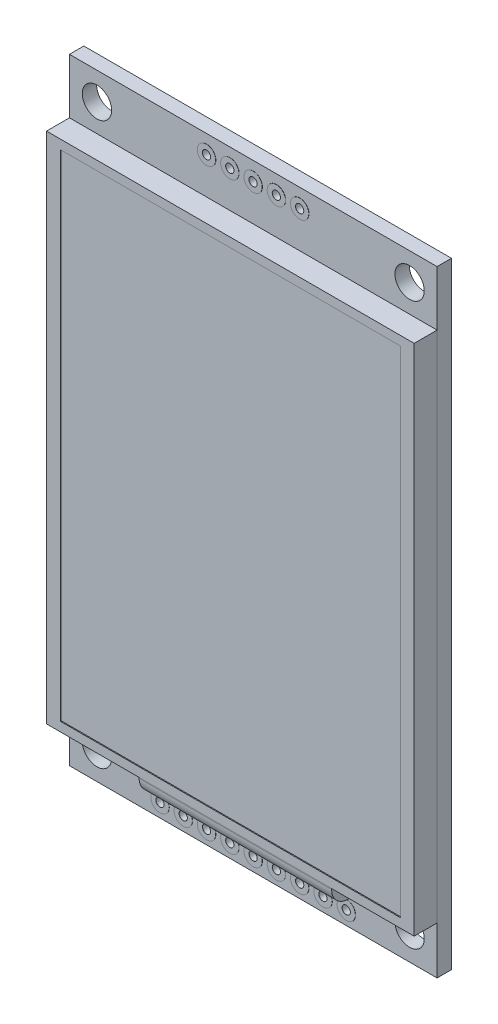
ISO-10303-21;
HEADER;
FILE_DESCRIPTION(('STEP AP214'),'2;1');
FILE_NAME('part.step','',(''),(''),'','','');
FILE_SCHEMA(('AUTOMOTIVE_DESIGN { 1 0 10303 214 1 1 1 1 }'));
ENDSEC;
DATA;
#1=APPLICATION_CONTEXT('core data for automotive mechanical design processes');
#2=APPLICATION_PROTOCOL_DEFINITION('international standard','automotive_design',2000,#1);
#3=PRODUCT_CONTEXT('',#1,'mechanical');
#4=PRODUCT('Part','Part','',(#3));
#5=PRODUCT_RELATED_PRODUCT_CATEGORY('part','',(#4));
#6=PRODUCT_DEFINITION_FORMATION('','',#4);
#7=PRODUCT_DEFINITION_CONTEXT('part definition',#1,'design');
#8=PRODUCT_DEFINITION('design','',#6,#7);
#9=PRODUCT_DEFINITION_SHAPE('','',#8);
#10=(LENGTH_UNIT() NAMED_UNIT(*) SI_UNIT(.MILLI.,.METRE.));
#11=(NAMED_UNIT(*) PLANE_ANGLE_UNIT() SI_UNIT($,.RADIAN.));
#12=(NAMED_UNIT(*) SI_UNIT($,.STERADIAN.) SOLID_ANGLE_UNIT());
#13=UNCERTAINTY_MEASURE_WITH_UNIT(LENGTH_MEASURE(1.E-05),#10,'distance_accuracy_value','');
#14=(GEOMETRIC_REPRESENTATION_CONTEXT(3) GLOBAL_UNCERTAINTY_ASSIGNED_CONTEXT((#13)) GLOBAL_UNIT_ASSIGNED_CONTEXT((#10,
#11,#12)) REPRESENTATION_CONTEXT('',''));
#15=CARTESIAN_POINT('',(0.,0.,0.));
#16=DIRECTION('',(0.,0.,1.));
#17=DIRECTION('',(1.,0.,0.));
#18=AXIS2_PLACEMENT_3D('',#15,#16,#17);
#19=CARTESIAN_POINT('',(25.13,65.2,0.));
#20=DIRECTION('',(0.,0.,-1.));
#21=DIRECTION('',(1.,0.,0.));
#22=AXIS2_PLACEMENT_3D('',#19,#20,#21);
#23=CYLINDRICAL_SURFACE('',#22,0.45);
#24=CARTESIAN_POINT('',(25.13,65.2,0.));
#25=DIRECTION('',(0.,0.,-1.));
#26=DIRECTION('',(1.,0.,0.));
#27=AXIS2_PLACEMENT_3D('',#24,#25,#26);
#28=CIRCLE('',#27,0.45);
#29=CARTESIAN_POINT('',(25.58,65.2,0.));
#30=VERTEX_POINT('',#29);
#31=EDGE_CURVE('E525',#30,#30,#28,.T.);
#32=ORIENTED_EDGE('',*,*,#31,.T.);
#33=DIRECTION('',(0.,0.,1.));
#34=VECTOR('',#33,1.);
#35=CARTESIAN_POINT('',(25.58,65.2,0.));
#36=LINE('',#35,#34);
#37=CARTESIAN_POINT('',(25.58,65.2,1.57));
#38=VERTEX_POINT('',#37);
#39=EDGE_CURVE('E11',#30,#38,#36,.T.);
#40=ORIENTED_EDGE('',*,*,#39,.T.);
#41=CARTESIAN_POINT('',(25.13,65.2,1.57));
#42=DIRECTION('',(0.,0.,-1.));
#43=DIRECTION('',(1.,0.,0.));
#44=AXIS2_PLACEMENT_3D('',#41,#42,#43);
#45=CIRCLE('',#44,0.45);
#46=EDGE_CURVE('E555',#38,#38,#45,.T.);
#47=ORIENTED_EDGE('',*,*,#46,.F.);
#48=ORIENTED_EDGE('',*,*,#39,.F.);
#49=EDGE_LOOP('',(#32,#40,#47,#48));
#50=FACE_BOUND('',#49,.T.);
#51=ADVANCED_FACE('F17',(#50),#23,.F.);
#52=CARTESIAN_POINT('',(22.59,65.2,0.));
#53=DIRECTION('',(0.,0.,-1.));
#54=DIRECTION('',(1.,0.,0.));
#55=AXIS2_PLACEMENT_3D('',#52,#53,#54);
#56=CYLINDRICAL_SURFACE('',#55,0.45);
#57=CARTESIAN_POINT('',(22.59,65.2,0.));
#58=DIRECTION('',(0.,0.,-1.));
#59=DIRECTION('',(1.,0.,0.));
#60=AXIS2_PLACEMENT_3D('',#57,#58,#59);
#61=CIRCLE('',#60,0.45);
#62=CARTESIAN_POINT('',(23.04,65.2,0.));
#63=VERTEX_POINT('',#62);
#64=EDGE_CURVE('E524',#63,#63,#61,.T.);
#65=ORIENTED_EDGE('',*,*,#64,.T.);
#66=DIRECTION('',(0.,0.,1.));
#67=VECTOR('',#66,1.);
#68=CARTESIAN_POINT('',(23.04,65.2,0.));
#69=LINE('',#68,#67);
#70=CARTESIAN_POINT('',(23.04,65.2,1.57));
#71=VERTEX_POINT('',#70);
#72=EDGE_CURVE('E25',#63,#71,#69,.T.);
#73=ORIENTED_EDGE('',*,*,#72,.T.);
#74=CARTESIAN_POINT('',(22.59,65.2,1.57));
#75=DIRECTION('',(0.,0.,-1.));
#76=DIRECTION('',(1.,0.,0.));
#77=AXIS2_PLACEMENT_3D('',#74,#75,#76);
#78=CIRCLE('',#77,0.45);
#79=EDGE_CURVE('E541',#71,#71,#78,.T.);
#80=ORIENTED_EDGE('',*,*,#79,.F.);
#81=ORIENTED_EDGE('',*,*,#72,.F.);
#82=EDGE_LOOP('',(#65,#73,#80,#81));
#83=FACE_BOUND('',#82,.T.);
#84=ADVANCED_FACE('F540',(#83),#56,.F.);
#85=CARTESIAN_POINT('',(20.05,65.2,0.));
#86=DIRECTION('',(0.,0.,-1.));
#87=DIRECTION('',(1.,0.,0.));
#88=AXIS2_PLACEMENT_3D('',#85,#86,#87);
#89=CYLINDRICAL_SURFACE('',#88,0.45);
#90=CARTESIAN_POINT('',(20.05,65.2,0.));
#91=DIRECTION('',(0.,0.,-1.));
#92=DIRECTION('',(1.,0.,0.));
#93=AXIS2_PLACEMENT_3D('',#90,#91,#92);
#94=CIRCLE('',#93,0.45);
#95=CARTESIAN_POINT('',(20.5,65.2,0.));
#96=VERTEX_POINT('',#95);
#97=EDGE_CURVE('E520',#96,#96,#94,.T.);
#98=ORIENTED_EDGE('',*,*,#97,.T.);
#99=DIRECTION('',(0.,0.,1.));
#100=VECTOR('',#99,1.);
#101=CARTESIAN_POINT('',(20.5,65.2,0.));
#102=LINE('',#101,#100);
#103=CARTESIAN_POINT('',(20.5,65.2,1.57));
#104=VERTEX_POINT('',#103);
#105=EDGE_CURVE('E535',#96,#104,#102,.T.);
#106=ORIENTED_EDGE('',*,*,#105,.T.);
#107=CARTESIAN_POINT('',(20.05,65.2,1.57));
#108=DIRECTION('',(0.,0.,-1.));
#109=DIRECTION('',(1.,0.,0.));
#110=AXIS2_PLACEMENT_3D('',#107,#108,#109);
#111=CIRCLE('',#110,0.45);
#112=EDGE_CURVE('E558',#104,#104,#111,.T.);
#113=ORIENTED_EDGE('',*,*,#112,.F.);
#114=ORIENTED_EDGE('',*,*,#105,.F.);
#115=EDGE_LOOP('',(#98,#106,#113,#114));
#116=FACE_BOUND('',#115,.T.);
#117=ADVANCED_FACE('F1948',(#116),#89,.F.);
#118=CARTESIAN_POINT('',(17.51,65.2,0.));
#119=DIRECTION('',(0.,0.,-1.));
#120=DIRECTION('',(1.,0.,0.));
#121=AXIS2_PLACEMENT_3D('',#118,#119,#120);
#122=CYLINDRICAL_SURFACE('',#121,0.45);
#123=CARTESIAN_POINT('',(17.51,65.2,0.));
#124=DIRECTION('',(0.,0.,-1.));
#125=DIRECTION('',(1.,0.,0.));
#126=AXIS2_PLACEMENT_3D('',#123,#124,#125);
#127=CIRCLE('',#126,0.45);
#128=CARTESIAN_POINT('',(17.96,65.2,0.));
#129=VERTEX_POINT('',#128);
#130=EDGE_CURVE('E519',#129,#129,#127,.T.);
#131=ORIENTED_EDGE('',*,*,#130,.T.);
#132=DIRECTION('',(0.,0.,1.));
#133=VECTOR('',#132,1.);
#134=CARTESIAN_POINT('',(17.96,65.2,0.));
#135=LINE('',#134,#133);
#136=CARTESIAN_POINT('',(17.96,65.2,1.57));
#137=VERTEX_POINT('',#136);
#138=EDGE_CURVE('E532',#129,#137,#135,.T.);
#139=ORIENTED_EDGE('',*,*,#138,.T.);
#140=CARTESIAN_POINT('',(17.51,65.2,1.57));
#141=DIRECTION('',(0.,0.,-1.));
#142=DIRECTION('',(1.,0.,0.));
#143=AXIS2_PLACEMENT_3D('',#140,#141,#142);
#144=CIRCLE('',#143,0.45);
#145=EDGE_CURVE('E1219',#137,#137,#144,.T.);
#146=ORIENTED_EDGE('',*,*,#145,.F.);
#147=ORIENTED_EDGE('',*,*,#138,.F.);
#148=EDGE_LOOP('',(#131,#139,#146,#147));
#149=FACE_BOUND('',#148,.T.);
#150=ADVANCED_FACE('F2694',(#149),#122,.F.);
#151=CARTESIAN_POINT('',(14.97,65.2,0.));
#152=DIRECTION('',(0.,0.,-1.));
#153=DIRECTION('',(1.,0.,0.));
#154=AXIS2_PLACEMENT_3D('',#151,#152,#153);
#155=CYLINDRICAL_SURFACE('',#154,0.45);
#156=CARTESIAN_POINT('',(14.97,65.2,0.));
#157=DIRECTION('',(0.,0.,-1.));
#158=DIRECTION('',(1.,0.,0.));
#159=AXIS2_PLACEMENT_3D('',#156,#157,#158);
#160=CIRCLE('',#159,0.45);
#161=CARTESIAN_POINT('',(15.42,65.2,0.));
#162=VERTEX_POINT('',#161);
#163=EDGE_CURVE('E515',#162,#162,#160,.T.);
#164=ORIENTED_EDGE('',*,*,#163,.T.);
#165=DIRECTION('',(0.,0.,1.));
#166=VECTOR('',#165,1.);
#167=CARTESIAN_POINT('',(15.42,65.2,0.));
#168=LINE('',#167,#166);
#169=CARTESIAN_POINT('',(15.42,65.2,1.57));
#170=VERTEX_POINT('',#169);
#171=EDGE_CURVE('E528',#162,#170,#168,.T.);
#172=ORIENTED_EDGE('',*,*,#171,.T.);
#173=CARTESIAN_POINT('',(14.97,65.2,1.57));
#174=DIRECTION('',(0.,0.,-1.));
#175=DIRECTION('',(1.,0.,0.));
#176=AXIS2_PLACEMENT_3D('',#173,#174,#175);
#177=CIRCLE('',#176,0.45);
#178=EDGE_CURVE('E1215',#170,#170,#177,.T.);
#179=ORIENTED_EDGE('',*,*,#178,.F.);
#180=ORIENTED_EDGE('',*,*,#171,.F.);
#181=EDGE_LOOP('',(#164,#172,#179,#180));
#182=FACE_BOUND('',#181,.T.);
#183=ADVANCED_FACE('F1956',(#182),#155,.F.);
#184=CARTESIAN_POINT('',(20.05,33.6,0.));
#185=DIRECTION('',(0.,0.,1.));
#186=DIRECTION('',(1.,0.,0.));
#187=AXIS2_PLACEMENT_3D('',#184,#185,#186);
#188=PLANE('',#187);
#189=ORIENTED_EDGE('',*,*,#31,.F.);
#190=EDGE_LOOP('',(#189));
#191=FACE_BOUND('',#190,.T.);
#192=CARTESIAN_POINT('',(25.13,65.2,0.));
#193=DIRECTION('',(0.,0.,-1.));
#194=DIRECTION('',(1.,0.,0.));
#195=AXIS2_PLACEMENT_3D('',#192,#193,#194);
#196=CIRCLE('',#195,0.451);
#197=CARTESIAN_POINT('',(25.581,65.2,0.));
#198=VERTEX_POINT('',#197);
#199=EDGE_CURVE('E833',#198,#198,#196,.T.);
#200=ORIENTED_EDGE('',*,*,#199,.T.);
#201=EDGE_LOOP('',(#200));
#202=FACE_BOUND('',#201,.T.);
#203=ADVANCED_FACE('F1952',(#191,#202),#188,.F.);
#204=CARTESIAN_POINT('',(20.05,33.6,0.));
#205=DIRECTION('',(0.,0.,1.));
#206=DIRECTION('',(1.,0.,0.));
#207=AXIS2_PLACEMENT_3D('',#204,#205,#206);
#208=PLANE('',#207);
#209=ORIENTED_EDGE('',*,*,#64,.F.);
#210=EDGE_LOOP('',(#209));
#211=FACE_BOUND('',#210,.T.);
#212=CARTESIAN_POINT('',(22.59,65.2,0.));
#213=DIRECTION('',(0.,0.,-1.));
#214=DIRECTION('',(1.,0.,0.));
#215=AXIS2_PLACEMENT_3D('',#212,#213,#214);
#216=CIRCLE('',#215,0.451);
#217=CARTESIAN_POINT('',(23.041,65.2,0.));
#218=VERTEX_POINT('',#217);
#219=EDGE_CURVE('E1208',#218,#218,#216,.T.);
#220=ORIENTED_EDGE('',*,*,#219,.T.);
#221=EDGE_LOOP('',(#220));
#222=FACE_BOUND('',#221,.T.);
#223=ADVANCED_FACE('F1955',(#211,#222),#208,.F.);
#224=CARTESIAN_POINT('',(20.05,33.6,0.));
#225=DIRECTION('',(0.,0.,1.));
#226=DIRECTION('',(1.,0.,0.));
#227=AXIS2_PLACEMENT_3D('',#224,#225,#226);
#228=PLANE('',#227);
#229=ORIENTED_EDGE('',*,*,#97,.F.);
#230=EDGE_LOOP('',(#229));
#231=FACE_BOUND('',#230,.T.);
#232=CARTESIAN_POINT('',(20.05,65.2,0.));
#233=DIRECTION('',(0.,0.,-1.));
#234=DIRECTION('',(1.,0.,0.));
#235=AXIS2_PLACEMENT_3D('',#232,#233,#234);
#236=CIRCLE('',#235,0.451);
#237=CARTESIAN_POINT('',(20.501,65.2,0.));
#238=VERTEX_POINT('',#237);
#239=EDGE_CURVE('E1203',#238,#238,#236,.T.);
#240=ORIENTED_EDGE('',*,*,#239,.T.);
#241=EDGE_LOOP('',(#240));
#242=FACE_BOUND('',#241,.T.);
#243=ADVANCED_FACE('F2684',(#231,#242),#228,.F.);
#244=CARTESIAN_POINT('',(20.05,33.6,0.));
#245=DIRECTION('',(0.,0.,1.));
#246=DIRECTION('',(1.,0.,0.));
#247=AXIS2_PLACEMENT_3D('',#244,#245,#246);
#248=PLANE('',#247);
#249=ORIENTED_EDGE('',*,*,#130,.F.);
#250=EDGE_LOOP('',(#249));
#251=FACE_BOUND('',#250,.T.);
#252=CARTESIAN_POINT('',(17.51,65.2,0.));
#253=DIRECTION('',(0.,0.,-1.));
#254=DIRECTION('',(1.,0.,0.));
#255=AXIS2_PLACEMENT_3D('',#252,#253,#254);
#256=CIRCLE('',#255,0.451);
#257=CARTESIAN_POINT('',(17.961,65.2,0.));
#258=VERTEX_POINT('',#257);
#259=EDGE_CURVE('E1196',#258,#258,#256,.T.);
#260=ORIENTED_EDGE('',*,*,#259,.T.);
#261=EDGE_LOOP('',(#260));
#262=FACE_BOUND('',#261,.T.);
#263=ADVANCED_FACE('F2680',(#251,#262),#248,.F.);
#264=CARTESIAN_POINT('',(20.05,33.6,0.));
#265=DIRECTION('',(0.,0.,1.));
#266=DIRECTION('',(1.,0.,0.));
#267=AXIS2_PLACEMENT_3D('',#264,#265,#266);
#268=PLANE('',#267);
#269=ORIENTED_EDGE('',*,*,#163,.F.);
#270=EDGE_LOOP('',(#269));
#271=FACE_BOUND('',#270,.T.);
#272=CARTESIAN_POINT('',(14.97,65.2,0.));
#273=DIRECTION('',(0.,0.,-1.));
#274=DIRECTION('',(1.,0.,0.));
#275=AXIS2_PLACEMENT_3D('',#272,#273,#274);
#276=CIRCLE('',#275,0.451);
#277=CARTESIAN_POINT('',(15.421,65.2,0.));
#278=VERTEX_POINT('',#277);
#279=EDGE_CURVE('E1189',#278,#278,#276,.T.);
#280=ORIENTED_EDGE('',*,*,#279,.T.);
#281=EDGE_LOOP('',(#280));
#282=FACE_BOUND('',#281,.T.);
#283=ADVANCED_FACE('F2676',(#271,#282),#268,.F.);
#284=CARTESIAN_POINT('',(11.5,53.15,-0.1));
#285=DIRECTION('',(0.,1.,0.));
#286=DIRECTION('',(1.,0.,0.));
#287=AXIS2_PLACEMENT_3D('',#284,#285,#286);
#288=PLANE('',#287);
#289=DIRECTION('',(1.,0.,0.));
#290=VECTOR('',#289,1.);
#291=CARTESIAN_POINT('',(11.5,53.15,-3.45));
#292=LINE('',#291,#290);
#293=CARTESIAN_POINT('',(13.,53.15,-3.45));
#294=VERTEX_POINT('',#293);
#295=CARTESIAN_POINT('',(18.9,53.15,-3.45));
#296=VERTEX_POINT('',#295);
#297=EDGE_CURVE('E1142',#294,#296,#292,.T.);
#298=ORIENTED_EDGE('',*,*,#297,.T.);
#299=DIRECTION('',(0.,0.,-1.));
#300=VECTOR('',#299,1.);
#301=CARTESIAN_POINT('',(18.9,53.15,-0.1));
#302=LINE('',#301,#300);
#303=CARTESIAN_POINT('',(18.9,53.15,-0.1));
#304=VERTEX_POINT('',#303);
#305=EDGE_CURVE('E490',#304,#296,#302,.T.);
#306=ORIENTED_EDGE('',*,*,#305,.F.);
#307=DIRECTION('',(1.,0.,0.));
#308=VECTOR('',#307,1.);
#309=CARTESIAN_POINT('',(11.5,53.15,-0.1));
#310=LINE('',#309,#308);
#311=CARTESIAN_POINT('',(13.,53.15,-0.1));
#312=VERTEX_POINT('',#311);
#313=EDGE_CURVE('E504',#312,#304,#310,.T.);
#314=ORIENTED_EDGE('',*,*,#313,.F.);
#315=DIRECTION('',(0.,0.,-1.));
#316=VECTOR('',#315,1.);
#317=CARTESIAN_POINT('',(13.,53.15,-0.1));
#318=LINE('',#317,#316);
#319=EDGE_CURVE('E1179',#312,#294,#318,.T.);
#320=ORIENTED_EDGE('',*,*,#319,.T.);
#321=EDGE_LOOP('',(#298,#306,#314,#320));
#322=FACE_BOUND('',#321,.T.);
#323=ADVANCED_FACE('F2673',(#322),#288,.F.);
#324=CARTESIAN_POINT('',(18.9,41.225,-1.775));
#325=DIRECTION('',(-1.,0.,0.));
#326=DIRECTION('',(0.,0.,1.));
#327=AXIS2_PLACEMENT_3D('',#324,#325,#326);
#328=PLANE('',#327);
#329=DIRECTION('',(0.,-1.,0.));
#330=VECTOR('',#329,1.);
#331=CARTESIAN_POINT('',(18.9,53.15,-3.45));
#332=LINE('',#331,#330);
#333=CARTESIAN_POINT('',(18.9,29.3,-3.45));
#334=VERTEX_POINT('',#333);
#335=EDGE_CURVE('E486',#296,#334,#332,.T.);
#336=ORIENTED_EDGE('',*,*,#335,.T.);
#337=DIRECTION('',(0.,0.,1.));
#338=VECTOR('',#337,1.);
#339=CARTESIAN_POINT('',(18.9,29.3,-3.45));
#340=LINE('',#339,#338);
#341=CARTESIAN_POINT('',(18.9,29.3,-0.1));
#342=VERTEX_POINT('',#341);
#343=EDGE_CURVE('E479',#334,#342,#340,.T.);
#344=ORIENTED_EDGE('',*,*,#343,.T.);
#345=DIRECTION('',(0.,1.,0.));
#346=VECTOR('',#345,1.);
#347=CARTESIAN_POINT('',(18.9,29.3,-0.1));
#348=LINE('',#347,#346);
#349=EDGE_CURVE('E483',#342,#304,#348,.T.);
#350=ORIENTED_EDGE('',*,*,#349,.T.);
#351=ORIENTED_EDGE('',*,*,#305,.T.);
#352=EDGE_LOOP('',(#336,#344,#350,#351));
#353=FACE_BOUND('',#352,.T.);
#354=ADVANCED_FACE('F481',(#353),#328,.T.);
#355=CARTESIAN_POINT('',(12.,53.9,-0.1));
#356=DIRECTION('',(0.,0.,-1.));
#357=DIRECTION('',(0.,-1.,0.));
#358=AXIS2_PLACEMENT_3D('',#355,#356,#357);
#359=PLANE('',#358);
#360=DIRECTION('',(0.6,-0.8,0.));
#361=VECTOR('',#360,1.);
#362=CARTESIAN_POINT('',(11.5,55.15,-0.1));
#363=LINE('',#362,#361);
#364=CARTESIAN_POINT('',(11.5,55.15,-0.1));
#365=VERTEX_POINT('',#364);
#366=EDGE_CURVE('E1182',#365,#312,#363,.T.);
#367=ORIENTED_EDGE('',*,*,#366,.T.);
#368=DIRECTION('',(1.,0.,0.));
#369=VECTOR('',#368,1.);
#370=CARTESIAN_POINT('',(11.5,53.15,-0.1));
#371=LINE('',#370,#369);
#372=CARTESIAN_POINT('',(11.5,53.15,-0.1));
#373=VERTEX_POINT('',#372);
#374=EDGE_CURVE('E509',#373,#312,#371,.T.);
#375=ORIENTED_EDGE('',*,*,#374,.F.);
#376=DIRECTION('',(0.,1.,0.));
#377=VECTOR('',#376,1.);
#378=CARTESIAN_POINT('',(11.5,53.15,-0.1));
#379=LINE('',#378,#377);
#380=EDGE_CURVE('E1165',#373,#365,#379,.T.);
#381=ORIENTED_EDGE('',*,*,#380,.T.);
#382=EDGE_LOOP('',(#367,#375,#381));
#383=FACE_BOUND('',#382,.T.);
#384=ADVANCED_FACE('F2430',(#383),#359,.T.);
#385=CARTESIAN_POINT('',(11.5,29.3,-3.45));
#386=DIRECTION('',(0.,-1.,0.));
#387=DIRECTION('',(0.,0.,-1.));
#388=AXIS2_PLACEMENT_3D('',#385,#386,#387);
#389=PLANE('',#388);
#390=DIRECTION('',(0.,0.,1.));
#391=VECTOR('',#390,1.);
#392=CARTESIAN_POINT('',(11.5,29.3,-3.45));
#393=LINE('',#392,#391);
#394=CARTESIAN_POINT('',(11.5,29.3,-3.45));
#395=VERTEX_POINT('',#394);
#396=CARTESIAN_POINT('',(11.5,29.3,-0.1));
#397=VERTEX_POINT('',#396);
#398=EDGE_CURVE('E496',#395,#397,#393,.T.);
#399=ORIENTED_EDGE('',*,*,#398,.T.);
#400=DIRECTION('',(1.,0.,0.));
#401=VECTOR('',#400,1.);
#402=CARTESIAN_POINT('',(11.5,29.3,-0.1));
#403=LINE('',#402,#401);
#404=EDGE_CURVE('E491',#397,#342,#403,.T.);
#405=ORIENTED_EDGE('',*,*,#404,.T.);
#406=ORIENTED_EDGE('',*,*,#343,.F.);
#407=DIRECTION('',(1.,0.,0.));
#408=VECTOR('',#407,1.);
#409=CARTESIAN_POINT('',(11.5,29.3,-3.45));
#410=LINE('',#409,#408);
#411=EDGE_CURVE('E1173',#395,#334,#410,.T.);
#412=ORIENTED_EDGE('',*,*,#411,.F.);
#413=EDGE_LOOP('',(#399,#405,#406,#412));
#414=FACE_BOUND('',#413,.T.);
#415=ADVANCED_FACE('F494',(#414),#389,.F.);
#416=CARTESIAN_POINT('',(11.5,29.3,-0.1));
#417=DIRECTION('',(0.,0.,1.));
#418=DIRECTION('',(1.,0.,0.));
#419=AXIS2_PLACEMENT_3D('',#416,#417,#418);
#420=PLANE('',#419);
#421=DIRECTION('',(0.,1.,0.));
#422=VECTOR('',#421,1.);
#423=CARTESIAN_POINT('',(11.5,29.3,-0.1));
#424=LINE('',#423,#422);
#425=EDGE_CURVE('E1170',#397,#373,#424,.T.);
#426=ORIENTED_EDGE('',*,*,#425,.T.);
#427=ORIENTED_EDGE('',*,*,#374,.T.);
#428=ORIENTED_EDGE('',*,*,#313,.T.);
#429=ORIENTED_EDGE('',*,*,#349,.F.);
#430=ORIENTED_EDGE('',*,*,#404,.F.);
#431=EDGE_LOOP('',(#426,#427,#428,#429,#430));
#432=FACE_BOUND('',#431,.T.);
#433=ADVANCED_FACE('F502',(#432),#420,.F.);
#434=CARTESIAN_POINT('',(20.05,33.6,0.));
#435=DIRECTION('',(0.,0.,1.));
#436=DIRECTION('',(1.,0.,0.));
#437=AXIS2_PLACEMENT_3D('',#434,#435,#436);
#438=PLANE('',#437);
#439=CARTESIAN_POINT('',(30.21,1.5,0.));
#440=DIRECTION('',(0.,0.,-1.));
#441=DIRECTION('',(1.,0.,0.));
#442=AXIS2_PLACEMENT_3D('',#439,#440,#441);
#443=CIRCLE('',#442,0.45);
#444=CARTESIAN_POINT('',(30.66,1.5,0.));
#445=VERTEX_POINT('',#444);
#446=EDGE_CURVE('E949',#445,#445,#443,.T.);
#447=ORIENTED_EDGE('',*,*,#446,.F.);
#448=EDGE_LOOP('',(#447));
#449=FACE_BOUND('',#448,.T.);
#450=CARTESIAN_POINT('',(30.21,1.5,0.));
#451=DIRECTION('',(0.,0.,-1.));
#452=DIRECTION('',(1.,0.,0.));
#453=AXIS2_PLACEMENT_3D('',#450,#451,#452);
#454=CIRCLE('',#453,0.451);
#455=CARTESIAN_POINT('',(30.661,1.5,0.));
#456=VERTEX_POINT('',#455);
#457=EDGE_CURVE('E1145',#456,#456,#454,.T.);
#458=ORIENTED_EDGE('',*,*,#457,.T.);
#459=EDGE_LOOP('',(#458));
#460=FACE_BOUND('',#459,.T.);
#461=ADVANCED_FACE('F2661',(#449,#460),#438,.F.);
#462=CARTESIAN_POINT('',(20.05,33.6,0.));
#463=DIRECTION('',(0.,0.,1.));
#464=DIRECTION('',(1.,0.,0.));
#465=AXIS2_PLACEMENT_3D('',#462,#463,#464);
#466=PLANE('',#465);
#467=CARTESIAN_POINT('',(27.67,1.5,0.));
#468=DIRECTION('',(0.,0.,-1.));
#469=DIRECTION('',(1.,0.,0.));
#470=AXIS2_PLACEMENT_3D('',#467,#468,#469);
#471=CIRCLE('',#470,0.45);
#472=CARTESIAN_POINT('',(28.12,1.5,0.));
#473=VERTEX_POINT('',#472);
#474=EDGE_CURVE('E950',#473,#473,#471,.T.);
#475=ORIENTED_EDGE('',*,*,#474,.F.);
#476=EDGE_LOOP('',(#475));
#477=FACE_BOUND('',#476,.T.);
#478=CARTESIAN_POINT('',(27.67,1.5,0.));
#479=DIRECTION('',(0.,0.,-1.));
#480=DIRECTION('',(1.,0.,0.));
#481=AXIS2_PLACEMENT_3D('',#478,#479,#480);
#482=CIRCLE('',#481,0.451);
#483=CARTESIAN_POINT('',(28.121,1.5,0.));
#484=VERTEX_POINT('',#483);
#485=EDGE_CURVE('E1133',#484,#484,#482,.T.);
#486=ORIENTED_EDGE('',*,*,#485,.T.);
#487=EDGE_LOOP('',(#486));
#488=FACE_BOUND('',#487,.T.);
#489=ADVANCED_FACE('F2653',(#477,#488),#466,.F.);
#490=CARTESIAN_POINT('',(20.05,33.6,0.));
#491=DIRECTION('',(0.,0.,1.));
#492=DIRECTION('',(1.,0.,0.));
#493=AXIS2_PLACEMENT_3D('',#490,#491,#492);
#494=PLANE('',#493);
#495=CARTESIAN_POINT('',(25.13,1.5,0.));
#496=DIRECTION('',(0.,0.,-1.));
#497=DIRECTION('',(1.,0.,0.));
#498=AXIS2_PLACEMENT_3D('',#495,#496,#497);
#499=CIRCLE('',#498,0.45);
#500=CARTESIAN_POINT('',(25.58,1.5,0.));
#501=VERTEX_POINT('',#500);
#502=EDGE_CURVE('E1248',#501,#501,#499,.T.);
#503=ORIENTED_EDGE('',*,*,#502,.F.);
#504=EDGE_LOOP('',(#503));
#505=FACE_BOUND('',#504,.T.);
#506=CARTESIAN_POINT('',(25.13,1.5,0.));
#507=DIRECTION('',(0.,0.,-1.));
#508=DIRECTION('',(1.,0.,0.));
#509=AXIS2_PLACEMENT_3D('',#506,#507,#508);
#510=CIRCLE('',#509,0.451);
#511=CARTESIAN_POINT('',(25.581,1.5,0.));
#512=VERTEX_POINT('',#511);
#513=EDGE_CURVE('E1127',#512,#512,#510,.T.);
#514=ORIENTED_EDGE('',*,*,#513,.T.);
#515=EDGE_LOOP('',(#514));
#516=FACE_BOUND('',#515,.T.);
#517=ADVANCED_FACE('F2644',(#505,#516),#494,.F.);
#518=CARTESIAN_POINT('',(20.05,33.6,0.));
#519=DIRECTION('',(0.,0.,1.));
#520=DIRECTION('',(1.,0.,0.));
#521=AXIS2_PLACEMENT_3D('',#518,#519,#520);
#522=PLANE('',#521);
#523=CARTESIAN_POINT('',(22.59,1.5,0.));
#524=DIRECTION('',(0.,0.,-1.));
#525=DIRECTION('',(1.,0.,0.));
#526=AXIS2_PLACEMENT_3D('',#523,#524,#525);
#527=CIRCLE('',#526,0.45);
#528=CARTESIAN_POINT('',(23.04,1.5,0.));
#529=VERTEX_POINT('',#528);
#530=EDGE_CURVE('E2068',#529,#529,#527,.T.);
#531=ORIENTED_EDGE('',*,*,#530,.F.);
#532=EDGE_LOOP('',(#531));
#533=FACE_BOUND('',#532,.T.);
#534=CARTESIAN_POINT('',(22.59,1.5,0.));
#535=DIRECTION('',(0.,0.,-1.));
#536=DIRECTION('',(1.,0.,0.));
#537=AXIS2_PLACEMENT_3D('',#534,#535,#536);
#538=CIRCLE('',#537,0.451);
#539=CARTESIAN_POINT('',(23.041,1.5,0.));
#540=VERTEX_POINT('',#539);
#541=EDGE_CURVE('E1120',#540,#540,#538,.T.);
#542=ORIENTED_EDGE('',*,*,#541,.T.);
#543=EDGE_LOOP('',(#542));
#544=FACE_BOUND('',#543,.T.);
#545=ADVANCED_FACE('F2641',(#533,#544),#522,.F.);
#546=CARTESIAN_POINT('',(20.05,33.6,0.));
#547=DIRECTION('',(0.,0.,1.));
#548=DIRECTION('',(1.,0.,0.));
#549=AXIS2_PLACEMENT_3D('',#546,#547,#548);
#550=PLANE('',#549);
#551=CARTESIAN_POINT('',(20.05,1.5,0.));
#552=DIRECTION('',(0.,0.,-1.));
#553=DIRECTION('',(1.,0.,0.));
#554=AXIS2_PLACEMENT_3D('',#551,#552,#553);
#555=CIRCLE('',#554,0.45);
#556=CARTESIAN_POINT('',(20.5,1.5,0.));
#557=VERTEX_POINT('',#556);
#558=EDGE_CURVE('E1243',#557,#557,#555,.T.);
#559=ORIENTED_EDGE('',*,*,#558,.F.);
#560=EDGE_LOOP('',(#559));
#561=FACE_BOUND('',#560,.T.);
#562=CARTESIAN_POINT('',(20.05,1.5,0.));
#563=DIRECTION('',(0.,0.,-1.));
#564=DIRECTION('',(1.,0.,0.));
#565=AXIS2_PLACEMENT_3D('',#562,#563,#564);
#566=CIRCLE('',#565,0.451);
#567=CARTESIAN_POINT('',(20.501,1.5,0.));
#568=VERTEX_POINT('',#567);
#569=EDGE_CURVE('E1114',#568,#568,#566,.T.);
#570=ORIENTED_EDGE('',*,*,#569,.T.);
#571=EDGE_LOOP('',(#570));
#572=FACE_BOUND('',#571,.T.);
#573=ADVANCED_FACE('F2643',(#561,#572),#550,.F.);
#574=CARTESIAN_POINT('',(20.05,33.6,0.));
#575=DIRECTION('',(0.,0.,1.));
#576=DIRECTION('',(1.,0.,0.));
#577=AXIS2_PLACEMENT_3D('',#574,#575,#576);
#578=PLANE('',#577);
#579=CARTESIAN_POINT('',(17.51,1.5,0.));
#580=DIRECTION('',(0.,0.,-1.));
#581=DIRECTION('',(1.,0.,0.));
#582=AXIS2_PLACEMENT_3D('',#579,#580,#581);
#583=CIRCLE('',#582,0.45);
#584=CARTESIAN_POINT('',(17.96,1.5,0.));
#585=VERTEX_POINT('',#584);
#586=EDGE_CURVE('E1236',#585,#585,#583,.T.);
#587=ORIENTED_EDGE('',*,*,#586,.F.);
#588=EDGE_LOOP('',(#587));
#589=FACE_BOUND('',#588,.T.);
#590=CARTESIAN_POINT('',(17.51,1.5,0.));
#591=DIRECTION('',(0.,0.,-1.));
#592=DIRECTION('',(1.,0.,0.));
#593=AXIS2_PLACEMENT_3D('',#590,#591,#592);
#594=CIRCLE('',#593,0.451);
#595=CARTESIAN_POINT('',(17.961,1.5,0.));
#596=VERTEX_POINT('',#595);
#597=EDGE_CURVE('E917',#596,#596,#594,.T.);
#598=ORIENTED_EDGE('',*,*,#597,.T.);
#599=EDGE_LOOP('',(#598));
#600=FACE_BOUND('',#599,.T.);
#601=ADVANCED_FACE('F2151',(#589,#600),#578,.F.);
#602=CARTESIAN_POINT('',(20.05,33.6,0.));
#603=DIRECTION('',(0.,0.,1.));
#604=DIRECTION('',(1.,0.,0.));
#605=AXIS2_PLACEMENT_3D('',#602,#603,#604);
#606=PLANE('',#605);
#607=CARTESIAN_POINT('',(14.97,1.5,0.));
#608=DIRECTION('',(0.,0.,-1.));
#609=DIRECTION('',(1.,0.,0.));
#610=AXIS2_PLACEMENT_3D('',#607,#608,#609);
#611=CIRCLE('',#610,0.45);
#612=CARTESIAN_POINT('',(15.42,1.5,0.));
#613=VERTEX_POINT('',#612);
#614=EDGE_CURVE('E1231',#613,#613,#611,.T.);
#615=ORIENTED_EDGE('',*,*,#614,.F.);
#616=EDGE_LOOP('',(#615));
#617=FACE_BOUND('',#616,.T.);
#618=CARTESIAN_POINT('',(14.97,1.5,0.));
#619=DIRECTION('',(0.,0.,-1.));
#620=DIRECTION('',(1.,0.,0.));
#621=AXIS2_PLACEMENT_3D('',#618,#619,#620);
#622=CIRCLE('',#621,0.451);
#623=CARTESIAN_POINT('',(15.421,1.5,0.));
#624=VERTEX_POINT('',#623);
#625=EDGE_CURVE('E783',#624,#624,#622,.T.);
#626=ORIENTED_EDGE('',*,*,#625,.T.);
#627=EDGE_LOOP('',(#626));
#628=FACE_BOUND('',#627,.T.);
#629=ADVANCED_FACE('F2787',(#617,#628),#606,.F.);
#630=CARTESIAN_POINT('',(20.05,33.6,0.));
#631=DIRECTION('',(0.,0.,1.));
#632=DIRECTION('',(1.,0.,0.));
#633=AXIS2_PLACEMENT_3D('',#630,#631,#632);
#634=PLANE('',#633);
#635=CARTESIAN_POINT('',(12.43,1.5,0.));
#636=DIRECTION('',(0.,0.,-1.));
#637=DIRECTION('',(1.,0.,0.));
#638=AXIS2_PLACEMENT_3D('',#635,#636,#637);
#639=CIRCLE('',#638,0.45);
#640=CARTESIAN_POINT('',(12.88,1.5,0.));
#641=VERTEX_POINT('',#640);
#642=EDGE_CURVE('E1227',#641,#641,#639,.T.);
#643=ORIENTED_EDGE('',*,*,#642,.F.);
#644=EDGE_LOOP('',(#643));
#645=FACE_BOUND('',#644,.T.);
#646=CARTESIAN_POINT('',(12.43,1.5,0.));
#647=DIRECTION('',(0.,0.,-1.));
#648=DIRECTION('',(1.,0.,0.));
#649=AXIS2_PLACEMENT_3D('',#646,#647,#648);
#650=CIRCLE('',#649,0.451);
#651=CARTESIAN_POINT('',(12.881,1.5,0.));
#652=VERTEX_POINT('',#651);
#653=EDGE_CURVE('E1106',#652,#652,#650,.T.);
#654=ORIENTED_EDGE('',*,*,#653,.T.);
#655=EDGE_LOOP('',(#654));
#656=FACE_BOUND('',#655,.T.);
#657=ADVANCED_FACE('F2790',(#645,#656),#634,.F.);
#658=CARTESIAN_POINT('',(20.05,33.6,0.));
#659=DIRECTION('',(0.,0.,1.));
#660=DIRECTION('',(1.,0.,0.));
#661=AXIS2_PLACEMENT_3D('',#658,#659,#660);
#662=PLANE('',#661);
#663=CARTESIAN_POINT('',(9.89,1.5,0.));
#664=DIRECTION('',(0.,0.,-1.));
#665=DIRECTION('',(1.,0.,0.));
#666=AXIS2_PLACEMENT_3D('',#663,#664,#665);
#667=CIRCLE('',#666,0.45);
#668=CARTESIAN_POINT('',(10.34,1.5,0.));
#669=VERTEX_POINT('',#668);
#670=EDGE_CURVE('E1089',#669,#669,#667,.T.);
#671=ORIENTED_EDGE('',*,*,#670,.F.);
#672=EDGE_LOOP('',(#671));
#673=FACE_BOUND('',#672,.T.);
#674=CARTESIAN_POINT('',(9.89,1.5,0.));
#675=DIRECTION('',(0.,0.,-1.));
#676=DIRECTION('',(1.,0.,0.));
#677=AXIS2_PLACEMENT_3D('',#674,#675,#676);
#678=CIRCLE('',#677,0.451);
#679=CARTESIAN_POINT('',(10.341,1.5,0.));
#680=VERTEX_POINT('',#679);
#681=EDGE_CURVE('E1100',#680,#680,#678,.T.);
#682=ORIENTED_EDGE('',*,*,#681,.T.);
#683=EDGE_LOOP('',(#682));
#684=FACE_BOUND('',#683,.T.);
#685=ADVANCED_FACE('F2876',(#673,#684),#662,.F.);
#686=CARTESIAN_POINT('',(30.21,1.5,0.));
#687=DIRECTION('',(0.,0.,-1.));
#688=DIRECTION('',(1.,0.,0.));
#689=AXIS2_PLACEMENT_3D('',#686,#687,#688);
#690=CYLINDRICAL_SURFACE('',#689,0.45);
#691=ORIENTED_EDGE('',*,*,#446,.T.);
#692=DIRECTION('',(0.,0.,1.));
#693=VECTOR('',#692,1.);
#694=CARTESIAN_POINT('',(30.66,1.5,0.));
#695=LINE('',#694,#693);
#696=CARTESIAN_POINT('',(30.66,1.5,1.57));
#697=VERTEX_POINT('',#696);
#698=EDGE_CURVE('E1260',#445,#697,#695,.T.);
#699=ORIENTED_EDGE('',*,*,#698,.T.);
#700=CARTESIAN_POINT('',(30.21,1.5,1.57));
#701=DIRECTION('',(0.,0.,-1.));
#702=DIRECTION('',(1.,0.,0.));
#703=AXIS2_PLACEMENT_3D('',#700,#701,#702);
#704=CIRCLE('',#703,0.45);
#705=EDGE_CURVE('E1088',#697,#697,#704,.T.);
#706=ORIENTED_EDGE('',*,*,#705,.F.);
#707=ORIENTED_EDGE('',*,*,#698,.F.);
#708=EDGE_LOOP('',(#691,#699,#706,#707));
#709=FACE_BOUND('',#708,.T.);
#710=ADVANCED_FACE('F2873',(#709),#690,.F.);
#711=CARTESIAN_POINT('',(27.67,1.5,0.));
#712=DIRECTION('',(0.,0.,-1.));
#713=DIRECTION('',(1.,0.,0.));
#714=AXIS2_PLACEMENT_3D('',#711,#712,#713);
#715=CYLINDRICAL_SURFACE('',#714,0.45);
#716=ORIENTED_EDGE('',*,*,#474,.T.);
#717=DIRECTION('',(0.,0.,1.));
#718=VECTOR('',#717,1.);
#719=CARTESIAN_POINT('',(28.12,1.5,0.));
#720=LINE('',#719,#718);
#721=CARTESIAN_POINT('',(28.12,1.5,1.57));
#722=VERTEX_POINT('',#721);
#723=EDGE_CURVE('E946',#473,#722,#720,.T.);
#724=ORIENTED_EDGE('',*,*,#723,.T.);
#725=CARTESIAN_POINT('',(27.67,1.5,1.57));
#726=DIRECTION('',(0.,0.,-1.));
#727=DIRECTION('',(1.,0.,0.));
#728=AXIS2_PLACEMENT_3D('',#725,#726,#727);
#729=CIRCLE('',#728,0.45);
#730=EDGE_CURVE('E1084',#722,#722,#729,.T.);
#731=ORIENTED_EDGE('',*,*,#730,.F.);
#732=ORIENTED_EDGE('',*,*,#723,.F.);
#733=EDGE_LOOP('',(#716,#724,#731,#732));
#734=FACE_BOUND('',#733,.T.);
#735=ADVANCED_FACE('F2871',(#734),#715,.F.);
#736=CARTESIAN_POINT('',(25.13,1.5,0.));
#737=DIRECTION('',(0.,0.,-1.));
#738=DIRECTION('',(1.,0.,0.));
#739=AXIS2_PLACEMENT_3D('',#736,#737,#738);
#740=CYLINDRICAL_SURFACE('',#739,0.45);
#741=ORIENTED_EDGE('',*,*,#502,.T.);
#742=DIRECTION('',(0.,0.,1.));
#743=VECTOR('',#742,1.);
#744=CARTESIAN_POINT('',(25.58,1.5,0.));
#745=LINE('',#744,#743);
#746=CARTESIAN_POINT('',(25.58,1.5,1.57));
#747=VERTEX_POINT('',#746);
#748=EDGE_CURVE('E1252',#501,#747,#745,.T.);
#749=ORIENTED_EDGE('',*,*,#748,.T.);
#750=CARTESIAN_POINT('',(25.13,1.5,1.57));
#751=DIRECTION('',(0.,0.,-1.));
#752=DIRECTION('',(1.,0.,0.));
#753=AXIS2_PLACEMENT_3D('',#750,#751,#752);
#754=CIRCLE('',#753,0.45);
#755=EDGE_CURVE('E1080',#747,#747,#754,.T.);
#756=ORIENTED_EDGE('',*,*,#755,.F.);
#757=ORIENTED_EDGE('',*,*,#748,.F.);
#758=EDGE_LOOP('',(#741,#749,#756,#757));
#759=FACE_BOUND('',#758,.T.);
#760=ADVANCED_FACE('F2867',(#759),#740,.F.);
#761=CARTESIAN_POINT('',(22.59,1.5,0.));
#762=DIRECTION('',(0.,0.,-1.));
#763=DIRECTION('',(1.,0.,0.));
#764=AXIS2_PLACEMENT_3D('',#761,#762,#763);
#765=CYLINDRICAL_SURFACE('',#764,0.45);
#766=ORIENTED_EDGE('',*,*,#530,.T.);
#767=DIRECTION('',(0.,0.,1.));
#768=VECTOR('',#767,1.);
#769=CARTESIAN_POINT('',(23.04,1.5,0.));
#770=LINE('',#769,#768);
#771=CARTESIAN_POINT('',(23.04,1.5,1.57));
#772=VERTEX_POINT('',#771);
#773=EDGE_CURVE('E562',#529,#772,#770,.T.);
#774=ORIENTED_EDGE('',*,*,#773,.T.);
#775=CARTESIAN_POINT('',(22.59,1.5,1.57));
#776=DIRECTION('',(0.,0.,-1.));
#777=DIRECTION('',(1.,0.,0.));
#778=AXIS2_PLACEMENT_3D('',#775,#776,#777);
#779=CIRCLE('',#778,0.45);
#780=EDGE_CURVE('E1076',#772,#772,#779,.T.);
#781=ORIENTED_EDGE('',*,*,#780,.F.);
#782=ORIENTED_EDGE('',*,*,#773,.F.);
#783=EDGE_LOOP('',(#766,#774,#781,#782));
#784=FACE_BOUND('',#783,.T.);
#785=ADVANCED_FACE('F2834',(#784),#765,.F.);
#786=CARTESIAN_POINT('',(20.05,1.5,0.));
#787=DIRECTION('',(0.,0.,-1.));
#788=DIRECTION('',(1.,0.,0.));
#789=AXIS2_PLACEMENT_3D('',#786,#787,#788);
#790=CYLINDRICAL_SURFACE('',#789,0.45);
#791=ORIENTED_EDGE('',*,*,#558,.T.);
#792=DIRECTION('',(0.,0.,1.));
#793=VECTOR('',#792,1.);
#794=CARTESIAN_POINT('',(20.5,1.5,0.));
#795=LINE('',#794,#793);
#796=CARTESIAN_POINT('',(20.5,1.5,1.57));
#797=VERTEX_POINT('',#796);
#798=EDGE_CURVE('E1247',#557,#797,#795,.T.);
#799=ORIENTED_EDGE('',*,*,#798,.T.);
#800=CARTESIAN_POINT('',(20.05,1.5,1.57));
#801=DIRECTION('',(0.,0.,-1.));
#802=DIRECTION('',(1.,0.,0.));
#803=AXIS2_PLACEMENT_3D('',#800,#801,#802);
#804=CIRCLE('',#803,0.45);
#805=EDGE_CURVE('E1072',#797,#797,#804,.T.);
#806=ORIENTED_EDGE('',*,*,#805,.F.);
#807=ORIENTED_EDGE('',*,*,#798,.F.);
#808=EDGE_LOOP('',(#791,#799,#806,#807));
#809=FACE_BOUND('',#808,.T.);
#810=ADVANCED_FACE('F2830',(#809),#790,.F.);
#811=CARTESIAN_POINT('',(17.51,1.5,0.));
#812=DIRECTION('',(0.,0.,-1.));
#813=DIRECTION('',(1.,0.,0.));
#814=AXIS2_PLACEMENT_3D('',#811,#812,#813);
#815=CYLINDRICAL_SURFACE('',#814,0.45);
#816=ORIENTED_EDGE('',*,*,#586,.T.);
#817=DIRECTION('',(0.,0.,1.));
#818=VECTOR('',#817,1.);
#819=CARTESIAN_POINT('',(17.96,1.5,0.));
#820=LINE('',#819,#818);
#821=CARTESIAN_POINT('',(17.96,1.5,1.57));
#822=VERTEX_POINT('',#821);
#823=EDGE_CURVE('E1240',#585,#822,#820,.T.);
#824=ORIENTED_EDGE('',*,*,#823,.T.);
#825=CARTESIAN_POINT('',(17.51,1.5,1.57));
#826=DIRECTION('',(0.,0.,-1.));
#827=DIRECTION('',(1.,0.,0.));
#828=AXIS2_PLACEMENT_3D('',#825,#826,#827);
#829=CIRCLE('',#828,0.45);
#830=EDGE_CURVE('E1068',#822,#822,#829,.T.);
#831=ORIENTED_EDGE('',*,*,#830,.F.);
#832=ORIENTED_EDGE('',*,*,#823,.F.);
#833=EDGE_LOOP('',(#816,#824,#831,#832));
#834=FACE_BOUND('',#833,.T.);
#835=ADVANCED_FACE('F2833',(#834),#815,.F.);
#836=CARTESIAN_POINT('',(14.97,1.5,0.));
#837=DIRECTION('',(0.,0.,-1.));
#838=DIRECTION('',(1.,0.,0.));
#839=AXIS2_PLACEMENT_3D('',#836,#837,#838);
#840=CYLINDRICAL_SURFACE('',#839,0.45);
#841=ORIENTED_EDGE('',*,*,#614,.T.);
#842=DIRECTION('',(0.,0.,1.));
#843=VECTOR('',#842,1.);
#844=CARTESIAN_POINT('',(15.42,1.5,0.));
#845=LINE('',#844,#843);
#846=CARTESIAN_POINT('',(15.42,1.5,1.57));
#847=VERTEX_POINT('',#846);
#848=EDGE_CURVE('E1235',#613,#847,#845,.T.);
#849=ORIENTED_EDGE('',*,*,#848,.T.);
#850=CARTESIAN_POINT('',(14.97,1.5,1.57));
#851=DIRECTION('',(0.,0.,-1.));
#852=DIRECTION('',(1.,0.,0.));
#853=AXIS2_PLACEMENT_3D('',#850,#851,#852);
#854=CIRCLE('',#853,0.45);
#855=EDGE_CURVE('E1064',#847,#847,#854,.T.);
#856=ORIENTED_EDGE('',*,*,#855,.F.);
#857=ORIENTED_EDGE('',*,*,#848,.F.);
#858=EDGE_LOOP('',(#841,#849,#856,#857));
#859=FACE_BOUND('',#858,.T.);
#860=ADVANCED_FACE('F2847',(#859),#840,.F.);
#861=CARTESIAN_POINT('',(12.43,1.5,0.));
#862=DIRECTION('',(0.,0.,-1.));
#863=DIRECTION('',(1.,0.,0.));
#864=AXIS2_PLACEMENT_3D('',#861,#862,#863);
#865=CYLINDRICAL_SURFACE('',#864,0.45);
#866=ORIENTED_EDGE('',*,*,#642,.T.);
#867=DIRECTION('',(0.,0.,1.));
#868=VECTOR('',#867,1.);
#869=CARTESIAN_POINT('',(12.88,1.5,0.));
#870=LINE('',#869,#868);
#871=CARTESIAN_POINT('',(12.88,1.5,1.57));
#872=VERTEX_POINT('',#871);
#873=EDGE_CURVE('E1228',#641,#872,#870,.T.);
#874=ORIENTED_EDGE('',*,*,#873,.T.);
#875=CARTESIAN_POINT('',(12.43,1.5,1.57));
#876=DIRECTION('',(0.,0.,-1.));
#877=DIRECTION('',(1.,0.,0.));
#878=AXIS2_PLACEMENT_3D('',#875,#876,#877);
#879=CIRCLE('',#878,0.45);
#880=EDGE_CURVE('E1058',#872,#872,#879,.T.);
#881=ORIENTED_EDGE('',*,*,#880,.F.);
#882=ORIENTED_EDGE('',*,*,#873,.F.);
#883=EDGE_LOOP('',(#866,#874,#881,#882));
#884=FACE_BOUND('',#883,.T.);
#885=ADVANCED_FACE('F2801',(#884),#865,.F.);
#886=CARTESIAN_POINT('',(9.89,1.5,0.));
#887=DIRECTION('',(0.,0.,-1.));
#888=DIRECTION('',(1.,0.,0.));
#889=AXIS2_PLACEMENT_3D('',#886,#887,#888);
#890=CYLINDRICAL_SURFACE('',#889,0.45);
#891=ORIENTED_EDGE('',*,*,#670,.T.);
#892=DIRECTION('',(0.,0.,1.));
#893=VECTOR('',#892,1.);
#894=CARTESIAN_POINT('',(10.34,1.5,0.));
#895=LINE('',#894,#893);
#896=CARTESIAN_POINT('',(10.34,1.5,1.57));
#897=VERTEX_POINT('',#896);
#898=EDGE_CURVE('E1093',#669,#897,#895,.T.);
#899=ORIENTED_EDGE('',*,*,#898,.T.);
#900=CARTESIAN_POINT('',(9.89,1.5,1.57));
#901=DIRECTION('',(0.,0.,-1.));
#902=DIRECTION('',(1.,0.,0.));
#903=AXIS2_PLACEMENT_3D('',#900,#901,#902);
#904=CIRCLE('',#903,0.45);
#905=EDGE_CURVE('E1054',#897,#897,#904,.T.);
#906=ORIENTED_EDGE('',*,*,#905,.F.);
#907=ORIENTED_EDGE('',*,*,#898,.F.);
#908=EDGE_LOOP('',(#891,#899,#906,#907));
#909=FACE_BOUND('',#908,.T.);
#910=ADVANCED_FACE('F2344',(#909),#890,.F.);
#911=CARTESIAN_POINT('',(25.13,65.2,1.57));
#912=DIRECTION('',(0.,0.,-1.));
#913=DIRECTION('',(1.,0.,0.));
#914=AXIS2_PLACEMENT_3D('',#911,#912,#913);
#915=CYLINDRICAL_SURFACE('',#914,0.45);
#916=DIRECTION('',(0.,0.,1.));
#917=VECTOR('',#916,1.);
#918=CARTESIAN_POINT('',(25.58,65.2,1.57));
#919=LINE('',#918,#917);
#920=CARTESIAN_POINT('',(25.58,65.2,1.59));
#921=VERTEX_POINT('',#920);
#922=EDGE_CURVE('E549',#38,#921,#919,.T.);
#923=ORIENTED_EDGE('',*,*,#922,.T.);
#924=CARTESIAN_POINT('',(25.13,65.2,1.59));
#925=DIRECTION('',(0.,0.,1.));
#926=DIRECTION('',(1.,0.,0.));
#927=AXIS2_PLACEMENT_3D('',#924,#925,#926);
#928=CIRCLE('',#927,0.45);
#929=EDGE_CURVE('E1050',#921,#921,#928,.T.);
#930=ORIENTED_EDGE('',*,*,#929,.T.);
#931=ORIENTED_EDGE('',*,*,#922,.F.);
#932=ORIENTED_EDGE('',*,*,#46,.T.);
#933=EDGE_LOOP('',(#923,#930,#931,#932));
#934=FACE_BOUND('',#933,.T.);
#935=ADVANCED_FACE('F2341',(#934),#915,.F.);
#936=CARTESIAN_POINT('',(22.59,65.2,1.57));
#937=DIRECTION('',(0.,0.,-1.));
#938=DIRECTION('',(1.,0.,0.));
#939=AXIS2_PLACEMENT_3D('',#936,#937,#938);
#940=CYLINDRICAL_SURFACE('',#939,0.45);
#941=DIRECTION('',(0.,0.,1.));
#942=VECTOR('',#941,1.);
#943=CARTESIAN_POINT('',(23.04,65.2,1.57));
#944=LINE('',#943,#942);
#945=CARTESIAN_POINT('',(23.04,65.2,1.59));
#946=VERTEX_POINT('',#945);
#947=EDGE_CURVE('E547',#71,#946,#944,.T.);
#948=ORIENTED_EDGE('',*,*,#947,.T.);
#949=CARTESIAN_POINT('',(22.59,65.2,1.59));
#950=DIRECTION('',(0.,0.,1.));
#951=DIRECTION('',(1.,0.,0.));
#952=AXIS2_PLACEMENT_3D('',#949,#950,#951);
#953=CIRCLE('',#952,0.45);
#954=EDGE_CURVE('E1047',#946,#946,#953,.T.);
#955=ORIENTED_EDGE('',*,*,#954,.T.);
#956=ORIENTED_EDGE('',*,*,#947,.F.);
#957=ORIENTED_EDGE('',*,*,#79,.T.);
#958=EDGE_LOOP('',(#948,#955,#956,#957));
#959=FACE_BOUND('',#958,.T.);
#960=ADVANCED_FACE('F545',(#959),#940,.F.);
#961=CARTESIAN_POINT('',(20.05,65.2,1.57));
#962=DIRECTION('',(0.,0.,-1.));
#963=DIRECTION('',(1.,0.,0.));
#964=AXIS2_PLACEMENT_3D('',#961,#962,#963);
#965=CYLINDRICAL_SURFACE('',#964,0.45);
#966=DIRECTION('',(0.,0.,1.));
#967=VECTOR('',#966,1.);
#968=CARTESIAN_POINT('',(20.5,65.2,1.57));
#969=LINE('',#968,#967);
#970=CARTESIAN_POINT('',(20.5,65.2,1.59));
#971=VERTEX_POINT('',#970);
#972=EDGE_CURVE('E1169',#104,#971,#969,.T.);
#973=ORIENTED_EDGE('',*,*,#972,.T.);
#974=CARTESIAN_POINT('',(20.05,65.2,1.59));
#975=DIRECTION('',(0.,0.,1.));
#976=DIRECTION('',(1.,0.,0.));
#977=AXIS2_PLACEMENT_3D('',#974,#975,#976);
#978=CIRCLE('',#977,0.45);
#979=EDGE_CURVE('E1043',#971,#971,#978,.T.);
#980=ORIENTED_EDGE('',*,*,#979,.T.);
#981=ORIENTED_EDGE('',*,*,#972,.F.);
#982=ORIENTED_EDGE('',*,*,#112,.T.);
#983=EDGE_LOOP('',(#973,#980,#981,#982));
#984=FACE_BOUND('',#983,.T.);
#985=ADVANCED_FACE('F2454',(#984),#965,.F.);
#986=CARTESIAN_POINT('',(17.51,65.2,1.57));
#987=DIRECTION('',(0.,0.,-1.));
#988=DIRECTION('',(1.,0.,0.));
#989=AXIS2_PLACEMENT_3D('',#986,#987,#988);
#990=CYLINDRICAL_SURFACE('',#989,0.45);
#991=DIRECTION('',(0.,0.,1.));
#992=VECTOR('',#991,1.);
#993=CARTESIAN_POINT('',(17.96,65.2,1.57));
#994=LINE('',#993,#992);
#995=CARTESIAN_POINT('',(17.96,65.2,1.59));
#996=VERTEX_POINT('',#995);
#997=EDGE_CURVE('E1216',#137,#996,#994,.T.);
#998=ORIENTED_EDGE('',*,*,#997,.T.);
#999=CARTESIAN_POINT('',(17.51,65.2,1.59));
#1000=DIRECTION('',(0.,0.,1.));
#1001=DIRECTION('',(1.,0.,0.));
#1002=AXIS2_PLACEMENT_3D('',#999,#1000,#1001);
#1003=CIRCLE('',#1002,0.45);
#1004=EDGE_CURVE('E1039',#996,#996,#1003,.T.);
#1005=ORIENTED_EDGE('',*,*,#1004,.T.);
#1006=ORIENTED_EDGE('',*,*,#997,.F.);
#1007=ORIENTED_EDGE('',*,*,#145,.T.);
#1008=EDGE_LOOP('',(#998,#1005,#1006,#1007));
#1009=FACE_BOUND('',#1008,.T.);
#1010=ADVANCED_FACE('F2450',(#1009),#990,.F.);
#1011=CARTESIAN_POINT('',(14.97,65.2,1.57));
#1012=DIRECTION('',(0.,0.,-1.));
#1013=DIRECTION('',(1.,0.,0.));
#1014=AXIS2_PLACEMENT_3D('',#1011,#1012,#1013);
#1015=CYLINDRICAL_SURFACE('',#1014,0.45);
#1016=DIRECTION('',(0.,0.,1.));
#1017=VECTOR('',#1016,1.);
#1018=CARTESIAN_POINT('',(15.42,65.2,1.57));
#1019=LINE('',#1018,#1017);
#1020=CARTESIAN_POINT('',(15.42,65.2,1.59));
#1021=VERTEX_POINT('',#1020);
#1022=EDGE_CURVE('E836',#170,#1021,#1019,.T.);
#1023=ORIENTED_EDGE('',*,*,#1022,.T.);
#1024=CARTESIAN_POINT('',(14.97,65.2,1.59));
#1025=DIRECTION('',(0.,0.,1.));
#1026=DIRECTION('',(1.,0.,0.));
#1027=AXIS2_PLACEMENT_3D('',#1024,#1025,#1026);
#1028=CIRCLE('',#1027,0.45);
#1029=EDGE_CURVE('E1035',#1021,#1021,#1028,.T.);
#1030=ORIENTED_EDGE('',*,*,#1029,.T.);
#1031=ORIENTED_EDGE('',*,*,#1022,.F.);
#1032=ORIENTED_EDGE('',*,*,#178,.T.);
#1033=EDGE_LOOP('',(#1023,#1030,#1031,#1032));
#1034=FACE_BOUND('',#1033,.T.);
#1035=ADVANCED_FACE('F2453',(#1034),#1015,.F.);
#1036=CARTESIAN_POINT('',(25.13,65.2,0.));
#1037=DIRECTION('',(0.,0.,1.));
#1038=DIRECTION('',(1.,0.,0.));
#1039=AXIS2_PLACEMENT_3D('',#1036,#1037,#1038);
#1040=CYLINDRICAL_SURFACE('',#1039,0.451);
#1041=DIRECTION('',(0.,0.,-1.));
#1042=VECTOR('',#1041,1.);
#1043=CARTESIAN_POINT('',(25.581,65.2,0.));
#1044=LINE('',#1043,#1042);
#1045=CARTESIAN_POINT('',(25.581,65.2,-0.02));
#1046=VERTEX_POINT('',#1045);
#1047=EDGE_CURVE('E837',#198,#1046,#1044,.T.);
#1048=ORIENTED_EDGE('',*,*,#1047,.T.);
#1049=CARTESIAN_POINT('',(25.13,65.2,-0.02));
#1050=DIRECTION('',(0.,0.,-1.));
#1051=DIRECTION('',(1.,0.,0.));
#1052=AXIS2_PLACEMENT_3D('',#1049,#1050,#1051);
#1053=CIRCLE('',#1052,0.451);
#1054=EDGE_CURVE('E1034',#1046,#1046,#1053,.T.);
#1055=ORIENTED_EDGE('',*,*,#1054,.T.);
#1056=ORIENTED_EDGE('',*,*,#1047,.F.);
#1057=ORIENTED_EDGE('',*,*,#199,.F.);
#1058=EDGE_LOOP('',(#1048,#1055,#1056,#1057));
#1059=FACE_BOUND('',#1058,.T.);
#1060=ADVANCED_FACE('F1961',(#1059),#1040,.F.);
#1061=CARTESIAN_POINT('',(22.59,65.2,0.));
#1062=DIRECTION('',(0.,0.,1.));
#1063=DIRECTION('',(1.,0.,0.));
#1064=AXIS2_PLACEMENT_3D('',#1061,#1062,#1063);
#1065=CYLINDRICAL_SURFACE('',#1064,0.451);
#1066=DIRECTION('',(0.,0.,-1.));
#1067=VECTOR('',#1066,1.);
#1068=CARTESIAN_POINT('',(23.041,65.2,0.));
#1069=LINE('',#1068,#1067);
#1070=CARTESIAN_POINT('',(23.041,65.2,-0.02));
#1071=VERTEX_POINT('',#1070);
#1072=EDGE_CURVE('E1207',#218,#1071,#1069,.T.);
#1073=ORIENTED_EDGE('',*,*,#1072,.T.);
#1074=CARTESIAN_POINT('',(22.59,65.2,-0.02));
#1075=DIRECTION('',(0.,0.,-1.));
#1076=DIRECTION('',(1.,0.,0.));
#1077=AXIS2_PLACEMENT_3D('',#1074,#1075,#1076);
#1078=CIRCLE('',#1077,0.451);
#1079=EDGE_CURVE('E1030',#1071,#1071,#1078,.T.);
#1080=ORIENTED_EDGE('',*,*,#1079,.T.);
#1081=ORIENTED_EDGE('',*,*,#1072,.F.);
#1082=ORIENTED_EDGE('',*,*,#219,.F.);
#1083=EDGE_LOOP('',(#1073,#1080,#1081,#1082));
#1084=FACE_BOUND('',#1083,.T.);
#1085=ADVANCED_FACE('F2841',(#1084),#1065,.F.);
#1086=CARTESIAN_POINT('',(20.05,65.2,0.));
#1087=DIRECTION('',(0.,0.,1.));
#1088=DIRECTION('',(1.,0.,0.));
#1089=AXIS2_PLACEMENT_3D('',#1086,#1087,#1088);
#1090=CYLINDRICAL_SURFACE('',#1089,0.451);
#1091=DIRECTION('',(0.,0.,-1.));
#1092=VECTOR('',#1091,1.);
#1093=CARTESIAN_POINT('',(20.501,65.2,0.));
#1094=LINE('',#1093,#1092);
#1095=CARTESIAN_POINT('',(20.501,65.2,-0.02));
#1096=VERTEX_POINT('',#1095);
#1097=EDGE_CURVE('E1200',#238,#1096,#1094,.T.);
#1098=ORIENTED_EDGE('',*,*,#1097,.T.);
#1099=CARTESIAN_POINT('',(20.05,65.2,-0.02));
#1100=DIRECTION('',(0.,0.,-1.));
#1101=DIRECTION('',(1.,0.,0.));
#1102=AXIS2_PLACEMENT_3D('',#1099,#1100,#1101);
#1103=CIRCLE('',#1102,0.451);
#1104=EDGE_CURVE('E1026',#1096,#1096,#1103,.T.);
#1105=ORIENTED_EDGE('',*,*,#1104,.T.);
#1106=ORIENTED_EDGE('',*,*,#1097,.F.);
#1107=ORIENTED_EDGE('',*,*,#239,.F.);
#1108=EDGE_LOOP('',(#1098,#1105,#1106,#1107));
#1109=FACE_BOUND('',#1108,.T.);
#1110=ADVANCED_FACE('F2335',(#1109),#1090,.F.);
#1111=CARTESIAN_POINT('',(17.51,65.2,0.));
#1112=DIRECTION('',(0.,0.,1.));
#1113=DIRECTION('',(1.,0.,0.));
#1114=AXIS2_PLACEMENT_3D('',#1111,#1112,#1113);
#1115=CYLINDRICAL_SURFACE('',#1114,0.451);
#1116=DIRECTION('',(0.,0.,-1.));
#1117=VECTOR('',#1116,1.);
#1118=CARTESIAN_POINT('',(17.961,65.2,0.));
#1119=LINE('',#1118,#1117);
#1120=CARTESIAN_POINT('',(17.961,65.2,-0.02));
#1121=VERTEX_POINT('',#1120);
#1122=EDGE_CURVE('E1192',#258,#1121,#1119,.T.);
#1123=ORIENTED_EDGE('',*,*,#1122,.T.);
#1124=CARTESIAN_POINT('',(17.51,65.2,-0.02));
#1125=DIRECTION('',(0.,0.,-1.));
#1126=DIRECTION('',(1.,0.,0.));
#1127=AXIS2_PLACEMENT_3D('',#1124,#1125,#1126);
#1128=CIRCLE('',#1127,0.451);
#1129=EDGE_CURVE('E1022',#1121,#1121,#1128,.T.);
#1130=ORIENTED_EDGE('',*,*,#1129,.T.);
#1131=ORIENTED_EDGE('',*,*,#1122,.F.);
#1132=ORIENTED_EDGE('',*,*,#259,.F.);
#1133=EDGE_LOOP('',(#1123,#1130,#1131,#1132));
#1134=FACE_BOUND('',#1133,.T.);
#1135=ADVANCED_FACE('F2331',(#1134),#1115,.F.);
#1136=CARTESIAN_POINT('',(14.97,65.2,0.));
#1137=DIRECTION('',(0.,0.,1.));
#1138=DIRECTION('',(1.,0.,0.));
#1139=AXIS2_PLACEMENT_3D('',#1136,#1137,#1138);
#1140=CYLINDRICAL_SURFACE('',#1139,0.451);
#1141=DIRECTION('',(0.,0.,-1.));
#1142=VECTOR('',#1141,1.);
#1143=CARTESIAN_POINT('',(15.421,65.2,0.));
#1144=LINE('',#1143,#1142);
#1145=CARTESIAN_POINT('',(15.421,65.2,-0.02));
#1146=VERTEX_POINT('',#1145);
#1147=EDGE_CURVE('E1186',#278,#1146,#1144,.T.);
#1148=ORIENTED_EDGE('',*,*,#1147,.T.);
#1149=CARTESIAN_POINT('',(14.97,65.2,-0.02));
#1150=DIRECTION('',(0.,0.,-1.));
#1151=DIRECTION('',(1.,0.,0.));
#1152=AXIS2_PLACEMENT_3D('',#1149,#1150,#1151);
#1153=CIRCLE('',#1152,0.451);
#1154=EDGE_CURVE('E1018',#1146,#1146,#1153,.T.);
#1155=ORIENTED_EDGE('',*,*,#1154,.T.);
#1156=ORIENTED_EDGE('',*,*,#1147,.F.);
#1157=ORIENTED_EDGE('',*,*,#279,.F.);
#1158=EDGE_LOOP('',(#1148,#1155,#1156,#1157));
#1159=FACE_BOUND('',#1158,.T.);
#1160=ADVANCED_FACE('F2334',(#1159),#1140,.F.);
#1161=CARTESIAN_POINT('',(11.5,55.15,-0.1));
#1162=DIRECTION('',(-0.8,-0.6,0.));
#1163=DIRECTION('',(-0.6,0.8,0.));
#1164=AXIS2_PLACEMENT_3D('',#1161,#1162,#1163);
#1165=PLANE('',#1164);
#1166=DIRECTION('',(0.,0.,1.));
#1167=VECTOR('',#1166,1.);
#1168=CARTESIAN_POINT('',(11.5,55.15,-3.45));
#1169=LINE('',#1168,#1167);
#1170=CARTESIAN_POINT('',(11.5,55.15,-3.45));
#1171=VERTEX_POINT('',#1170);
#1172=EDGE_CURVE('E1011',#1171,#365,#1169,.T.);
#1173=ORIENTED_EDGE('',*,*,#1172,.F.);
#1174=DIRECTION('',(0.6,-0.8,0.));
#1175=VECTOR('',#1174,1.);
#1176=CARTESIAN_POINT('',(11.5,55.15,-3.45));
#1177=LINE('',#1176,#1175);
#1178=EDGE_CURVE('E1141',#1171,#294,#1177,.T.);
#1179=ORIENTED_EDGE('',*,*,#1178,.T.);
#1180=ORIENTED_EDGE('',*,*,#319,.F.);
#1181=ORIENTED_EDGE('',*,*,#366,.F.);
#1182=EDGE_LOOP('',(#1173,#1179,#1180,#1181));
#1183=FACE_BOUND('',#1182,.T.);
#1184=ADVANCED_FACE('F2480',(#1183),#1165,.T.);
#1185=CARTESIAN_POINT('',(12.,53.9,-3.45));
#1186=DIRECTION('',(0.,0.,-1.));
#1187=DIRECTION('',(0.,-1.,0.));
#1188=AXIS2_PLACEMENT_3D('',#1185,#1186,#1187);
#1189=PLANE('',#1188);
#1190=DIRECTION('',(0.,1.,0.));
#1191=VECTOR('',#1190,1.);
#1192=CARTESIAN_POINT('',(11.5,29.25,-3.45));
#1193=LINE('',#1192,#1191);
#1194=CARTESIAN_POINT('',(11.5,53.15,-3.45));
#1195=VERTEX_POINT('',#1194);
#1196=EDGE_CURVE('E1003',#1195,#1171,#1193,.T.);
#1197=ORIENTED_EDGE('',*,*,#1196,.F.);
#1198=DIRECTION('',(1.,0.,0.));
#1199=VECTOR('',#1198,1.);
#1200=CARTESIAN_POINT('',(11.5,53.15,-3.45));
#1201=LINE('',#1200,#1199);
#1202=EDGE_CURVE('E1137',#1195,#294,#1201,.T.);
#1203=ORIENTED_EDGE('',*,*,#1202,.T.);
#1204=ORIENTED_EDGE('',*,*,#1178,.F.);
#1205=EDGE_LOOP('',(#1197,#1203,#1204));
#1206=FACE_BOUND('',#1205,.T.);
#1207=ADVANCED_FACE('F2483',(#1206),#1189,.F.);
#1208=CARTESIAN_POINT('',(11.5,53.15,-3.45));
#1209=DIRECTION('',(0.,0.,-1.));
#1210=DIRECTION('',(0.,-1.,0.));
#1211=AXIS2_PLACEMENT_3D('',#1208,#1209,#1210);
#1212=PLANE('',#1211);
#1213=DIRECTION('',(1.,0.,0.));
#1214=VECTOR('',#1213,1.);
#1215=CARTESIAN_POINT('',(14.5,33.2,-3.45));
#1216=LINE('',#1215,#1214);
#1217=CARTESIAN_POINT('',(11.5,33.2,-3.45));
#1218=VERTEX_POINT('',#1217);
#1219=CARTESIAN_POINT('',(17.5,33.2,-3.45));
#1220=VERTEX_POINT('',#1219);
#1221=EDGE_CURVE('E906',#1218,#1220,#1216,.T.);
#1222=ORIENTED_EDGE('',*,*,#1221,.T.);
#1223=DIRECTION('',(0.,-1.,0.));
#1224=VECTOR('',#1223,1.);
#1225=CARTESIAN_POINT('',(17.5,42.175,-3.45));
#1226=LINE('',#1225,#1224);
#1227=CARTESIAN_POINT('',(17.5,31.2,-3.45));
#1228=VERTEX_POINT('',#1227);
#1229=EDGE_CURVE('E994',#1220,#1228,#1226,.T.);
#1230=ORIENTED_EDGE('',*,*,#1229,.T.);
#1231=DIRECTION('',(-1.,0.,0.));
#1232=VECTOR('',#1231,1.);
#1233=CARTESIAN_POINT('',(9.5,31.2,-3.45));
#1234=LINE('',#1233,#1232);
#1235=CARTESIAN_POINT('',(11.5,31.2,-3.45));
#1236=VERTEX_POINT('',#1235);
#1237=EDGE_CURVE('E1160',#1228,#1236,#1234,.T.);
#1238=ORIENTED_EDGE('',*,*,#1237,.T.);
#1239=DIRECTION('',(0.,1.,0.));
#1240=VECTOR('',#1239,1.);
#1241=CARTESIAN_POINT('',(11.5,29.25,-3.45));
#1242=LINE('',#1241,#1240);
#1243=EDGE_CURVE('E982',#395,#1236,#1242,.T.);
#1244=ORIENTED_EDGE('',*,*,#1243,.F.);
#1245=ORIENTED_EDGE('',*,*,#411,.T.);
#1246=ORIENTED_EDGE('',*,*,#335,.F.);
#1247=ORIENTED_EDGE('',*,*,#297,.F.);
#1248=ORIENTED_EDGE('',*,*,#1202,.F.);
#1249=DIRECTION('',(0.,1.,0.));
#1250=VECTOR('',#1249,1.);
#1251=CARTESIAN_POINT('',(11.5,29.25,-3.45));
#1252=LINE('',#1251,#1250);
#1253=EDGE_CURVE('E999',#1218,#1195,#1252,.T.);
#1254=ORIENTED_EDGE('',*,*,#1253,.F.);
#1255=EDGE_LOOP('',(#1222,#1230,#1238,#1244,#1245,#1246,#1247,#1248,#1254));
#1256=FACE_BOUND('',#1255,.T.);
#1257=ADVANCED_FACE('F2822',(#1256),#1212,.F.);
#1258=CARTESIAN_POINT('',(11.5,42.2,-1.75));
#1259=DIRECTION('',(1.,0.,0.));
#1260=DIRECTION('',(0.,1.,0.));
#1261=AXIS2_PLACEMENT_3D('',#1258,#1259,#1260);
#1262=PLANE('',#1261);
#1263=ORIENTED_EDGE('',*,*,#398,.F.);
#1264=DIRECTION('',(0.,1.,0.));
#1265=VECTOR('',#1264,1.);
#1266=CARTESIAN_POINT('',(11.5,29.25,-3.45));
#1267=LINE('',#1266,#1265);
#1268=CARTESIAN_POINT('',(11.5,29.25,-3.45));
#1269=VERTEX_POINT('',#1268);
#1270=EDGE_CURVE('E977',#1269,#395,#1267,.T.);
#1271=ORIENTED_EDGE('',*,*,#1270,.F.);
#1272=DIRECTION('',(0.,0.,-1.));
#1273=VECTOR('',#1272,1.);
#1274=CARTESIAN_POINT('',(11.5,29.25,-0.05));
#1275=LINE('',#1274,#1273);
#1276=CARTESIAN_POINT('',(11.5,29.25,-0.05));
#1277=VERTEX_POINT('',#1276);
#1278=EDGE_CURVE('E978',#1277,#1269,#1275,.T.);
#1279=ORIENTED_EDGE('',*,*,#1278,.F.);
#1280=DIRECTION('',(0.,-1.,0.));
#1281=VECTOR('',#1280,1.);
#1282=CARTESIAN_POINT('',(11.5,55.15,-0.05));
#1283=LINE('',#1282,#1281);
#1284=CARTESIAN_POINT('',(11.5,55.15,-0.05));
#1285=VERTEX_POINT('',#1284);
#1286=EDGE_CURVE('E968',#1285,#1277,#1283,.T.);
#1287=ORIENTED_EDGE('',*,*,#1286,.F.);
#1288=DIRECTION('',(0.,0.,1.));
#1289=VECTOR('',#1288,1.);
#1290=CARTESIAN_POINT('',(11.5,55.15,-3.45));
#1291=LINE('',#1290,#1289);
#1292=EDGE_CURVE('E1015',#365,#1285,#1291,.T.);
#1293=ORIENTED_EDGE('',*,*,#1292,.F.);
#1294=ORIENTED_EDGE('',*,*,#380,.F.);
#1295=ORIENTED_EDGE('',*,*,#425,.F.);
#1296=EDGE_LOOP('',(#1263,#1271,#1279,#1287,#1293,#1294,#1295));
#1297=FACE_BOUND('',#1296,.T.);
#1298=ADVANCED_FACE('F2818',(#1297),#1262,.F.);
#1299=CARTESIAN_POINT('',(7.5,31.2,-3.5));
#1300=DIRECTION('',(0.,1.,0.));
#1301=DIRECTION('',(1.,0.,0.));
#1302=AXIS2_PLACEMENT_3D('',#1299,#1300,#1301);
#1303=PLANE('',#1302);
#1304=DIRECTION('',(1.,0.,0.));
#1305=VECTOR('',#1304,1.);
#1306=CARTESIAN_POINT('',(7.5,31.2,-3.5));
#1307=LINE('',#1306,#1305);
#1308=CARTESIAN_POINT('',(7.5,31.2,-3.5));
#1309=VERTEX_POINT('',#1308);
#1310=CARTESIAN_POINT('',(17.5,31.2,-3.5));
#1311=VERTEX_POINT('',#1310);
#1312=EDGE_CURVE('E728',#1309,#1311,#1307,.T.);
#1313=ORIENTED_EDGE('',*,*,#1312,.F.);
#1314=DIRECTION('',(0.,0.,1.));
#1315=VECTOR('',#1314,1.);
#1316=CARTESIAN_POINT('',(7.5,31.2,-3.5));
#1317=LINE('',#1316,#1315);
#1318=CARTESIAN_POINT('',(7.5,31.2,-3.45));
#1319=VERTEX_POINT('',#1318);
#1320=EDGE_CURVE('E1151',#1309,#1319,#1317,.T.);
#1321=ORIENTED_EDGE('',*,*,#1320,.T.);
#1322=DIRECTION('',(1.,0.,0.));
#1323=VECTOR('',#1322,1.);
#1324=CARTESIAN_POINT('',(4.75,31.2,-3.45));
#1325=LINE('',#1324,#1323);
#1326=EDGE_CURVE('E986',#1319,#1236,#1325,.T.);
#1327=ORIENTED_EDGE('',*,*,#1326,.T.);
#1328=ORIENTED_EDGE('',*,*,#1237,.F.);
#1329=DIRECTION('',(0.,0.,1.));
#1330=VECTOR('',#1329,1.);
#1331=CARTESIAN_POINT('',(17.5,31.2,-3.5));
#1332=LINE('',#1331,#1330);
#1333=EDGE_CURVE('E910',#1311,#1228,#1332,.T.);
#1334=ORIENTED_EDGE('',*,*,#1333,.F.);
#1335=EDGE_LOOP('',(#1313,#1321,#1327,#1328,#1334));
#1336=FACE_BOUND('',#1335,.T.);
#1337=ADVANCED_FACE('F2506',(#1336),#1303,.T.);
#1338=CARTESIAN_POINT('',(17.5,31.2,-3.5));
#1339=DIRECTION('',(-1.,0.,0.));
#1340=DIRECTION('',(0.,0.,1.));
#1341=AXIS2_PLACEMENT_3D('',#1338,#1339,#1340);
#1342=PLANE('',#1341);
#1343=DIRECTION('',(0.,1.,0.));
#1344=VECTOR('',#1343,1.);
#1345=CARTESIAN_POINT('',(17.5,31.2,-3.5));
#1346=LINE('',#1345,#1344);
#1347=CARTESIAN_POINT('',(17.5,33.2,-3.5));
#1348=VERTEX_POINT('',#1347);
#1349=EDGE_CURVE('E732',#1311,#1348,#1346,.T.);
#1350=ORIENTED_EDGE('',*,*,#1349,.F.);
#1351=ORIENTED_EDGE('',*,*,#1333,.T.);
#1352=ORIENTED_EDGE('',*,*,#1229,.F.);
#1353=DIRECTION('',(0.,0.,1.));
#1354=VECTOR('',#1353,1.);
#1355=CARTESIAN_POINT('',(17.5,33.2,-3.5));
#1356=LINE('',#1355,#1354);
#1357=EDGE_CURVE('E911',#1348,#1220,#1356,.T.);
#1358=ORIENTED_EDGE('',*,*,#1357,.F.);
#1359=EDGE_LOOP('',(#1350,#1351,#1352,#1358));
#1360=FACE_BOUND('',#1359,.T.);
#1361=ADVANCED_FACE('F2502',(#1360),#1342,.T.);
#1362=CARTESIAN_POINT('',(17.5,33.2,-3.5));
#1363=DIRECTION('',(0.,-1.,0.));
#1364=DIRECTION('',(0.,0.,-1.));
#1365=AXIS2_PLACEMENT_3D('',#1362,#1363,#1364);
#1366=PLANE('',#1365);
#1367=DIRECTION('',(-1.,0.,0.));
#1368=VECTOR('',#1367,1.);
#1369=CARTESIAN_POINT('',(17.5,33.2,-3.5));
#1370=LINE('',#1369,#1368);
#1371=CARTESIAN_POINT('',(7.5,33.2,-3.5));
#1372=VERTEX_POINT('',#1371);
#1373=EDGE_CURVE('E960',#1348,#1372,#1370,.T.);
#1374=ORIENTED_EDGE('',*,*,#1373,.F.);
#1375=ORIENTED_EDGE('',*,*,#1357,.T.);
#1376=ORIENTED_EDGE('',*,*,#1221,.F.);
#1377=DIRECTION('',(-1.,0.,0.));
#1378=VECTOR('',#1377,1.);
#1379=CARTESIAN_POINT('',(9.75,33.2,-3.45));
#1380=LINE('',#1379,#1378);
#1381=CARTESIAN_POINT('',(7.5,33.2,-3.45));
#1382=VERTEX_POINT('',#1381);
#1383=EDGE_CURVE('E995',#1218,#1382,#1380,.T.);
#1384=ORIENTED_EDGE('',*,*,#1383,.T.);
#1385=DIRECTION('',(0.,0.,1.));
#1386=VECTOR('',#1385,1.);
#1387=CARTESIAN_POINT('',(7.5,33.2,-3.5));
#1388=LINE('',#1387,#1386);
#1389=EDGE_CURVE('E1148',#1372,#1382,#1388,.T.);
#1390=ORIENTED_EDGE('',*,*,#1389,.F.);
#1391=EDGE_LOOP('',(#1374,#1375,#1376,#1384,#1390));
#1392=FACE_BOUND('',#1391,.T.);
#1393=ADVANCED_FACE('F2505',(#1392),#1366,.T.);
#1394=CARTESIAN_POINT('',(7.5,33.2,-3.5));
#1395=DIRECTION('',(1.,0.,0.));
#1396=DIRECTION('',(0.,1.,0.));
#1397=AXIS2_PLACEMENT_3D('',#1394,#1395,#1396);
#1398=PLANE('',#1397);
#1399=DIRECTION('',(0.,-1.,0.));
#1400=VECTOR('',#1399,1.);
#1401=CARTESIAN_POINT('',(7.5,33.2,-3.5));
#1402=LINE('',#1401,#1400);
#1403=EDGE_CURVE('E733',#1372,#1309,#1402,.T.);
#1404=ORIENTED_EDGE('',*,*,#1403,.F.);
#1405=ORIENTED_EDGE('',*,*,#1389,.T.);
#1406=DIRECTION('',(0.,-1.,0.));
#1407=VECTOR('',#1406,1.);
#1408=CARTESIAN_POINT('',(7.5,31.225,-3.45));
#1409=LINE('',#1408,#1407);
#1410=EDGE_CURVE('E990',#1382,#1319,#1409,.T.);
#1411=ORIENTED_EDGE('',*,*,#1410,.T.);
#1412=ORIENTED_EDGE('',*,*,#1320,.F.);
#1413=EDGE_LOOP('',(#1404,#1405,#1411,#1412));
#1414=FACE_BOUND('',#1413,.T.);
#1415=ADVANCED_FACE('F2797',(#1414),#1398,.T.);
#1416=CARTESIAN_POINT('',(30.21,1.5,0.));
#1417=DIRECTION('',(0.,0.,1.));
#1418=DIRECTION('',(1.,0.,0.));
#1419=AXIS2_PLACEMENT_3D('',#1416,#1417,#1418);
#1420=CYLINDRICAL_SURFACE('',#1419,0.451);
#1421=DIRECTION('',(0.,0.,-1.));
#1422=VECTOR('',#1421,1.);
#1423=CARTESIAN_POINT('',(30.661,1.5,0.));
#1424=LINE('',#1423,#1422);
#1425=CARTESIAN_POINT('',(30.661,1.5,-0.02));
#1426=VERTEX_POINT('',#1425);
#1427=EDGE_CURVE('E1136',#456,#1426,#1424,.T.);
#1428=ORIENTED_EDGE('',*,*,#1427,.T.);
#1429=CARTESIAN_POINT('',(30.21,1.5,-0.02));
#1430=DIRECTION('',(0.,0.,-1.));
#1431=DIRECTION('',(1.,0.,0.));
#1432=AXIS2_PLACEMENT_3D('',#1429,#1430,#1431);
#1433=CIRCLE('',#1432,0.451);
#1434=EDGE_CURVE('E945',#1426,#1426,#1433,.T.);
#1435=ORIENTED_EDGE('',*,*,#1434,.T.);
#1436=ORIENTED_EDGE('',*,*,#1427,.F.);
#1437=ORIENTED_EDGE('',*,*,#457,.F.);
#1438=EDGE_LOOP('',(#1428,#1435,#1436,#1437));
#1439=FACE_BOUND('',#1438,.T.);
#1440=ADVANCED_FACE('F2811',(#1439),#1420,.F.);
#1441=CARTESIAN_POINT('',(27.67,1.5,0.));
#1442=DIRECTION('',(0.,0.,1.));
#1443=DIRECTION('',(1.,0.,0.));
#1444=AXIS2_PLACEMENT_3D('',#1441,#1442,#1443);
#1445=CYLINDRICAL_SURFACE('',#1444,0.451);
#1446=DIRECTION('',(0.,0.,-1.));
#1447=VECTOR('',#1446,1.);
#1448=CARTESIAN_POINT('',(28.121,1.5,0.));
#1449=LINE('',#1448,#1447);
#1450=CARTESIAN_POINT('',(28.121,1.5,-0.02));
#1451=VERTEX_POINT('',#1450);
#1452=EDGE_CURVE('E1130',#484,#1451,#1449,.T.);
#1453=ORIENTED_EDGE('',*,*,#1452,.T.);
#1454=CARTESIAN_POINT('',(27.67,1.5,-0.02));
#1455=DIRECTION('',(0.,0.,-1.));
#1456=DIRECTION('',(1.,0.,0.));
#1457=AXIS2_PLACEMENT_3D('',#1454,#1455,#1456);
#1458=CIRCLE('',#1457,0.451);
#1459=EDGE_CURVE('E941',#1451,#1451,#1458,.T.);
#1460=ORIENTED_EDGE('',*,*,#1459,.T.);
#1461=ORIENTED_EDGE('',*,*,#1452,.F.);
#1462=ORIENTED_EDGE('',*,*,#485,.F.);
#1463=EDGE_LOOP('',(#1453,#1460,#1461,#1462));
#1464=FACE_BOUND('',#1463,.T.);
#1465=ADVANCED_FACE('F2752',(#1464),#1445,.F.);
#1466=CARTESIAN_POINT('',(25.13,1.5,0.));
#1467=DIRECTION('',(0.,0.,1.));
#1468=DIRECTION('',(1.,0.,0.));
#1469=AXIS2_PLACEMENT_3D('',#1466,#1467,#1468);
#1470=CYLINDRICAL_SURFACE('',#1469,0.451);
#1471=DIRECTION('',(0.,0.,-1.));
#1472=VECTOR('',#1471,1.);
#1473=CARTESIAN_POINT('',(25.581,1.5,0.));
#1474=LINE('',#1473,#1472);
#1475=CARTESIAN_POINT('',(25.581,1.5,-0.02));
#1476=VERTEX_POINT('',#1475);
#1477=EDGE_CURVE('E1123',#512,#1476,#1474,.T.);
#1478=ORIENTED_EDGE('',*,*,#1477,.T.);
#1479=CARTESIAN_POINT('',(25.13,1.5,-0.02));
#1480=DIRECTION('',(0.,0.,-1.));
#1481=DIRECTION('',(1.,0.,0.));
#1482=AXIS2_PLACEMENT_3D('',#1479,#1480,#1481);
#1483=CIRCLE('',#1482,0.451);
#1484=EDGE_CURVE('E937',#1476,#1476,#1483,.T.);
#1485=ORIENTED_EDGE('',*,*,#1484,.T.);
#1486=ORIENTED_EDGE('',*,*,#1477,.F.);
#1487=ORIENTED_EDGE('',*,*,#513,.F.);
#1488=EDGE_LOOP('',(#1478,#1485,#1486,#1487));
#1489=FACE_BOUND('',#1488,.T.);
#1490=ADVANCED_FACE('F2377',(#1489),#1470,.F.);
#1491=CARTESIAN_POINT('',(22.59,1.5,0.));
#1492=DIRECTION('',(0.,0.,1.));
#1493=DIRECTION('',(1.,0.,0.));
#1494=AXIS2_PLACEMENT_3D('',#1491,#1492,#1493);
#1495=CYLINDRICAL_SURFACE('',#1494,0.451);
#1496=DIRECTION('',(0.,0.,-1.));
#1497=VECTOR('',#1496,1.);
#1498=CARTESIAN_POINT('',(23.041,1.5,0.));
#1499=LINE('',#1498,#1497);
#1500=CARTESIAN_POINT('',(23.041,1.5,-0.02));
#1501=VERTEX_POINT('',#1500);
#1502=EDGE_CURVE('E1117',#540,#1501,#1499,.T.);
#1503=ORIENTED_EDGE('',*,*,#1502,.T.);
#1504=CARTESIAN_POINT('',(22.59,1.5,-0.02));
#1505=DIRECTION('',(0.,0.,-1.));
#1506=DIRECTION('',(1.,0.,0.));
#1507=AXIS2_PLACEMENT_3D('',#1504,#1505,#1506);
#1508=CIRCLE('',#1507,0.451);
#1509=EDGE_CURVE('E933',#1501,#1501,#1508,.T.);
#1510=ORIENTED_EDGE('',*,*,#1509,.T.);
#1511=ORIENTED_EDGE('',*,*,#1502,.F.);
#1512=ORIENTED_EDGE('',*,*,#541,.F.);
#1513=EDGE_LOOP('',(#1503,#1510,#1511,#1512));
#1514=FACE_BOUND('',#1513,.T.);
#1515=ADVANCED_FACE('F2373',(#1514),#1495,.F.);
#1516=CARTESIAN_POINT('',(20.05,1.5,0.));
#1517=DIRECTION('',(0.,0.,1.));
#1518=DIRECTION('',(1.,0.,0.));
#1519=AXIS2_PLACEMENT_3D('',#1516,#1517,#1518);
#1520=CYLINDRICAL_SURFACE('',#1519,0.451);
#1521=DIRECTION('',(0.,0.,-1.));
#1522=VECTOR('',#1521,1.);
#1523=CARTESIAN_POINT('',(20.501,1.5,0.));
#1524=LINE('',#1523,#1522);
#1525=CARTESIAN_POINT('',(20.501,1.5,-0.02));
#1526=VERTEX_POINT('',#1525);
#1527=EDGE_CURVE('E1111',#568,#1526,#1524,.T.);
#1528=ORIENTED_EDGE('',*,*,#1527,.T.);
#1529=CARTESIAN_POINT('',(20.05,1.5,-0.02));
#1530=DIRECTION('',(0.,0.,-1.));
#1531=DIRECTION('',(1.,0.,0.));
#1532=AXIS2_PLACEMENT_3D('',#1529,#1530,#1531);
#1533=CIRCLE('',#1532,0.451);
#1534=EDGE_CURVE('E929',#1526,#1526,#1533,.T.);
#1535=ORIENTED_EDGE('',*,*,#1534,.T.);
#1536=ORIENTED_EDGE('',*,*,#1527,.F.);
#1537=ORIENTED_EDGE('',*,*,#569,.F.);
#1538=EDGE_LOOP('',(#1528,#1535,#1536,#1537));
#1539=FACE_BOUND('',#1538,.T.);
#1540=ADVANCED_FACE('F2376',(#1539),#1520,.F.);
#1541=CARTESIAN_POINT('',(17.51,1.5,0.));
#1542=DIRECTION('',(0.,0.,1.));
#1543=DIRECTION('',(1.,0.,0.));
#1544=AXIS2_PLACEMENT_3D('',#1541,#1542,#1543);
#1545=CYLINDRICAL_SURFACE('',#1544,0.451);
#1546=DIRECTION('',(0.,0.,-1.));
#1547=VECTOR('',#1546,1.);
#1548=CARTESIAN_POINT('',(17.961,1.5,0.));
#1549=LINE('',#1548,#1547);
#1550=CARTESIAN_POINT('',(17.961,1.5,-0.02));
#1551=VERTEX_POINT('',#1550);
#1552=EDGE_CURVE('E786',#596,#1551,#1549,.T.);
#1553=ORIENTED_EDGE('',*,*,#1552,.T.);
#1554=CARTESIAN_POINT('',(17.51,1.5,-0.02));
#1555=DIRECTION('',(0.,0.,-1.));
#1556=DIRECTION('',(1.,0.,0.));
#1557=AXIS2_PLACEMENT_3D('',#1554,#1555,#1556);
#1558=CIRCLE('',#1557,0.451);
#1559=EDGE_CURVE('E925',#1551,#1551,#1558,.T.);
#1560=ORIENTED_EDGE('',*,*,#1559,.T.);
#1561=ORIENTED_EDGE('',*,*,#1552,.F.);
#1562=ORIENTED_EDGE('',*,*,#597,.F.);
#1563=EDGE_LOOP('',(#1553,#1560,#1561,#1562));
#1564=FACE_BOUND('',#1563,.T.);
#1565=ADVANCED_FACE('F2154',(#1564),#1545,.F.);
#1566=CARTESIAN_POINT('',(14.97,1.5,0.));
#1567=DIRECTION('',(0.,0.,1.));
#1568=DIRECTION('',(1.,0.,0.));
#1569=AXIS2_PLACEMENT_3D('',#1566,#1567,#1568);
#1570=CYLINDRICAL_SURFACE('',#1569,0.451);
#1571=DIRECTION('',(0.,0.,-1.));
#1572=VECTOR('',#1571,1.);
#1573=CARTESIAN_POINT('',(15.421,1.5,0.));
#1574=LINE('',#1573,#1572);
#1575=CARTESIAN_POINT('',(15.421,1.5,-0.02));
#1576=VERTEX_POINT('',#1575);
#1577=EDGE_CURVE('E787',#624,#1576,#1574,.T.);
#1578=ORIENTED_EDGE('',*,*,#1577,.T.);
#1579=CARTESIAN_POINT('',(14.97,1.5,-0.02));
#1580=DIRECTION('',(0.,0.,-1.));
#1581=DIRECTION('',(1.,0.,0.));
#1582=AXIS2_PLACEMENT_3D('',#1579,#1580,#1581);
#1583=CIRCLE('',#1582,0.451);
#1584=EDGE_CURVE('E924',#1576,#1576,#1583,.T.);
#1585=ORIENTED_EDGE('',*,*,#1584,.T.);
#1586=ORIENTED_EDGE('',*,*,#1577,.F.);
#1587=ORIENTED_EDGE('',*,*,#625,.F.);
#1588=EDGE_LOOP('',(#1578,#1585,#1586,#1587));
#1589=FACE_BOUND('',#1588,.T.);
#1590=ADVANCED_FACE('F2456',(#1589),#1570,.F.);
#1591=CARTESIAN_POINT('',(12.43,1.5,0.));
#1592=DIRECTION('',(0.,0.,1.));
#1593=DIRECTION('',(1.,0.,0.));
#1594=AXIS2_PLACEMENT_3D('',#1591,#1592,#1593);
#1595=CYLINDRICAL_SURFACE('',#1594,0.451);
#1596=DIRECTION('',(0.,0.,-1.));
#1597=VECTOR('',#1596,1.);
#1598=CARTESIAN_POINT('',(12.881,1.5,0.));
#1599=LINE('',#1598,#1597);
#1600=CARTESIAN_POINT('',(12.881,1.5,-0.02));
#1601=VERTEX_POINT('',#1600);
#1602=EDGE_CURVE('E1103',#652,#1601,#1599,.T.);
#1603=ORIENTED_EDGE('',*,*,#1602,.T.);
#1604=CARTESIAN_POINT('',(12.43,1.5,-0.02));
#1605=DIRECTION('',(0.,0.,-1.));
#1606=DIRECTION('',(1.,0.,0.));
#1607=AXIS2_PLACEMENT_3D('',#1604,#1605,#1606);
#1608=CIRCLE('',#1607,0.451);
#1609=EDGE_CURVE('E646',#1601,#1601,#1608,.T.);
#1610=ORIENTED_EDGE('',*,*,#1609,.T.);
#1611=ORIENTED_EDGE('',*,*,#1602,.F.);
#1612=ORIENTED_EDGE('',*,*,#653,.F.);
#1613=EDGE_LOOP('',(#1603,#1610,#1611,#1612));
#1614=FACE_BOUND('',#1613,.T.);
#1615=ADVANCED_FACE('F2459',(#1614),#1595,.F.);
#1616=CARTESIAN_POINT('',(9.89,1.5,0.));
#1617=DIRECTION('',(0.,0.,1.));
#1618=DIRECTION('',(1.,0.,0.));
#1619=AXIS2_PLACEMENT_3D('',#1616,#1617,#1618);
#1620=CYLINDRICAL_SURFACE('',#1619,0.451);
#1621=DIRECTION('',(0.,0.,-1.));
#1622=VECTOR('',#1621,1.);
#1623=CARTESIAN_POINT('',(10.341,1.5,0.));
#1624=LINE('',#1623,#1622);
#1625=CARTESIAN_POINT('',(10.341,1.5,-0.02));
#1626=VERTEX_POINT('',#1625);
#1627=EDGE_CURVE('E1097',#680,#1626,#1624,.T.);
#1628=ORIENTED_EDGE('',*,*,#1627,.T.);
#1629=CARTESIAN_POINT('',(9.89,1.5,-0.02));
#1630=DIRECTION('',(0.,0.,-1.));
#1631=DIRECTION('',(1.,0.,0.));
#1632=AXIS2_PLACEMENT_3D('',#1629,#1630,#1631);
#1633=CIRCLE('',#1632,0.451);
#1634=EDGE_CURVE('E642',#1626,#1626,#1633,.T.);
#1635=ORIENTED_EDGE('',*,*,#1634,.T.);
#1636=ORIENTED_EDGE('',*,*,#1627,.F.);
#1637=ORIENTED_EDGE('',*,*,#681,.F.);
#1638=EDGE_LOOP('',(#1628,#1635,#1636,#1637));
#1639=FACE_BOUND('',#1638,.T.);
#1640=ADVANCED_FACE('F2557',(#1639),#1620,.F.);
#1641=CARTESIAN_POINT('',(20.05,33.6,1.57));
#1642=DIRECTION('',(0.,0.,1.));
#1643=DIRECTION('',(1.,0.,0.));
#1644=AXIS2_PLACEMENT_3D('',#1641,#1642,#1643);
#1645=PLANE('',#1644);
#1646=ORIENTED_EDGE('',*,*,#705,.T.);
#1647=EDGE_LOOP('',(#1646));
#1648=FACE_BOUND('',#1647,.T.);
#1649=CARTESIAN_POINT('',(30.21,1.5,1.57));
#1650=DIRECTION('',(0.,0.,1.));
#1651=DIRECTION('',(1.,0.,0.));
#1652=AXIS2_PLACEMENT_3D('',#1649,#1650,#1651);
#1653=CIRCLE('',#1652,0.451);
#1654=CARTESIAN_POINT('',(30.661,1.5,1.57));
#1655=VERTEX_POINT('',#1654);
#1656=EDGE_CURVE('E647',#1655,#1655,#1653,.T.);
#1657=ORIENTED_EDGE('',*,*,#1656,.T.);
#1658=EDGE_LOOP('',(#1657));
#1659=FACE_BOUND('',#1658,.T.);
#1660=ADVANCED_FACE('F2560',(#1648,#1659),#1645,.T.);
#1661=CARTESIAN_POINT('',(20.05,33.6,1.57));
#1662=DIRECTION('',(0.,0.,1.));
#1663=DIRECTION('',(1.,0.,0.));
#1664=AXIS2_PLACEMENT_3D('',#1661,#1662,#1663);
#1665=PLANE('',#1664);
#1666=ORIENTED_EDGE('',*,*,#730,.T.);
#1667=EDGE_LOOP('',(#1666));
#1668=FACE_BOUND('',#1667,.T.);
#1669=CARTESIAN_POINT('',(27.67,1.5,1.57));
#1670=DIRECTION('',(0.,0.,1.));
#1671=DIRECTION('',(1.,0.,0.));
#1672=AXIS2_PLACEMENT_3D('',#1669,#1670,#1671);
#1673=CIRCLE('',#1672,0.451);
#1674=CARTESIAN_POINT('',(28.121,1.5,1.57));
#1675=VERTEX_POINT('',#1674);
#1676=EDGE_CURVE('E905',#1675,#1675,#1673,.T.);
#1677=ORIENTED_EDGE('',*,*,#1676,.T.);
#1678=EDGE_LOOP('',(#1677));
#1679=FACE_BOUND('',#1678,.T.);
#1680=ADVANCED_FACE('F2761',(#1668,#1679),#1665,.T.);
#1681=CARTESIAN_POINT('',(20.05,33.6,1.57));
#1682=DIRECTION('',(0.,0.,1.));
#1683=DIRECTION('',(1.,0.,0.));
#1684=AXIS2_PLACEMENT_3D('',#1681,#1682,#1683);
#1685=PLANE('',#1684);
#1686=ORIENTED_EDGE('',*,*,#755,.T.);
#1687=EDGE_LOOP('',(#1686));
#1688=FACE_BOUND('',#1687,.T.);
#1689=CARTESIAN_POINT('',(25.13,1.5,1.57));
#1690=DIRECTION('',(0.,0.,1.));
#1691=DIRECTION('',(1.,0.,0.));
#1692=AXIS2_PLACEMENT_3D('',#1689,#1690,#1691);
#1693=CIRCLE('',#1692,0.451);
#1694=CARTESIAN_POINT('',(25.581,1.5,1.57));
#1695=VERTEX_POINT('',#1694);
#1696=EDGE_CURVE('E770',#1695,#1695,#1693,.T.);
#1697=ORIENTED_EDGE('',*,*,#1696,.T.);
#1698=EDGE_LOOP('',(#1697));
#1699=FACE_BOUND('',#1698,.T.);
#1700=ADVANCED_FACE('F2757',(#1688,#1699),#1685,.T.);
#1701=CARTESIAN_POINT('',(20.05,33.6,1.57));
#1702=DIRECTION('',(0.,0.,1.));
#1703=DIRECTION('',(1.,0.,0.));
#1704=AXIS2_PLACEMENT_3D('',#1701,#1702,#1703);
#1705=PLANE('',#1704);
#1706=ORIENTED_EDGE('',*,*,#780,.T.);
#1707=EDGE_LOOP('',(#1706));
#1708=FACE_BOUND('',#1707,.T.);
#1709=CARTESIAN_POINT('',(22.59,1.5,1.57));
#1710=DIRECTION('',(0.,0.,1.));
#1711=DIRECTION('',(1.,0.,0.));
#1712=AXIS2_PLACEMENT_3D('',#1709,#1710,#1711);
#1713=CIRCLE('',#1712,0.451);
#1714=CARTESIAN_POINT('',(23.041,1.5,1.57));
#1715=VERTEX_POINT('',#1714);
#1716=EDGE_CURVE('E896',#1715,#1715,#1713,.T.);
#1717=ORIENTED_EDGE('',*,*,#1716,.T.);
#1718=EDGE_LOOP('',(#1717));
#1719=FACE_BOUND('',#1718,.T.);
#1720=ADVANCED_FACE('F2760',(#1708,#1719),#1705,.T.);
#1721=CARTESIAN_POINT('',(20.05,33.6,1.57));
#1722=DIRECTION('',(0.,0.,1.));
#1723=DIRECTION('',(1.,0.,0.));
#1724=AXIS2_PLACEMENT_3D('',#1721,#1722,#1723);
#1725=PLANE('',#1724);
#1726=ORIENTED_EDGE('',*,*,#805,.T.);
#1727=EDGE_LOOP('',(#1726));
#1728=FACE_BOUND('',#1727,.T.);
#1729=CARTESIAN_POINT('',(20.05,1.5,1.57));
#1730=DIRECTION('',(0.,0.,1.));
#1731=DIRECTION('',(1.,0.,0.));
#1732=AXIS2_PLACEMENT_3D('',#1729,#1730,#1731);
#1733=CIRCLE('',#1732,0.451);
#1734=CARTESIAN_POINT('',(20.501,1.5,1.57));
#1735=VERTEX_POINT('',#1734);
#1736=EDGE_CURVE('E888',#1735,#1735,#1733,.T.);
#1737=ORIENTED_EDGE('',*,*,#1736,.T.);
#1738=EDGE_LOOP('',(#1737));
#1739=FACE_BOUND('',#1738,.T.);
#1740=ADVANCED_FACE('F2782',(#1728,#1739),#1725,.T.);
#1741=CARTESIAN_POINT('',(20.05,33.6,1.57));
#1742=DIRECTION('',(0.,0.,1.));
#1743=DIRECTION('',(1.,0.,0.));
#1744=AXIS2_PLACEMENT_3D('',#1741,#1742,#1743);
#1745=PLANE('',#1744);
#1746=ORIENTED_EDGE('',*,*,#830,.T.);
#1747=EDGE_LOOP('',(#1746));
#1748=FACE_BOUND('',#1747,.T.);
#1749=CARTESIAN_POINT('',(17.51,1.5,1.57));
#1750=DIRECTION('',(0.,0.,1.));
#1751=DIRECTION('',(1.,0.,0.));
#1752=AXIS2_PLACEMENT_3D('',#1749,#1750,#1751);
#1753=CIRCLE('',#1752,0.451);
#1754=CARTESIAN_POINT('',(17.961,1.5,1.57));
#1755=VERTEX_POINT('',#1754);
#1756=EDGE_CURVE('E880',#1755,#1755,#1753,.T.);
#1757=ORIENTED_EDGE('',*,*,#1756,.T.);
#1758=EDGE_LOOP('',(#1757));
#1759=FACE_BOUND('',#1758,.T.);
#1760=ADVANCED_FACE('F2776',(#1748,#1759),#1745,.T.);
#1761=CARTESIAN_POINT('',(20.05,33.6,1.57));
#1762=DIRECTION('',(0.,0.,1.));
#1763=DIRECTION('',(1.,0.,0.));
#1764=AXIS2_PLACEMENT_3D('',#1761,#1762,#1763);
#1765=PLANE('',#1764);
#1766=ORIENTED_EDGE('',*,*,#855,.T.);
#1767=EDGE_LOOP('',(#1766));
#1768=FACE_BOUND('',#1767,.T.);
#1769=CARTESIAN_POINT('',(14.97,1.5,1.57));
#1770=DIRECTION('',(0.,0.,1.));
#1771=DIRECTION('',(1.,0.,0.));
#1772=AXIS2_PLACEMENT_3D('',#1769,#1770,#1771);
#1773=CIRCLE('',#1772,0.451);
#1774=CARTESIAN_POINT('',(15.421,1.5,1.57));
#1775=VERTEX_POINT('',#1774);
#1776=EDGE_CURVE('E879',#1775,#1775,#1773,.T.);
#1777=ORIENTED_EDGE('',*,*,#1776,.T.);
#1778=EDGE_LOOP('',(#1777));
#1779=FACE_BOUND('',#1778,.T.);
#1780=ADVANCED_FACE('F2773',(#1768,#1779),#1765,.T.);
#1781=CARTESIAN_POINT('',(20.05,33.6,1.57));
#1782=DIRECTION('',(0.,0.,1.));
#1783=DIRECTION('',(1.,0.,0.));
#1784=AXIS2_PLACEMENT_3D('',#1781,#1782,#1783);
#1785=PLANE('',#1784);
#1786=ORIENTED_EDGE('',*,*,#880,.T.);
#1787=EDGE_LOOP('',(#1786));
#1788=FACE_BOUND('',#1787,.T.);
#1789=CARTESIAN_POINT('',(12.43,1.5,1.57));
#1790=DIRECTION('',(0.,0.,1.));
#1791=DIRECTION('',(1.,0.,0.));
#1792=AXIS2_PLACEMENT_3D('',#1789,#1790,#1791);
#1793=CIRCLE('',#1792,0.451);
#1794=CARTESIAN_POINT('',(12.881,1.5,1.57));
#1795=VERTEX_POINT('',#1794);
#1796=EDGE_CURVE('E871',#1795,#1795,#1793,.T.);
#1797=ORIENTED_EDGE('',*,*,#1796,.T.);
#1798=EDGE_LOOP('',(#1797));
#1799=FACE_BOUND('',#1798,.T.);
#1800=ADVANCED_FACE('F2771',(#1788,#1799),#1785,.T.);
#1801=CARTESIAN_POINT('',(20.05,33.6,1.57));
#1802=DIRECTION('',(0.,0.,1.));
#1803=DIRECTION('',(1.,0.,0.));
#1804=AXIS2_PLACEMENT_3D('',#1801,#1802,#1803);
#1805=PLANE('',#1804);
#1806=ORIENTED_EDGE('',*,*,#905,.T.);
#1807=EDGE_LOOP('',(#1806));
#1808=FACE_BOUND('',#1807,.T.);
#1809=CARTESIAN_POINT('',(9.89,1.5,1.57));
#1810=DIRECTION('',(0.,0.,1.));
#1811=DIRECTION('',(1.,0.,0.));
#1812=AXIS2_PLACEMENT_3D('',#1809,#1810,#1811);
#1813=CIRCLE('',#1812,0.451);
#1814=CARTESIAN_POINT('',(10.341,1.5,1.57));
#1815=VERTEX_POINT('',#1814);
#1816=EDGE_CURVE('E864',#1815,#1815,#1813,.T.);
#1817=ORIENTED_EDGE('',*,*,#1816,.T.);
#1818=EDGE_LOOP('',(#1817));
#1819=FACE_BOUND('',#1818,.T.);
#1820=ADVANCED_FACE('F2621',(#1808,#1819),#1805,.T.);
#1821=CARTESIAN_POINT('',(25.13,65.2,1.59));
#1822=DIRECTION('',(0.,0.,1.));
#1823=DIRECTION('',(1.,0.,0.));
#1824=AXIS2_PLACEMENT_3D('',#1821,#1822,#1823);
#1825=PLANE('',#1824);
#1826=ORIENTED_EDGE('',*,*,#929,.F.);
#1827=EDGE_LOOP('',(#1826));
#1828=FACE_BOUND('',#1827,.T.);
#1829=CARTESIAN_POINT('',(25.13,65.2,1.59));
#1830=DIRECTION('',(0.,0.,1.));
#1831=DIRECTION('',(1.,0.,0.));
#1832=AXIS2_PLACEMENT_3D('',#1829,#1830,#1831);
#1833=CIRCLE('',#1832,1.);
#1834=CARTESIAN_POINT('',(26.13,65.2,1.59));
#1835=VERTEX_POINT('',#1834);
#1836=EDGE_CURVE('E857',#1835,#1835,#1833,.T.);
#1837=ORIENTED_EDGE('',*,*,#1836,.T.);
#1838=EDGE_LOOP('',(#1837));
#1839=FACE_BOUND('',#1838,.T.);
#1840=ADVANCED_FACE('F2617',(#1828,#1839),#1825,.T.);
#1841=CARTESIAN_POINT('',(22.59,65.2,1.59));
#1842=DIRECTION('',(0.,0.,1.));
#1843=DIRECTION('',(1.,0.,0.));
#1844=AXIS2_PLACEMENT_3D('',#1841,#1842,#1843);
#1845=PLANE('',#1844);
#1846=ORIENTED_EDGE('',*,*,#954,.F.);
#1847=EDGE_LOOP('',(#1846));
#1848=FACE_BOUND('',#1847,.T.);
#1849=CARTESIAN_POINT('',(22.59,65.2,1.59));
#1850=DIRECTION('',(0.,0.,1.));
#1851=DIRECTION('',(1.,0.,0.));
#1852=AXIS2_PLACEMENT_3D('',#1849,#1850,#1851);
#1853=CIRCLE('',#1852,1.);
#1854=CARTESIAN_POINT('',(23.59,65.2,1.59));
#1855=VERTEX_POINT('',#1854);
#1856=EDGE_CURVE('E616',#1855,#1855,#1853,.T.);
#1857=ORIENTED_EDGE('',*,*,#1856,.T.);
#1858=EDGE_LOOP('',(#1857));
#1859=FACE_BOUND('',#1858,.T.);
#1860=ADVANCED_FACE('F2620',(#1848,#1859),#1845,.T.);
#1861=CARTESIAN_POINT('',(20.05,65.2,1.59));
#1862=DIRECTION('',(0.,0.,1.));
#1863=DIRECTION('',(1.,0.,0.));
#1864=AXIS2_PLACEMENT_3D('',#1861,#1862,#1863);
#1865=PLANE('',#1864);
#1866=ORIENTED_EDGE('',*,*,#979,.F.);
#1867=EDGE_LOOP('',(#1866));
#1868=FACE_BOUND('',#1867,.T.);
#1869=CARTESIAN_POINT('',(20.05,65.2,1.59));
#1870=DIRECTION('',(0.,0.,1.));
#1871=DIRECTION('',(1.,0.,0.));
#1872=AXIS2_PLACEMENT_3D('',#1869,#1870,#1871);
#1873=CIRCLE('',#1872,1.);
#1874=CARTESIAN_POINT('',(21.05,65.2,1.59));
#1875=VERTEX_POINT('',#1874);
#1876=EDGE_CURVE('E617',#1875,#1875,#1873,.T.);
#1877=ORIENTED_EDGE('',*,*,#1876,.T.);
#1878=EDGE_LOOP('',(#1877));
#1879=FACE_BOUND('',#1878,.T.);
#1880=ADVANCED_FACE('F2395',(#1868,#1879),#1865,.T.);
#1881=CARTESIAN_POINT('',(17.51,65.2,1.59));
#1882=DIRECTION('',(0.,0.,1.));
#1883=DIRECTION('',(1.,0.,0.));
#1884=AXIS2_PLACEMENT_3D('',#1881,#1882,#1883);
#1885=PLANE('',#1884);
#1886=ORIENTED_EDGE('',*,*,#1004,.F.);
#1887=EDGE_LOOP('',(#1886));
#1888=FACE_BOUND('',#1887,.T.);
#1889=CARTESIAN_POINT('',(17.51,65.2,1.59));
#1890=DIRECTION('',(0.,0.,1.));
#1891=DIRECTION('',(1.,0.,0.));
#1892=AXIS2_PLACEMENT_3D('',#1889,#1890,#1891);
#1893=CIRCLE('',#1892,1.);
#1894=CARTESIAN_POINT('',(18.51,65.2,1.59));
#1895=VERTEX_POINT('',#1894);
#1896=EDGE_CURVE('E844',#1895,#1895,#1893,.T.);
#1897=ORIENTED_EDGE('',*,*,#1896,.T.);
#1898=EDGE_LOOP('',(#1897));
#1899=FACE_BOUND('',#1898,.T.);
#1900=ADVANCED_FACE('F2392',(#1888,#1899),#1885,.T.);
#1901=CARTESIAN_POINT('',(14.97,65.2,1.59));
#1902=DIRECTION('',(0.,0.,1.));
#1903=DIRECTION('',(1.,0.,0.));
#1904=AXIS2_PLACEMENT_3D('',#1901,#1902,#1903);
#1905=PLANE('',#1904);
#1906=ORIENTED_EDGE('',*,*,#1029,.F.);
#1907=EDGE_LOOP('',(#1906));
#1908=FACE_BOUND('',#1907,.T.);
#1909=CARTESIAN_POINT('',(14.97,65.2,1.59));
#1910=DIRECTION('',(0.,0.,1.));
#1911=DIRECTION('',(1.,0.,0.));
#1912=AXIS2_PLACEMENT_3D('',#1909,#1910,#1911);
#1913=CIRCLE('',#1912,1.);
#1914=CARTESIAN_POINT('',(15.97,65.2,1.59));
#1915=VERTEX_POINT('',#1914);
#1916=EDGE_CURVE('E832',#1915,#1915,#1913,.T.);
#1917=ORIENTED_EDGE('',*,*,#1916,.T.);
#1918=EDGE_LOOP('',(#1917));
#1919=FACE_BOUND('',#1918,.T.);
#1920=ADVANCED_FACE('F2383',(#1908,#1919),#1905,.T.);
#1921=CARTESIAN_POINT('',(25.13,65.2,-0.02));
#1922=DIRECTION('',(0.,0.,-1.));
#1923=DIRECTION('',(0.,-1.,0.));
#1924=AXIS2_PLACEMENT_3D('',#1921,#1922,#1923);
#1925=PLANE('',#1924);
#1926=ORIENTED_EDGE('',*,*,#1054,.F.);
#1927=EDGE_LOOP('',(#1926));
#1928=FACE_BOUND('',#1927,.T.);
#1929=CARTESIAN_POINT('',(25.13,65.2,-0.02));
#1930=DIRECTION('',(0.,0.,-1.));
#1931=DIRECTION('',(1.,0.,0.));
#1932=AXIS2_PLACEMENT_3D('',#1929,#1930,#1931);
#1933=CIRCLE('',#1932,1.);
#1934=CARTESIAN_POINT('',(26.13,65.2,-0.02));
#1935=VERTEX_POINT('',#1934);
#1936=EDGE_CURVE('E820',#1935,#1935,#1933,.T.);
#1937=ORIENTED_EDGE('',*,*,#1936,.T.);
#1938=EDGE_LOOP('',(#1937));
#1939=FACE_BOUND('',#1938,.T.);
#1940=ADVANCED_FACE('F2379',(#1928,#1939),#1925,.T.);
#1941=CARTESIAN_POINT('',(22.59,65.2,-0.02));
#1942=DIRECTION('',(0.,0.,-1.));
#1943=DIRECTION('',(0.,-1.,0.));
#1944=AXIS2_PLACEMENT_3D('',#1941,#1942,#1943);
#1945=PLANE('',#1944);
#1946=ORIENTED_EDGE('',*,*,#1079,.F.);
#1947=EDGE_LOOP('',(#1946));
#1948=FACE_BOUND('',#1947,.T.);
#1949=CARTESIAN_POINT('',(22.59,65.2,-0.02));
#1950=DIRECTION('',(0.,0.,-1.));
#1951=DIRECTION('',(1.,0.,0.));
#1952=AXIS2_PLACEMENT_3D('',#1949,#1950,#1951);
#1953=CIRCLE('',#1952,1.);
#1954=CARTESIAN_POINT('',(23.59,65.2,-0.02));
#1955=VERTEX_POINT('',#1954);
#1956=EDGE_CURVE('E704',#1955,#1955,#1953,.T.);
#1957=ORIENTED_EDGE('',*,*,#1956,.T.);
#1958=EDGE_LOOP('',(#1957));
#1959=FACE_BOUND('',#1958,.T.);
#1960=ADVANCED_FACE('F2382',(#1948,#1959),#1945,.T.);
#1961=CARTESIAN_POINT('',(20.05,65.2,-0.02));
#1962=DIRECTION('',(0.,0.,-1.));
#1963=DIRECTION('',(0.,-1.,0.));
#1964=AXIS2_PLACEMENT_3D('',#1961,#1962,#1963);
#1965=PLANE('',#1964);
#1966=ORIENTED_EDGE('',*,*,#1104,.F.);
#1967=EDGE_LOOP('',(#1966));
#1968=FACE_BOUND('',#1967,.T.);
#1969=CARTESIAN_POINT('',(20.05,65.2,-0.02));
#1970=DIRECTION('',(0.,0.,-1.));
#1971=DIRECTION('',(1.,0.,0.));
#1972=AXIS2_PLACEMENT_3D('',#1969,#1970,#1971);
#1973=CIRCLE('',#1972,1.);
#1974=CARTESIAN_POINT('',(21.05,65.2,-0.02));
#1975=VERTEX_POINT('',#1974);
#1976=EDGE_CURVE('E810',#1975,#1975,#1973,.T.);
#1977=ORIENTED_EDGE('',*,*,#1976,.T.);
#1978=EDGE_LOOP('',(#1977));
#1979=FACE_BOUND('',#1978,.T.);
#1980=ADVANCED_FACE('F2494',(#1968,#1979),#1965,.T.);
#1981=CARTESIAN_POINT('',(17.51,65.2,-0.02));
#1982=DIRECTION('',(0.,0.,-1.));
#1983=DIRECTION('',(0.,-1.,0.));
#1984=AXIS2_PLACEMENT_3D('',#1981,#1982,#1983);
#1985=PLANE('',#1984);
#1986=ORIENTED_EDGE('',*,*,#1129,.F.);
#1987=EDGE_LOOP('',(#1986));
#1988=FACE_BOUND('',#1987,.T.);
#1989=CARTESIAN_POINT('',(17.51,65.2,-0.02));
#1990=DIRECTION('',(0.,0.,-1.));
#1991=DIRECTION('',(1.,0.,0.));
#1992=AXIS2_PLACEMENT_3D('',#1989,#1990,#1991);
#1993=CIRCLE('',#1992,1.);
#1994=CARTESIAN_POINT('',(18.51,65.2,-0.02));
#1995=VERTEX_POINT('',#1994);
#1996=EDGE_CURVE('E803',#1995,#1995,#1993,.T.);
#1997=ORIENTED_EDGE('',*,*,#1996,.T.);
#1998=EDGE_LOOP('',(#1997));
#1999=FACE_BOUND('',#1998,.T.);
#2000=ADVANCED_FACE('F2496',(#1988,#1999),#1985,.T.);
#2001=CARTESIAN_POINT('',(14.97,65.2,-0.02));
#2002=DIRECTION('',(0.,0.,-1.));
#2003=DIRECTION('',(0.,-1.,0.));
#2004=AXIS2_PLACEMENT_3D('',#2001,#2002,#2003);
#2005=PLANE('',#2004);
#2006=ORIENTED_EDGE('',*,*,#1154,.F.);
#2007=EDGE_LOOP('',(#2006));
#2008=FACE_BOUND('',#2007,.T.);
#2009=CARTESIAN_POINT('',(14.97,65.2,-0.02));
#2010=DIRECTION('',(0.,0.,-1.));
#2011=DIRECTION('',(1.,0.,0.));
#2012=AXIS2_PLACEMENT_3D('',#2009,#2010,#2011);
#2013=CIRCLE('',#2012,1.);
#2014=CARTESIAN_POINT('',(15.97,65.2,-0.02));
#2015=VERTEX_POINT('',#2014);
#2016=EDGE_CURVE('E795',#2015,#2015,#2013,.T.);
#2017=ORIENTED_EDGE('',*,*,#2016,.T.);
#2018=EDGE_LOOP('',(#2017));
#2019=FACE_BOUND('',#2018,.T.);
#2020=ADVANCED_FACE('F2726',(#2008,#2019),#2005,.T.);
#2021=CARTESIAN_POINT('',(2.,55.15,-3.45));
#2022=DIRECTION('',(0.,-1.,0.));
#2023=DIRECTION('',(0.,0.,-1.));
#2024=AXIS2_PLACEMENT_3D('',#2021,#2022,#2023);
#2025=PLANE('',#2024);
#2026=DIRECTION('',(1.,0.,0.));
#2027=VECTOR('',#2026,1.);
#2028=CARTESIAN_POINT('',(2.,55.15,-3.45));
#2029=LINE('',#2028,#2027);
#2030=CARTESIAN_POINT('',(2.,55.15,-3.45));
#2031=VERTEX_POINT('',#2030);
#2032=EDGE_CURVE('E1007',#2031,#1171,#2029,.T.);
#2033=ORIENTED_EDGE('',*,*,#2032,.T.);
#2034=ORIENTED_EDGE('',*,*,#1172,.T.);
#2035=ORIENTED_EDGE('',*,*,#1292,.T.);
#2036=DIRECTION('',(1.,0.,0.));
#2037=VECTOR('',#2036,1.);
#2038=CARTESIAN_POINT('',(2.,55.15,-0.05));
#2039=LINE('',#2038,#2037);
#2040=CARTESIAN_POINT('',(2.,55.15,-0.05));
#2041=VERTEX_POINT('',#2040);
#2042=EDGE_CURVE('E964',#2041,#1285,#2039,.T.);
#2043=ORIENTED_EDGE('',*,*,#2042,.F.);
#2044=DIRECTION('',(0.,0.,1.));
#2045=VECTOR('',#2044,1.);
#2046=CARTESIAN_POINT('',(2.,55.15,-3.45));
#2047=LINE('',#2046,#2045);
#2048=EDGE_CURVE('E758',#2031,#2041,#2047,.T.);
#2049=ORIENTED_EDGE('',*,*,#2048,.F.);
#2050=EDGE_LOOP('',(#2033,#2034,#2035,#2043,#2049));
#2051=FACE_BOUND('',#2050,.T.);
#2052=ADVANCED_FACE('F2728',(#2051),#2025,.T.);
#2053=CARTESIAN_POINT('',(2.,29.25,-3.45));
#2054=DIRECTION('',(0.,0.,1.));
#2055=DIRECTION('',(1.,0.,0.));
#2056=AXIS2_PLACEMENT_3D('',#2053,#2054,#2055);
#2057=PLANE('',#2056);
#2058=DIRECTION('',(0.,1.,0.));
#2059=VECTOR('',#2058,1.);
#2060=CARTESIAN_POINT('',(2.,29.25,-3.45));
#2061=LINE('',#2060,#2059);
#2062=CARTESIAN_POINT('',(2.,29.25,-3.45));
#2063=VERTEX_POINT('',#2062);
#2064=EDGE_CURVE('E754',#2063,#2031,#2061,.T.);
#2065=ORIENTED_EDGE('',*,*,#2064,.F.);
#2066=DIRECTION('',(1.,0.,0.));
#2067=VECTOR('',#2066,1.);
#2068=CARTESIAN_POINT('',(2.,29.25,-3.45));
#2069=LINE('',#2068,#2067);
#2070=EDGE_CURVE('E973',#2063,#1269,#2069,.T.);
#2071=ORIENTED_EDGE('',*,*,#2070,.T.);
#2072=ORIENTED_EDGE('',*,*,#1270,.T.);
#2073=ORIENTED_EDGE('',*,*,#1243,.T.);
#2074=ORIENTED_EDGE('',*,*,#1326,.F.);
#2075=ORIENTED_EDGE('',*,*,#1410,.F.);
#2076=ORIENTED_EDGE('',*,*,#1383,.F.);
#2077=ORIENTED_EDGE('',*,*,#1253,.T.);
#2078=ORIENTED_EDGE('',*,*,#1196,.T.);
#2079=ORIENTED_EDGE('',*,*,#2032,.F.);
#2080=EDGE_LOOP('',(#2065,#2071,#2072,#2073,#2074,#2075,#2076,#2077,#2078,#2079));
#2081=FACE_BOUND('',#2080,.T.);
#2082=ADVANCED_FACE('F2735',(#2081),#2057,.T.);
#2083=CARTESIAN_POINT('',(2.,29.25,-0.05));
#2084=DIRECTION('',(0.,1.,0.));
#2085=DIRECTION('',(1.,0.,0.));
#2086=AXIS2_PLACEMENT_3D('',#2083,#2084,#2085);
#2087=PLANE('',#2086);
#2088=DIRECTION('',(1.,0.,0.));
#2089=VECTOR('',#2088,1.);
#2090=CARTESIAN_POINT('',(2.,29.25,-0.05));
#2091=LINE('',#2090,#2089);
#2092=CARTESIAN_POINT('',(2.,29.25,-0.05));
#2093=VERTEX_POINT('',#2092);
#2094=EDGE_CURVE('E972',#2093,#1277,#2091,.T.);
#2095=ORIENTED_EDGE('',*,*,#2094,.T.);
#2096=ORIENTED_EDGE('',*,*,#1278,.T.);
#2097=ORIENTED_EDGE('',*,*,#2070,.F.);
#2098=DIRECTION('',(0.,0.,-1.));
#2099=VECTOR('',#2098,1.);
#2100=CARTESIAN_POINT('',(2.,29.25,-0.05));
#2101=LINE('',#2100,#2099);
#2102=EDGE_CURVE('E750',#2093,#2063,#2101,.T.);
#2103=ORIENTED_EDGE('',*,*,#2102,.F.);
#2104=EDGE_LOOP('',(#2095,#2096,#2097,#2103));
#2105=FACE_BOUND('',#2104,.T.);
#2106=ADVANCED_FACE('F2359',(#2105),#2087,.T.);
#2107=CARTESIAN_POINT('',(2.,55.15,-0.05));
#2108=DIRECTION('',(0.,0.,-1.));
#2109=DIRECTION('',(0.,-1.,0.));
#2110=AXIS2_PLACEMENT_3D('',#2107,#2108,#2109);
#2111=PLANE('',#2110);
#2112=ORIENTED_EDGE('',*,*,#2042,.T.);
#2113=ORIENTED_EDGE('',*,*,#1286,.T.);
#2114=ORIENTED_EDGE('',*,*,#2094,.F.);
#2115=DIRECTION('',(0.,-1.,0.));
#2116=VECTOR('',#2115,1.);
#2117=CARTESIAN_POINT('',(2.,55.15,-0.05));
#2118=LINE('',#2117,#2116);
#2119=EDGE_CURVE('E622',#2041,#2093,#2118,.T.);
#2120=ORIENTED_EDGE('',*,*,#2119,.F.);
#2121=EDGE_LOOP('',(#2112,#2113,#2114,#2120));
#2122=FACE_BOUND('',#2121,.T.);
#2123=ADVANCED_FACE('F2356',(#2122),#2111,.T.);
#2124=CARTESIAN_POINT('',(10.320588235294,41.9,-3.5));
#2125=DIRECTION('',(0.,0.,-1.));
#2126=DIRECTION('',(0.,-1.,0.));
#2127=AXIS2_PLACEMENT_3D('',#2124,#2125,#2126);
#2128=PLANE('',#2127);
#2129=ORIENTED_EDGE('',*,*,#1403,.T.);
#2130=ORIENTED_EDGE('',*,*,#1312,.T.);
#2131=ORIENTED_EDGE('',*,*,#1349,.T.);
#2132=ORIENTED_EDGE('',*,*,#1373,.T.);
#2133=EDGE_LOOP('',(#2129,#2130,#2131,#2132));
#2134=FACE_BOUND('',#2133,.T.);
#2135=DIRECTION('',(0.,1.,0.));
#2136=VECTOR('',#2135,1.);
#2137=CARTESIAN_POINT('',(2.,29.2,-3.5));
#2138=LINE('',#2137,#2136);
#2139=CARTESIAN_POINT('',(2.,29.2,-3.5));
#2140=VERTEX_POINT('',#2139);
#2141=CARTESIAN_POINT('',(2.,55.2,-3.5));
#2142=VERTEX_POINT('',#2141);
#2143=EDGE_CURVE('E749',#2140,#2142,#2138,.T.);
#2144=ORIENTED_EDGE('',*,*,#2143,.T.);
#2145=DIRECTION('',(1.,0.,0.));
#2146=VECTOR('',#2145,1.);
#2147=CARTESIAN_POINT('',(2.,55.2,-3.5));
#2148=LINE('',#2147,#2146);
#2149=CARTESIAN_POINT('',(11.5,55.2,-3.5));
#2150=VERTEX_POINT('',#2149);
#2151=EDGE_CURVE('E769',#2142,#2150,#2148,.T.);
#2152=ORIENTED_EDGE('',*,*,#2151,.T.);
#2153=DIRECTION('',(0.6,-0.8,0.));
#2154=VECTOR('',#2153,1.);
#2155=CARTESIAN_POINT('',(11.5,55.2,-3.5));
#2156=LINE('',#2155,#2154);
#2157=CARTESIAN_POINT('',(13.,53.2,-3.5));
#2158=VERTEX_POINT('',#2157);
#2159=EDGE_CURVE('E778',#2150,#2158,#2156,.T.);
#2160=ORIENTED_EDGE('',*,*,#2159,.T.);
#2161=DIRECTION('',(1.,0.,0.));
#2162=VECTOR('',#2161,1.);
#2163=CARTESIAN_POINT('',(13.,53.2,-3.5));
#2164=LINE('',#2163,#2162);
#2165=CARTESIAN_POINT('',(19.,53.2,-3.5));
#2166=VERTEX_POINT('',#2165);
#2167=EDGE_CURVE('E618',#2158,#2166,#2164,.T.);
#2168=ORIENTED_EDGE('',*,*,#2167,.T.);
#2169=DIRECTION('',(0.,-1.,0.));
#2170=VECTOR('',#2169,1.);
#2171=CARTESIAN_POINT('',(19.,53.2,-3.5));
#2172=LINE('',#2171,#2170);
#2173=CARTESIAN_POINT('',(19.,29.2,-3.5));
#2174=VERTEX_POINT('',#2173);
#2175=EDGE_CURVE('E737',#2166,#2174,#2172,.T.);
#2176=ORIENTED_EDGE('',*,*,#2175,.T.);
#2177=DIRECTION('',(-1.,0.,0.));
#2178=VECTOR('',#2177,1.);
#2179=CARTESIAN_POINT('',(19.,29.2,-3.5));
#2180=LINE('',#2179,#2178);
#2181=EDGE_CURVE('E723',#2174,#2140,#2180,.T.);
#2182=ORIENTED_EDGE('',*,*,#2181,.T.);
#2183=EDGE_LOOP('',(#2144,#2152,#2160,#2168,#2176,#2182));
#2184=FACE_BOUND('',#2183,.T.);
#2185=ADVANCED_FACE('F1938',(#2134,#2184),#2128,.T.);
#2186=CARTESIAN_POINT('',(30.21,1.5,-0.02));
#2187=DIRECTION('',(0.,0.,-1.));
#2188=DIRECTION('',(0.,-1.,0.));
#2189=AXIS2_PLACEMENT_3D('',#2186,#2187,#2188);
#2190=PLANE('',#2189);
#2191=ORIENTED_EDGE('',*,*,#1434,.F.);
#2192=EDGE_LOOP('',(#2191));
#2193=FACE_BOUND('',#2192,.T.);
#2194=CARTESIAN_POINT('',(30.21,1.5,-0.02));
#2195=DIRECTION('',(0.,0.,-1.));
#2196=DIRECTION('',(1.,0.,0.));
#2197=AXIS2_PLACEMENT_3D('',#2194,#2195,#2196);
#2198=CIRCLE('',#2197,1.);
#2199=CARTESIAN_POINT('',(31.21,1.5,-0.02));
#2200=VERTEX_POINT('',#2199);
#2201=EDGE_CURVE('E715',#2200,#2200,#2198,.T.);
#2202=ORIENTED_EDGE('',*,*,#2201,.T.);
#2203=EDGE_LOOP('',(#2202));
#2204=FACE_BOUND('',#2203,.T.);
#2205=ADVANCED_FACE('F1927',(#2193,#2204),#2190,.T.);
#2206=CARTESIAN_POINT('',(27.67,1.5,-0.02));
#2207=DIRECTION('',(0.,0.,-1.));
#2208=DIRECTION('',(0.,-1.,0.));
#2209=AXIS2_PLACEMENT_3D('',#2206,#2207,#2208);
#2210=PLANE('',#2209);
#2211=ORIENTED_EDGE('',*,*,#1459,.F.);
#2212=EDGE_LOOP('',(#2211));
#2213=FACE_BOUND('',#2212,.T.);
#2214=CARTESIAN_POINT('',(27.67,1.5,-0.02));
#2215=DIRECTION('',(0.,0.,-1.));
#2216=DIRECTION('',(1.,0.,0.));
#2217=AXIS2_PLACEMENT_3D('',#2214,#2215,#2216);
#2218=CIRCLE('',#2217,1.);
#2219=CARTESIAN_POINT('',(28.67,1.5,-0.02));
#2220=VERTEX_POINT('',#2219);
#2221=EDGE_CURVE('E703',#2220,#2220,#2218,.T.);
#2222=ORIENTED_EDGE('',*,*,#2221,.T.);
#2223=EDGE_LOOP('',(#2222));
#2224=FACE_BOUND('',#2223,.T.);
#2225=ADVANCED_FACE('F1924',(#2213,#2224),#2210,.T.);
#2226=CARTESIAN_POINT('',(25.13,1.5,-0.02));
#2227=DIRECTION('',(0.,0.,-1.));
#2228=DIRECTION('',(0.,-1.,0.));
#2229=AXIS2_PLACEMENT_3D('',#2226,#2227,#2228);
#2230=PLANE('',#2229);
#2231=ORIENTED_EDGE('',*,*,#1484,.F.);
#2232=EDGE_LOOP('',(#2231));
#2233=FACE_BOUND('',#2232,.T.);
#2234=CARTESIAN_POINT('',(25.13,1.5,-0.02));
#2235=DIRECTION('',(0.,0.,-1.));
#2236=DIRECTION('',(1.,0.,0.));
#2237=AXIS2_PLACEMENT_3D('',#2234,#2235,#2236);
#2238=CIRCLE('',#2237,1.);
#2239=CARTESIAN_POINT('',(26.13,1.5,-0.02));
#2240=VERTEX_POINT('',#2239);
#2241=EDGE_CURVE('E696',#2240,#2240,#2238,.T.);
#2242=ORIENTED_EDGE('',*,*,#2241,.T.);
#2243=EDGE_LOOP('',(#2242));
#2244=FACE_BOUND('',#2243,.T.);
#2245=ADVANCED_FACE('F1926',(#2233,#2244),#2230,.T.);
#2246=CARTESIAN_POINT('',(22.59,1.5,-0.02));
#2247=DIRECTION('',(0.,0.,-1.));
#2248=DIRECTION('',(0.,-1.,0.));
#2249=AXIS2_PLACEMENT_3D('',#2246,#2247,#2248);
#2250=PLANE('',#2249);
#2251=ORIENTED_EDGE('',*,*,#1509,.F.);
#2252=EDGE_LOOP('',(#2251));
#2253=FACE_BOUND('',#2252,.T.);
#2254=CARTESIAN_POINT('',(22.59,1.5,-0.02));
#2255=DIRECTION('',(0.,0.,-1.));
#2256=DIRECTION('',(1.,0.,0.));
#2257=AXIS2_PLACEMENT_3D('',#2254,#2255,#2256);
#2258=CIRCLE('',#2257,1.);
#2259=CARTESIAN_POINT('',(23.59,1.5,-0.02));
#2260=VERTEX_POINT('',#2259);
#2261=EDGE_CURVE('E688',#2260,#2260,#2258,.T.);
#2262=ORIENTED_EDGE('',*,*,#2261,.T.);
#2263=EDGE_LOOP('',(#2262));
#2264=FACE_BOUND('',#2263,.T.);
#2265=ADVANCED_FACE('F1935',(#2253,#2264),#2250,.T.);
#2266=CARTESIAN_POINT('',(20.05,1.5,-0.02));
#2267=DIRECTION('',(0.,0.,-1.));
#2268=DIRECTION('',(0.,-1.,0.));
#2269=AXIS2_PLACEMENT_3D('',#2266,#2267,#2268);
#2270=PLANE('',#2269);
#2271=ORIENTED_EDGE('',*,*,#1534,.F.);
#2272=EDGE_LOOP('',(#2271));
#2273=FACE_BOUND('',#2272,.T.);
#2274=CARTESIAN_POINT('',(20.05,1.5,-0.02));
#2275=DIRECTION('',(0.,0.,-1.));
#2276=DIRECTION('',(1.,0.,0.));
#2277=AXIS2_PLACEMENT_3D('',#2274,#2275,#2276);
#2278=CIRCLE('',#2277,1.);
#2279=CARTESIAN_POINT('',(21.05,1.5,-0.02));
#2280=VERTEX_POINT('',#2279);
#2281=EDGE_CURVE('E681',#2280,#2280,#2278,.T.);
#2282=ORIENTED_EDGE('',*,*,#2281,.T.);
#2283=EDGE_LOOP('',(#2282));
#2284=FACE_BOUND('',#2283,.T.);
#2285=ADVANCED_FACE('F2161',(#2273,#2284),#2270,.T.);
#2286=CARTESIAN_POINT('',(17.51,1.5,-0.02));
#2287=DIRECTION('',(0.,0.,-1.));
#2288=DIRECTION('',(0.,-1.,0.));
#2289=AXIS2_PLACEMENT_3D('',#2286,#2287,#2288);
#2290=PLANE('',#2289);
#2291=ORIENTED_EDGE('',*,*,#1559,.F.);
#2292=EDGE_LOOP('',(#2291));
#2293=FACE_BOUND('',#2292,.T.);
#2294=CARTESIAN_POINT('',(17.51,1.5,-0.02));
#2295=DIRECTION('',(0.,0.,-1.));
#2296=DIRECTION('',(1.,0.,0.));
#2297=AXIS2_PLACEMENT_3D('',#2294,#2295,#2296);
#2298=CIRCLE('',#2297,1.);
#2299=CARTESIAN_POINT('',(18.51,1.5,-0.02));
#2300=VERTEX_POINT('',#2299);
#2301=EDGE_CURVE('E674',#2300,#2300,#2298,.T.);
#2302=ORIENTED_EDGE('',*,*,#2301,.T.);
#2303=EDGE_LOOP('',(#2302));
#2304=FACE_BOUND('',#2303,.T.);
#2305=ADVANCED_FACE('F2157',(#2293,#2304),#2290,.T.);
#2306=CARTESIAN_POINT('',(14.97,1.5,-0.02));
#2307=DIRECTION('',(0.,0.,-1.));
#2308=DIRECTION('',(0.,-1.,0.));
#2309=AXIS2_PLACEMENT_3D('',#2306,#2307,#2308);
#2310=PLANE('',#2309);
#2311=ORIENTED_EDGE('',*,*,#1584,.F.);
#2312=EDGE_LOOP('',(#2311));
#2313=FACE_BOUND('',#2312,.T.);
#2314=CARTESIAN_POINT('',(14.97,1.5,-0.02));
#2315=DIRECTION('',(0.,0.,-1.));
#2316=DIRECTION('',(1.,0.,0.));
#2317=AXIS2_PLACEMENT_3D('',#2314,#2315,#2316);
#2318=CIRCLE('',#2317,1.);
#2319=CARTESIAN_POINT('',(15.97,1.5,-0.02));
#2320=VERTEX_POINT('',#2319);
#2321=EDGE_CURVE('E667',#2320,#2320,#2318,.T.);
#2322=ORIENTED_EDGE('',*,*,#2321,.T.);
#2323=EDGE_LOOP('',(#2322));
#2324=FACE_BOUND('',#2323,.T.);
#2325=ADVANCED_FACE('F2160',(#2313,#2324),#2310,.T.);
#2326=CARTESIAN_POINT('',(12.43,1.5,-0.02));
#2327=DIRECTION('',(0.,0.,-1.));
#2328=DIRECTION('',(0.,-1.,0.));
#2329=AXIS2_PLACEMENT_3D('',#2326,#2327,#2328);
#2330=PLANE('',#2329);
#2331=ORIENTED_EDGE('',*,*,#1609,.F.);
#2332=EDGE_LOOP('',(#2331));
#2333=FACE_BOUND('',#2332,.T.);
#2334=CARTESIAN_POINT('',(12.43,1.5,-0.02));
#2335=DIRECTION('',(0.,0.,-1.));
#2336=DIRECTION('',(1.,0.,0.));
#2337=AXIS2_PLACEMENT_3D('',#2334,#2335,#2336);
#2338=CIRCLE('',#2337,1.);
#2339=CARTESIAN_POINT('',(13.43,1.5,-0.02));
#2340=VERTEX_POINT('',#2339);
#2341=EDGE_CURVE('E662',#2340,#2340,#2338,.T.);
#2342=ORIENTED_EDGE('',*,*,#2341,.T.);
#2343=EDGE_LOOP('',(#2342));
#2344=FACE_BOUND('',#2343,.T.);
#2345=ADVANCED_FACE('F2437',(#2333,#2344),#2330,.T.);
#2346=CARTESIAN_POINT('',(9.89,1.5,-0.02));
#2347=DIRECTION('',(0.,0.,-1.));
#2348=DIRECTION('',(0.,-1.,0.));
#2349=AXIS2_PLACEMENT_3D('',#2346,#2347,#2348);
#2350=PLANE('',#2349);
#2351=ORIENTED_EDGE('',*,*,#1634,.F.);
#2352=EDGE_LOOP('',(#2351));
#2353=FACE_BOUND('',#2352,.T.);
#2354=CARTESIAN_POINT('',(9.89,1.5,-0.02));
#2355=DIRECTION('',(0.,0.,-1.));
#2356=DIRECTION('',(1.,0.,0.));
#2357=AXIS2_PLACEMENT_3D('',#2354,#2355,#2356);
#2358=CIRCLE('',#2357,1.);
#2359=CARTESIAN_POINT('',(10.89,1.5,-0.02));
#2360=VERTEX_POINT('',#2359);
#2361=EDGE_CURVE('E654',#2360,#2360,#2358,.T.);
#2362=ORIENTED_EDGE('',*,*,#2361,.T.);
#2363=EDGE_LOOP('',(#2362));
#2364=FACE_BOUND('',#2363,.T.);
#2365=ADVANCED_FACE('F2440',(#2353,#2364),#2350,.T.);
#2366=CARTESIAN_POINT('',(20.05,33.2,3.97));
#2367=DIRECTION('',(0.,0.,-1.));
#2368=DIRECTION('',(0.,-1.,0.));
#2369=AXIS2_PLACEMENT_3D('',#2366,#2367,#2368);
#2370=PLANE('',#2369);
#2371=DIRECTION('',(0.,1.,0.));
#2372=VECTOR('',#2371,1.);
#2373=CARTESIAN_POINT('',(1.5,6.2,3.97));
#2374=LINE('',#2373,#2372);
#2375=CARTESIAN_POINT('',(1.5,6.2,3.97));
#2376=VERTEX_POINT('',#2375);
#2377=CARTESIAN_POINT('',(1.5,60.2,3.97));
#2378=VERTEX_POINT('',#2377);
#2379=EDGE_CURVE('E569',#2376,#2378,#2374,.T.);
#2380=ORIENTED_EDGE('',*,*,#2379,.F.);
#2381=DIRECTION('',(-1.,0.,0.));
#2382=VECTOR('',#2381,1.);
#2383=CARTESIAN_POINT('',(38.6,6.2,3.97));
#2384=LINE('',#2383,#2382);
#2385=CARTESIAN_POINT('',(38.6,6.2,3.97));
#2386=VERTEX_POINT('',#2385);
#2387=EDGE_CURVE('E638',#2386,#2376,#2384,.T.);
#2388=ORIENTED_EDGE('',*,*,#2387,.F.);
#2389=DIRECTION('',(0.,-1.,0.));
#2390=VECTOR('',#2389,1.);
#2391=CARTESIAN_POINT('',(38.6,60.2,3.97));
#2392=LINE('',#2391,#2390);
#2393=CARTESIAN_POINT('',(38.6,60.2,3.97));
#2394=VERTEX_POINT('',#2393);
#2395=EDGE_CURVE('E632',#2394,#2386,#2392,.T.);
#2396=ORIENTED_EDGE('',*,*,#2395,.F.);
#2397=DIRECTION('',(1.,0.,0.));
#2398=VECTOR('',#2397,1.);
#2399=CARTESIAN_POINT('',(1.5,60.2,3.97));
#2400=LINE('',#2399,#2398);
#2401=EDGE_CURVE('E633',#2378,#2394,#2400,.T.);
#2402=ORIENTED_EDGE('',*,*,#2401,.F.);
#2403=EDGE_LOOP('',(#2380,#2388,#2396,#2402));
#2404=FACE_BOUND('',#2403,.T.);
#2405=ADVANCED_FACE('F2329',(#2404),#2370,.F.);
#2406=CARTESIAN_POINT('',(30.21,1.5,1.57));
#2407=DIRECTION('',(0.,0.,-1.));
#2408=DIRECTION('',(1.,0.,0.));
#2409=AXIS2_PLACEMENT_3D('',#2406,#2407,#2408);
#2410=CYLINDRICAL_SURFACE('',#2409,0.451);
#2411=DIRECTION('',(0.,0.,1.));
#2412=VECTOR('',#2411,1.);
#2413=CARTESIAN_POINT('',(30.661,1.5,1.57));
#2414=LINE('',#2413,#2412);
#2415=CARTESIAN_POINT('',(30.661,1.5,1.59));
#2416=VERTEX_POINT('',#2415);
#2417=EDGE_CURVE('E914',#1655,#2416,#2414,.T.);
#2418=ORIENTED_EDGE('',*,*,#2417,.T.);
#2419=CARTESIAN_POINT('',(30.21,1.5,1.59));
#2420=DIRECTION('',(0.,0.,1.));
#2421=DIRECTION('',(1.,0.,0.));
#2422=AXIS2_PLACEMENT_3D('',#2419,#2420,#2421);
#2423=CIRCLE('',#2422,0.451);
#2424=EDGE_CURVE('E623',#2416,#2416,#2423,.T.);
#2425=ORIENTED_EDGE('',*,*,#2424,.T.);
#2426=ORIENTED_EDGE('',*,*,#2417,.F.);
#2427=ORIENTED_EDGE('',*,*,#1656,.F.);
#2428=EDGE_LOOP('',(#2418,#2425,#2426,#2427));
#2429=FACE_BOUND('',#2428,.T.);
#2430=ADVANCED_FACE('F2326',(#2429),#2410,.F.);
#2431=CARTESIAN_POINT('',(27.67,1.5,1.57));
#2432=DIRECTION('',(0.,0.,-1.));
#2433=DIRECTION('',(1.,0.,0.));
#2434=AXIS2_PLACEMENT_3D('',#2431,#2432,#2433);
#2435=CYLINDRICAL_SURFACE('',#2434,0.451);
#2436=DIRECTION('',(0.,0.,1.));
#2437=VECTOR('',#2436,1.);
#2438=CARTESIAN_POINT('',(28.121,1.5,1.57));
#2439=LINE('',#2438,#2437);
#2440=CARTESIAN_POINT('',(28.121,1.5,1.59));
#2441=VERTEX_POINT('',#2440);
#2442=EDGE_CURVE('E773',#1675,#2441,#2439,.T.);
#2443=ORIENTED_EDGE('',*,*,#2442,.T.);
#2444=CARTESIAN_POINT('',(27.67,1.5,1.59));
#2445=DIRECTION('',(0.,0.,1.));
#2446=DIRECTION('',(1.,0.,0.));
#2447=AXIS2_PLACEMENT_3D('',#2444,#2445,#2446);
#2448=CIRCLE('',#2447,0.451);
#2449=EDGE_CURVE('E611',#2441,#2441,#2448,.T.);
#2450=ORIENTED_EDGE('',*,*,#2449,.T.);
#2451=ORIENTED_EDGE('',*,*,#2442,.F.);
#2452=ORIENTED_EDGE('',*,*,#1676,.F.);
#2453=EDGE_LOOP('',(#2443,#2450,#2451,#2452));
#2454=FACE_BOUND('',#2453,.T.);
#2455=ADVANCED_FACE('F2315',(#2454),#2435,.F.);
#2456=CARTESIAN_POINT('',(25.13,1.5,1.57));
#2457=DIRECTION('',(0.,0.,-1.));
#2458=DIRECTION('',(1.,0.,0.));
#2459=AXIS2_PLACEMENT_3D('',#2456,#2457,#2458);
#2460=CYLINDRICAL_SURFACE('',#2459,0.451);
#2461=DIRECTION('',(0.,0.,1.));
#2462=VECTOR('',#2461,1.);
#2463=CARTESIAN_POINT('',(25.581,1.5,1.57));
#2464=LINE('',#2463,#2462);
#2465=CARTESIAN_POINT('',(25.581,1.5,1.59));
#2466=VERTEX_POINT('',#2465);
#2467=EDGE_CURVE('E774',#1695,#2466,#2464,.T.);
#2468=ORIENTED_EDGE('',*,*,#2467,.T.);
#2469=CARTESIAN_POINT('',(25.13,1.5,1.59));
#2470=DIRECTION('',(0.,0.,1.));
#2471=DIRECTION('',(1.,0.,0.));
#2472=AXIS2_PLACEMENT_3D('',#2469,#2470,#2471);
#2473=CIRCLE('',#2472,0.451);
#2474=EDGE_CURVE('E606',#2466,#2466,#2473,.T.);
#2475=ORIENTED_EDGE('',*,*,#2474,.T.);
#2476=ORIENTED_EDGE('',*,*,#2467,.F.);
#2477=ORIENTED_EDGE('',*,*,#1696,.F.);
#2478=EDGE_LOOP('',(#2468,#2475,#2476,#2477));
#2479=FACE_BOUND('',#2478,.T.);
#2480=ADVANCED_FACE('F2311',(#2479),#2460,.F.);
#2481=CARTESIAN_POINT('',(22.59,1.5,1.57));
#2482=DIRECTION('',(0.,0.,-1.));
#2483=DIRECTION('',(1.,0.,0.));
#2484=AXIS2_PLACEMENT_3D('',#2481,#2482,#2483);
#2485=CYLINDRICAL_SURFACE('',#2484,0.451);
#2486=DIRECTION('',(0.,0.,1.));
#2487=VECTOR('',#2486,1.);
#2488=CARTESIAN_POINT('',(23.041,1.5,1.57));
#2489=LINE('',#2488,#2487);
#2490=CARTESIAN_POINT('',(23.041,1.5,1.59));
#2491=VERTEX_POINT('',#2490);
#2492=EDGE_CURVE('E892',#1715,#2491,#2489,.T.);
#2493=ORIENTED_EDGE('',*,*,#2492,.T.);
#2494=CARTESIAN_POINT('',(22.59,1.5,1.59));
#2495=DIRECTION('',(0.,0.,1.));
#2496=DIRECTION('',(1.,0.,0.));
#2497=AXIS2_PLACEMENT_3D('',#2494,#2495,#2496);
#2498=CIRCLE('',#2497,0.451);
#2499=EDGE_CURVE('E602',#2491,#2491,#2498,.T.);
#2500=ORIENTED_EDGE('',*,*,#2499,.T.);
#2501=ORIENTED_EDGE('',*,*,#2492,.F.);
#2502=ORIENTED_EDGE('',*,*,#1716,.F.);
#2503=EDGE_LOOP('',(#2493,#2500,#2501,#2502));
#2504=FACE_BOUND('',#2503,.T.);
#2505=ADVANCED_FACE('F2314',(#2504),#2485,.F.);
#2506=CARTESIAN_POINT('',(20.05,1.5,1.57));
#2507=DIRECTION('',(0.,0.,-1.));
#2508=DIRECTION('',(1.,0.,0.));
#2509=AXIS2_PLACEMENT_3D('',#2506,#2507,#2508);
#2510=CYLINDRICAL_SURFACE('',#2509,0.451);
#2511=DIRECTION('',(0.,0.,1.));
#2512=VECTOR('',#2511,1.);
#2513=CARTESIAN_POINT('',(20.501,1.5,1.57));
#2514=LINE('',#2513,#2512);
#2515=CARTESIAN_POINT('',(20.501,1.5,1.59));
#2516=VERTEX_POINT('',#2515);
#2517=EDGE_CURVE('E883',#1735,#2516,#2514,.T.);
#2518=ORIENTED_EDGE('',*,*,#2517,.T.);
#2519=CARTESIAN_POINT('',(20.05,1.5,1.59));
#2520=DIRECTION('',(0.,0.,1.));
#2521=DIRECTION('',(1.,0.,0.));
#2522=AXIS2_PLACEMENT_3D('',#2519,#2520,#2521);
#2523=CIRCLE('',#2522,0.451);
#2524=EDGE_CURVE('E607',#2516,#2516,#2523,.T.);
#2525=ORIENTED_EDGE('',*,*,#2524,.T.);
#2526=ORIENTED_EDGE('',*,*,#2517,.F.);
#2527=ORIENTED_EDGE('',*,*,#1736,.F.);
#2528=EDGE_LOOP('',(#2518,#2525,#2526,#2527));
#2529=FACE_BOUND('',#2528,.T.);
#2530=ADVANCED_FACE('F2522',(#2529),#2510,.F.);
#2531=CARTESIAN_POINT('',(17.51,1.5,1.57));
#2532=DIRECTION('',(0.,0.,-1.));
#2533=DIRECTION('',(1.,0.,0.));
#2534=AXIS2_PLACEMENT_3D('',#2531,#2532,#2533);
#2535=CYLINDRICAL_SURFACE('',#2534,0.451);
#2536=DIRECTION('',(0.,0.,1.));
#2537=VECTOR('',#2536,1.);
#2538=CARTESIAN_POINT('',(17.961,1.5,1.57));
#2539=LINE('',#2538,#2537);
#2540=CARTESIAN_POINT('',(17.961,1.5,1.59));
#2541=VERTEX_POINT('',#2540);
#2542=EDGE_CURVE('E884',#1755,#2541,#2539,.T.);
#2543=ORIENTED_EDGE('',*,*,#2542,.T.);
#2544=CARTESIAN_POINT('',(17.51,1.5,1.59));
#2545=DIRECTION('',(0.,0.,1.));
#2546=DIRECTION('',(1.,0.,0.));
#2547=AXIS2_PLACEMENT_3D('',#2544,#2545,#2546);
#2548=CIRCLE('',#2547,0.451);
#2549=EDGE_CURVE('E1299',#2541,#2541,#2548,.T.);
#2550=ORIENTED_EDGE('',*,*,#2549,.T.);
#2551=ORIENTED_EDGE('',*,*,#2542,.F.);
#2552=ORIENTED_EDGE('',*,*,#1756,.F.);
#2553=EDGE_LOOP('',(#2543,#2550,#2551,#2552));
#2554=FACE_BOUND('',#2553,.T.);
#2555=ADVANCED_FACE('F2609',(#2554),#2535,.F.);
#2556=CARTESIAN_POINT('',(14.97,1.5,1.57));
#2557=DIRECTION('',(0.,0.,-1.));
#2558=DIRECTION('',(1.,0.,0.));
#2559=AXIS2_PLACEMENT_3D('',#2556,#2557,#2558);
#2560=CYLINDRICAL_SURFACE('',#2559,0.451);
#2561=DIRECTION('',(0.,0.,1.));
#2562=VECTOR('',#2561,1.);
#2563=CARTESIAN_POINT('',(15.421,1.5,1.57));
#2564=LINE('',#2563,#2562);
#2565=CARTESIAN_POINT('',(15.421,1.5,1.59));
#2566=VERTEX_POINT('',#2565);
#2567=EDGE_CURVE('E875',#1775,#2566,#2564,.T.);
#2568=ORIENTED_EDGE('',*,*,#2567,.T.);
#2569=CARTESIAN_POINT('',(14.97,1.5,1.59));
#2570=DIRECTION('',(0.,0.,1.));
#2571=DIRECTION('',(1.,0.,0.));
#2572=AXIS2_PLACEMENT_3D('',#2569,#2570,#2571);
#2573=CIRCLE('',#2572,0.451);
#2574=EDGE_CURVE('E1295',#2566,#2566,#2573,.T.);
#2575=ORIENTED_EDGE('',*,*,#2574,.T.);
#2576=ORIENTED_EDGE('',*,*,#2567,.F.);
#2577=ORIENTED_EDGE('',*,*,#1776,.F.);
#2578=EDGE_LOOP('',(#2568,#2575,#2576,#2577));
#2579=FACE_BOUND('',#2578,.T.);
#2580=ADVANCED_FACE('F2527',(#2579),#2560,.F.);
#2581=CARTESIAN_POINT('',(12.43,1.5,1.57));
#2582=DIRECTION('',(0.,0.,-1.));
#2583=DIRECTION('',(1.,0.,0.));
#2584=AXIS2_PLACEMENT_3D('',#2581,#2582,#2583);
#2585=CYLINDRICAL_SURFACE('',#2584,0.451);
#2586=DIRECTION('',(0.,0.,1.));
#2587=VECTOR('',#2586,1.);
#2588=CARTESIAN_POINT('',(12.881,1.5,1.57));
#2589=LINE('',#2588,#2587);
#2590=CARTESIAN_POINT('',(12.881,1.5,1.59));
#2591=VERTEX_POINT('',#2590);
#2592=EDGE_CURVE('E867',#1795,#2591,#2589,.T.);
#2593=ORIENTED_EDGE('',*,*,#2592,.T.);
#2594=CARTESIAN_POINT('',(12.43,1.5,1.59));
#2595=DIRECTION('',(0.,0.,1.));
#2596=DIRECTION('',(1.,0.,0.));
#2597=AXIS2_PLACEMENT_3D('',#2594,#2595,#2596);
#2598=CIRCLE('',#2597,0.451);
#2599=EDGE_CURVE('E1300',#2591,#2591,#2598,.T.);
#2600=ORIENTED_EDGE('',*,*,#2599,.T.);
#2601=ORIENTED_EDGE('',*,*,#2592,.F.);
#2602=ORIENTED_EDGE('',*,*,#1796,.F.);
#2603=EDGE_LOOP('',(#2593,#2600,#2601,#2602));
#2604=FACE_BOUND('',#2603,.T.);
#2605=ADVANCED_FACE('F2523',(#2604),#2585,.F.);
#2606=CARTESIAN_POINT('',(9.89,1.5,1.57));
#2607=DIRECTION('',(0.,0.,-1.));
#2608=DIRECTION('',(1.,0.,0.));
#2609=AXIS2_PLACEMENT_3D('',#2606,#2607,#2608);
#2610=CYLINDRICAL_SURFACE('',#2609,0.451);
#2611=DIRECTION('',(0.,0.,1.));
#2612=VECTOR('',#2611,1.);
#2613=CARTESIAN_POINT('',(10.341,1.5,1.57));
#2614=LINE('',#2613,#2612);
#2615=CARTESIAN_POINT('',(10.341,1.5,1.59));
#2616=VERTEX_POINT('',#2615);
#2617=EDGE_CURVE('E860',#1815,#2616,#2614,.T.);
#2618=ORIENTED_EDGE('',*,*,#2617,.T.);
#2619=CARTESIAN_POINT('',(9.89,1.5,1.59));
#2620=DIRECTION('',(0.,0.,1.));
#2621=DIRECTION('',(1.,0.,0.));
#2622=AXIS2_PLACEMENT_3D('',#2619,#2620,#2621);
#2623=CIRCLE('',#2622,0.451);
#2624=EDGE_CURVE('E1385',#2616,#2616,#2623,.T.);
#2625=ORIENTED_EDGE('',*,*,#2624,.T.);
#2626=ORIENTED_EDGE('',*,*,#2617,.F.);
#2627=ORIENTED_EDGE('',*,*,#1816,.F.);
#2628=EDGE_LOOP('',(#2618,#2625,#2626,#2627));
#2629=FACE_BOUND('',#2628,.T.);
#2630=ADVANCED_FACE('F2526',(#2629),#2610,.F.);
#2631=CARTESIAN_POINT('',(25.13,65.2,1.57));
#2632=DIRECTION('',(0.,0.,-1.));
#2633=DIRECTION('',(1.,0.,0.));
#2634=AXIS2_PLACEMENT_3D('',#2631,#2632,#2633);
#2635=CYLINDRICAL_SURFACE('',#2634,1.);
#2636=CARTESIAN_POINT('',(25.13,65.2,1.57));
#2637=DIRECTION('',(0.,0.,1.));
#2638=DIRECTION('',(1.,0.,0.));
#2639=AXIS2_PLACEMENT_3D('',#2636,#2637,#2638);
#2640=CIRCLE('',#2639,1.);
#2641=CARTESIAN_POINT('',(26.13,65.2,1.57));
#2642=VERTEX_POINT('',#2641);
#2643=EDGE_CURVE('E601',#2642,#2642,#2640,.T.);
#2644=ORIENTED_EDGE('',*,*,#2643,.T.);
#2645=DIRECTION('',(0.,0.,1.));
#2646=VECTOR('',#2645,1.);
#2647=CARTESIAN_POINT('',(26.13,65.2,1.57));
#2648=LINE('',#2647,#2646);
#2649=EDGE_CURVE('E853',#2642,#1835,#2648,.T.);
#2650=ORIENTED_EDGE('',*,*,#2649,.T.);
#2651=ORIENTED_EDGE('',*,*,#1836,.F.);
#2652=ORIENTED_EDGE('',*,*,#2649,.F.);
#2653=EDGE_LOOP('',(#2644,#2650,#2651,#2652));
#2654=FACE_BOUND('',#2653,.T.);
#2655=ADVANCED_FACE('F2571',(#2654),#2635,.T.);
#2656=CARTESIAN_POINT('',(22.59,65.2,1.57));
#2657=DIRECTION('',(0.,0.,-1.));
#2658=DIRECTION('',(1.,0.,0.));
#2659=AXIS2_PLACEMENT_3D('',#2656,#2657,#2658);
#2660=CYLINDRICAL_SURFACE('',#2659,1.);
#2661=CARTESIAN_POINT('',(22.59,65.2,1.57));
#2662=DIRECTION('',(0.,0.,1.));
#2663=DIRECTION('',(1.,0.,0.));
#2664=AXIS2_PLACEMENT_3D('',#2661,#2662,#2663);
#2665=CIRCLE('',#2664,1.);
#2666=CARTESIAN_POINT('',(23.59,65.2,1.57));
#2667=VERTEX_POINT('',#2666);
#2668=EDGE_CURVE('E596',#2667,#2667,#2665,.T.);
#2669=ORIENTED_EDGE('',*,*,#2668,.T.);
#2670=DIRECTION('',(0.,0.,1.));
#2671=VECTOR('',#2670,1.);
#2672=CARTESIAN_POINT('',(23.59,65.2,1.57));
#2673=LINE('',#2672,#2671);
#2674=EDGE_CURVE('E612',#2667,#1855,#2673,.T.);
#2675=ORIENTED_EDGE('',*,*,#2674,.T.);
#2676=ORIENTED_EDGE('',*,*,#1856,.F.);
#2677=ORIENTED_EDGE('',*,*,#2674,.F.);
#2678=EDGE_LOOP('',(#2669,#2675,#2676,#2677));
#2679=FACE_BOUND('',#2678,.T.);
#2680=ADVANCED_FACE('F2574',(#2679),#2660,.T.);
#2681=CARTESIAN_POINT('',(20.05,65.2,1.57));
#2682=DIRECTION('',(0.,0.,-1.));
#2683=DIRECTION('',(1.,0.,0.));
#2684=AXIS2_PLACEMENT_3D('',#2681,#2682,#2683);
#2685=CYLINDRICAL_SURFACE('',#2684,1.);
#2686=CARTESIAN_POINT('',(20.05,65.2,1.57));
#2687=DIRECTION('',(0.,0.,1.));
#2688=DIRECTION('',(1.,0.,0.));
#2689=AXIS2_PLACEMENT_3D('',#2686,#2687,#2688);
#2690=CIRCLE('',#2689,1.);
#2691=CARTESIAN_POINT('',(21.05,65.2,1.57));
#2692=VERTEX_POINT('',#2691);
#2693=EDGE_CURVE('E592',#2692,#2692,#2690,.T.);
#2694=ORIENTED_EDGE('',*,*,#2693,.T.);
#2695=DIRECTION('',(0.,0.,1.));
#2696=VECTOR('',#2695,1.);
#2697=CARTESIAN_POINT('',(21.05,65.2,1.57));
#2698=LINE('',#2697,#2696);
#2699=EDGE_CURVE('E847',#2692,#1875,#2698,.T.);
#2700=ORIENTED_EDGE('',*,*,#2699,.T.);
#2701=ORIENTED_EDGE('',*,*,#1876,.F.);
#2702=ORIENTED_EDGE('',*,*,#2699,.F.);
#2703=EDGE_LOOP('',(#2694,#2700,#2701,#2702));
#2704=FACE_BOUND('',#2703,.T.);
#2705=ADVANCED_FACE('F2602',(#2704),#2685,.T.);
#2706=CARTESIAN_POINT('',(17.51,65.2,1.57));
#2707=DIRECTION('',(0.,0.,-1.));
#2708=DIRECTION('',(1.,0.,0.));
#2709=AXIS2_PLACEMENT_3D('',#2706,#2707,#2708);
#2710=CYLINDRICAL_SURFACE('',#2709,1.);
#2711=CARTESIAN_POINT('',(17.51,65.2,1.57));
#2712=DIRECTION('',(0.,0.,1.));
#2713=DIRECTION('',(1.,0.,0.));
#2714=AXIS2_PLACEMENT_3D('',#2711,#2712,#2713);
#2715=CIRCLE('',#2714,1.);
#2716=CARTESIAN_POINT('',(18.51,65.2,1.57));
#2717=VERTEX_POINT('',#2716);
#2718=EDGE_CURVE('E597',#2717,#2717,#2715,.T.);
#2719=ORIENTED_EDGE('',*,*,#2718,.T.);
#2720=DIRECTION('',(0.,0.,1.));
#2721=VECTOR('',#2720,1.);
#2722=CARTESIAN_POINT('',(18.51,65.2,1.57));
#2723=LINE('',#2722,#2721);
#2724=EDGE_CURVE('E840',#2717,#1895,#2723,.T.);
#2725=ORIENTED_EDGE('',*,*,#2724,.T.);
#2726=ORIENTED_EDGE('',*,*,#1896,.F.);
#2727=ORIENTED_EDGE('',*,*,#2724,.F.);
#2728=EDGE_LOOP('',(#2719,#2725,#2726,#2727));
#2729=FACE_BOUND('',#2728,.T.);
#2730=ADVANCED_FACE('F2310',(#2729),#2710,.T.);
#2731=CARTESIAN_POINT('',(14.97,65.2,1.57));
#2732=DIRECTION('',(0.,0.,-1.));
#2733=DIRECTION('',(1.,0.,0.));
#2734=AXIS2_PLACEMENT_3D('',#2731,#2732,#2733);
#2735=CYLINDRICAL_SURFACE('',#2734,1.);
#2736=CARTESIAN_POINT('',(14.97,65.2,1.57));
#2737=DIRECTION('',(0.,0.,1.));
#2738=DIRECTION('',(1.,0.,0.));
#2739=AXIS2_PLACEMENT_3D('',#2736,#2737,#2738);
#2740=CIRCLE('',#2739,1.);
#2741=CARTESIAN_POINT('',(15.97,65.2,1.57));
#2742=VERTEX_POINT('',#2741);
#2743=EDGE_CURVE('E591',#2742,#2742,#2740,.T.);
#2744=ORIENTED_EDGE('',*,*,#2743,.T.);
#2745=DIRECTION('',(0.,0.,1.));
#2746=VECTOR('',#2745,1.);
#2747=CARTESIAN_POINT('',(15.97,65.2,1.57));
#2748=LINE('',#2747,#2746);
#2749=EDGE_CURVE('E828',#2742,#1915,#2748,.T.);
#2750=ORIENTED_EDGE('',*,*,#2749,.T.);
#2751=ORIENTED_EDGE('',*,*,#1916,.F.);
#2752=ORIENTED_EDGE('',*,*,#2749,.F.);
#2753=EDGE_LOOP('',(#2744,#2750,#2751,#2752));
#2754=FACE_BOUND('',#2753,.T.);
#2755=ADVANCED_FACE('F2592',(#2754),#2735,.T.);
#2756=CARTESIAN_POINT('',(37.1,64.2,1.57));
#2757=DIRECTION('',(0.,0.,1.));
#2758=DIRECTION('',(1.,0.,0.));
#2759=AXIS2_PLACEMENT_3D('',#2756,#2757,#2758);
#2760=CYLINDRICAL_SURFACE('',#2759,1.6);
#2761=CARTESIAN_POINT('',(37.1,64.2,1.57));
#2762=DIRECTION('',(0.,0.,1.));
#2763=DIRECTION('',(1.,0.,0.));
#2764=AXIS2_PLACEMENT_3D('',#2761,#2762,#2763);
#2765=CIRCLE('',#2764,1.6);
#2766=CARTESIAN_POINT('',(38.7,64.2,1.57));
#2767=VERTEX_POINT('',#2766);
#2768=EDGE_CURVE('E587',#2767,#2767,#2765,.T.);
#2769=ORIENTED_EDGE('',*,*,#2768,.T.);
#2770=DIRECTION('',(0.,0.,-1.));
#2771=VECTOR('',#2770,1.);
#2772=CARTESIAN_POINT('',(38.7,64.2,1.57));
#2773=LINE('',#2772,#2771);
#2774=CARTESIAN_POINT('',(38.7,64.2,0.));
#2775=VERTEX_POINT('',#2774);
#2776=EDGE_CURVE('E824',#2767,#2775,#2773,.T.);
#2777=ORIENTED_EDGE('',*,*,#2776,.T.);
#2778=CARTESIAN_POINT('',(37.1,64.2,0.));
#2779=DIRECTION('',(0.,0.,1.));
#2780=DIRECTION('',(1.,0.,0.));
#2781=AXIS2_PLACEMENT_3D('',#2778,#2779,#2780);
#2782=CIRCLE('',#2781,1.6);
#2783=EDGE_CURVE('E586',#2775,#2775,#2782,.T.);
#2784=ORIENTED_EDGE('',*,*,#2783,.F.);
#2785=ORIENTED_EDGE('',*,*,#2776,.F.);
#2786=EDGE_LOOP('',(#2769,#2777,#2784,#2785));
#2787=FACE_BOUND('',#2786,.T.);
#2788=ADVANCED_FACE('F2588',(#2787),#2760,.F.);
#2789=CARTESIAN_POINT('',(25.13,65.2,0.));
#2790=DIRECTION('',(0.,0.,1.));
#2791=DIRECTION('',(1.,0.,0.));
#2792=AXIS2_PLACEMENT_3D('',#2789,#2790,#2791);
#2793=CYLINDRICAL_SURFACE('',#2792,1.);
#2794=CARTESIAN_POINT('',(25.13,65.2,0.));
#2795=DIRECTION('',(0.,0.,-1.));
#2796=DIRECTION('',(1.,0.,0.));
#2797=AXIS2_PLACEMENT_3D('',#2794,#2795,#2796);
#2798=CIRCLE('',#2797,1.);
#2799=CARTESIAN_POINT('',(26.13,65.2,0.));
#2800=VERTEX_POINT('',#2799);
#2801=EDGE_CURVE('E1323',#2800,#2800,#2798,.T.);
#2802=ORIENTED_EDGE('',*,*,#2801,.T.);
#2803=DIRECTION('',(0.,0.,-1.));
#2804=VECTOR('',#2803,1.);
#2805=CARTESIAN_POINT('',(26.13,65.2,0.));
#2806=LINE('',#2805,#2804);
#2807=EDGE_CURVE('E707',#2800,#1935,#2806,.T.);
#2808=ORIENTED_EDGE('',*,*,#2807,.T.);
#2809=ORIENTED_EDGE('',*,*,#1936,.F.);
#2810=ORIENTED_EDGE('',*,*,#2807,.F.);
#2811=EDGE_LOOP('',(#2802,#2808,#2809,#2810));
#2812=FACE_BOUND('',#2811,.T.);
#2813=ADVANCED_FACE('F2584',(#2812),#2793,.T.);
#2814=CARTESIAN_POINT('',(22.59,65.2,0.));
#2815=DIRECTION('',(0.,0.,1.));
#2816=DIRECTION('',(1.,0.,0.));
#2817=AXIS2_PLACEMENT_3D('',#2814,#2815,#2816);
#2818=CYLINDRICAL_SURFACE('',#2817,1.);
#2819=CARTESIAN_POINT('',(22.59,65.2,0.));
#2820=DIRECTION('',(0.,0.,-1.));
#2821=DIRECTION('',(1.,0.,0.));
#2822=AXIS2_PLACEMENT_3D('',#2819,#2820,#2821);
#2823=CIRCLE('',#2822,1.);
#2824=CARTESIAN_POINT('',(23.59,65.2,0.));
#2825=VERTEX_POINT('',#2824);
#2826=EDGE_CURVE('E1285',#2825,#2825,#2823,.T.);
#2827=ORIENTED_EDGE('',*,*,#2826,.T.);
#2828=DIRECTION('',(0.,0.,-1.));
#2829=VECTOR('',#2828,1.);
#2830=CARTESIAN_POINT('',(23.59,65.2,0.));
#2831=LINE('',#2830,#2829);
#2832=EDGE_CURVE('E708',#2825,#1955,#2831,.T.);
#2833=ORIENTED_EDGE('',*,*,#2832,.T.);
#2834=ORIENTED_EDGE('',*,*,#1956,.F.);
#2835=ORIENTED_EDGE('',*,*,#2832,.F.);
#2836=EDGE_LOOP('',(#2827,#2833,#2834,#2835));
#2837=FACE_BOUND('',#2836,.T.);
#2838=ADVANCED_FACE('F2478',(#2837),#2818,.T.);
#2839=CARTESIAN_POINT('',(20.05,65.2,0.));
#2840=DIRECTION('',(0.,0.,1.));
#2841=DIRECTION('',(1.,0.,0.));
#2842=AXIS2_PLACEMENT_3D('',#2839,#2840,#2841);
#2843=CYLINDRICAL_SURFACE('',#2842,1.);
#2844=CARTESIAN_POINT('',(20.05,65.2,0.));
#2845=DIRECTION('',(0.,0.,-1.));
#2846=DIRECTION('',(1.,0.,0.));
#2847=AXIS2_PLACEMENT_3D('',#2844,#2845,#2846);
#2848=CIRCLE('',#2847,1.);
#2849=CARTESIAN_POINT('',(21.05,65.2,0.));
#2850=VERTEX_POINT('',#2849);
#2851=EDGE_CURVE('E579',#2850,#2850,#2848,.T.);
#2852=ORIENTED_EDGE('',*,*,#2851,.T.);
#2853=DIRECTION('',(0.,0.,-1.));
#2854=VECTOR('',#2853,1.);
#2855=CARTESIAN_POINT('',(21.05,65.2,0.));
#2856=LINE('',#2855,#2854);
#2857=EDGE_CURVE('E806',#2850,#1975,#2856,.T.);
#2858=ORIENTED_EDGE('',*,*,#2857,.T.);
#2859=ORIENTED_EDGE('',*,*,#1976,.F.);
#2860=ORIENTED_EDGE('',*,*,#2857,.F.);
#2861=EDGE_LOOP('',(#2852,#2858,#2859,#2860));
#2862=FACE_BOUND('',#2861,.T.);
#2863=ADVANCED_FACE('F2475',(#2862),#2843,.T.);
#2864=CARTESIAN_POINT('',(17.51,65.2,0.));
#2865=DIRECTION('',(0.,0.,1.));
#2866=DIRECTION('',(1.,0.,0.));
#2867=AXIS2_PLACEMENT_3D('',#2864,#2865,#2866);
#2868=CYLINDRICAL_SURFACE('',#2867,1.);
#2869=CARTESIAN_POINT('',(17.51,65.2,0.));
#2870=DIRECTION('',(0.,0.,-1.));
#2871=DIRECTION('',(1.,0.,0.));
#2872=AXIS2_PLACEMENT_3D('',#2869,#2870,#2871);
#2873=CIRCLE('',#2872,1.);
#2874=CARTESIAN_POINT('',(18.51,65.2,0.));
#2875=VERTEX_POINT('',#2874);
#2876=EDGE_CURVE('E575',#2875,#2875,#2873,.T.);
#2877=ORIENTED_EDGE('',*,*,#2876,.T.);
#2878=DIRECTION('',(0.,0.,-1.));
#2879=VECTOR('',#2878,1.);
#2880=CARTESIAN_POINT('',(18.51,65.2,0.));
#2881=LINE('',#2880,#2879);
#2882=EDGE_CURVE('E799',#2875,#1995,#2881,.T.);
#2883=ORIENTED_EDGE('',*,*,#2882,.T.);
#2884=ORIENTED_EDGE('',*,*,#1996,.F.);
#2885=ORIENTED_EDGE('',*,*,#2882,.F.);
#2886=EDGE_LOOP('',(#2877,#2883,#2884,#2885));
#2887=FACE_BOUND('',#2886,.T.);
#2888=ADVANCED_FACE('F2409',(#2887),#2868,.T.);
#2889=CARTESIAN_POINT('',(14.97,65.2,0.));
#2890=DIRECTION('',(0.,0.,1.));
#2891=DIRECTION('',(1.,0.,0.));
#2892=AXIS2_PLACEMENT_3D('',#2889,#2890,#2891);
#2893=CYLINDRICAL_SURFACE('',#2892,1.);
#2894=CARTESIAN_POINT('',(14.97,65.2,0.));
#2895=DIRECTION('',(0.,0.,-1.));
#2896=DIRECTION('',(1.,0.,0.));
#2897=AXIS2_PLACEMENT_3D('',#2894,#2895,#2896);
#2898=CIRCLE('',#2897,1.);
#2899=CARTESIAN_POINT('',(15.97,65.2,0.));
#2900=VERTEX_POINT('',#2899);
#2901=EDGE_CURVE('E580',#2900,#2900,#2898,.T.);
#2902=ORIENTED_EDGE('',*,*,#2901,.T.);
#2903=DIRECTION('',(0.,0.,-1.));
#2904=VECTOR('',#2903,1.);
#2905=CARTESIAN_POINT('',(15.97,65.2,0.));
#2906=LINE('',#2905,#2904);
#2907=EDGE_CURVE('E791',#2900,#2015,#2906,.T.);
#2908=ORIENTED_EDGE('',*,*,#2907,.T.);
#2909=ORIENTED_EDGE('',*,*,#2016,.F.);
#2910=ORIENTED_EDGE('',*,*,#2907,.F.);
#2911=EDGE_LOOP('',(#2902,#2908,#2909,#2910));
#2912=FACE_BOUND('',#2911,.T.);
#2913=ADVANCED_FACE('F2405',(#2912),#2893,.T.);
#2914=CARTESIAN_POINT('',(3.,64.2,1.57));
#2915=DIRECTION('',(0.,0.,1.));
#2916=DIRECTION('',(1.,0.,0.));
#2917=AXIS2_PLACEMENT_3D('',#2914,#2915,#2916);
#2918=CYLINDRICAL_SURFACE('',#2917,1.6);
#2919=CARTESIAN_POINT('',(3.,64.2,1.57));
#2920=DIRECTION('',(0.,0.,1.));
#2921=DIRECTION('',(1.,0.,0.));
#2922=AXIS2_PLACEMENT_3D('',#2919,#2920,#2921);
#2923=CIRCLE('',#2922,1.6);
#2924=CARTESIAN_POINT('',(4.6,64.2,1.57));
#2925=VERTEX_POINT('',#2924);
#2926=EDGE_CURVE('E585',#2925,#2925,#2923,.T.);
#2927=ORIENTED_EDGE('',*,*,#2926,.T.);
#2928=DIRECTION('',(0.,0.,-1.));
#2929=VECTOR('',#2928,1.);
#2930=CARTESIAN_POINT('',(4.6,64.2,1.57));
#2931=LINE('',#2930,#2929);
#2932=CARTESIAN_POINT('',(4.6,64.2,0.));
#2933=VERTEX_POINT('',#2932);
#2934=EDGE_CURVE('E782',#2925,#2933,#2931,.T.);
#2935=ORIENTED_EDGE('',*,*,#2934,.T.);
#2936=CARTESIAN_POINT('',(3.,64.2,0.));
#2937=DIRECTION('',(0.,0.,1.));
#2938=DIRECTION('',(1.,0.,0.));
#2939=AXIS2_PLACEMENT_3D('',#2936,#2937,#2938);
#2940=CIRCLE('',#2939,1.6);
#2941=EDGE_CURVE('E1363',#2933,#2933,#2940,.T.);
#2942=ORIENTED_EDGE('',*,*,#2941,.F.);
#2943=ORIENTED_EDGE('',*,*,#2934,.F.);
#2944=EDGE_LOOP('',(#2927,#2935,#2942,#2943));
#2945=FACE_BOUND('',#2944,.T.);
#2946=ADVANCED_FACE('F2408',(#2945),#2918,.F.);
#2947=CARTESIAN_POINT('',(11.5,55.2,0.));
#2948=DIRECTION('',(-0.8,-0.6,0.));
#2949=DIRECTION('',(-0.6,0.8,0.));
#2950=AXIS2_PLACEMENT_3D('',#2947,#2948,#2949);
#2951=PLANE('',#2950);
#2952=DIRECTION('',(0.6,-0.8,0.));
#2953=VECTOR('',#2952,1.);
#2954=CARTESIAN_POINT('',(11.5,55.2,0.));
#2955=LINE('',#2954,#2953);
#2956=CARTESIAN_POINT('',(11.5,55.2,0.));
#2957=VERTEX_POINT('',#2956);
#2958=CARTESIAN_POINT('',(13.,53.2,0.));
#2959=VERTEX_POINT('',#2958);
#2960=EDGE_CURVE('E1396',#2957,#2959,#2955,.T.);
#2961=ORIENTED_EDGE('',*,*,#2960,.T.);
#2962=DIRECTION('',(0.,0.,-1.));
#2963=VECTOR('',#2962,1.);
#2964=CARTESIAN_POINT('',(13.,53.2,0.));
#2965=LINE('',#2964,#2963);
#2966=EDGE_CURVE('E621',#2959,#2158,#2965,.T.);
#2967=ORIENTED_EDGE('',*,*,#2966,.T.);
#2968=ORIENTED_EDGE('',*,*,#2159,.F.);
#2969=DIRECTION('',(0.,0.,-1.));
#2970=VECTOR('',#2969,1.);
#2971=CARTESIAN_POINT('',(11.5,55.2,0.));
#2972=LINE('',#2971,#2970);
#2973=EDGE_CURVE('E765',#2957,#2150,#2972,.T.);
#2974=ORIENTED_EDGE('',*,*,#2973,.F.);
#2975=EDGE_LOOP('',(#2961,#2967,#2968,#2974));
#2976=FACE_BOUND('',#2975,.T.);
#2977=ADVANCED_FACE('F1511',(#2976),#2951,.F.);
#2978=CARTESIAN_POINT('',(2.,55.2,0.));
#2979=DIRECTION('',(0.,-1.,0.));
#2980=DIRECTION('',(0.,0.,-1.));
#2981=AXIS2_PLACEMENT_3D('',#2978,#2979,#2980);
#2982=PLANE('',#2981);
#2983=DIRECTION('',(1.,0.,0.));
#2984=VECTOR('',#2983,1.);
#2985=CARTESIAN_POINT('',(2.,55.2,0.));
#2986=LINE('',#2985,#2984);
#2987=CARTESIAN_POINT('',(2.,55.2,0.));
#2988=VERTEX_POINT('',#2987);
#2989=EDGE_CURVE('E568',#2988,#2957,#2986,.T.);
#2990=ORIENTED_EDGE('',*,*,#2989,.T.);
#2991=ORIENTED_EDGE('',*,*,#2973,.T.);
#2992=ORIENTED_EDGE('',*,*,#2151,.F.);
#2993=DIRECTION('',(0.,0.,-1.));
#2994=VECTOR('',#2993,1.);
#2995=CARTESIAN_POINT('',(2.,55.2,0.));
#2996=LINE('',#2995,#2994);
#2997=EDGE_CURVE('E745',#2988,#2142,#2996,.T.);
#2998=ORIENTED_EDGE('',*,*,#2997,.F.);
#2999=EDGE_LOOP('',(#2990,#2991,#2992,#2998));
#3000=FACE_BOUND('',#2999,.T.);
#3001=ADVANCED_FACE('F2490',(#3000),#2982,.F.);
#3002=CARTESIAN_POINT('',(13.,53.2,0.));
#3003=DIRECTION('',(0.,-1.,0.));
#3004=DIRECTION('',(0.,0.,-1.));
#3005=AXIS2_PLACEMENT_3D('',#3002,#3003,#3004);
#3006=PLANE('',#3005);
#3007=DIRECTION('',(1.,0.,0.));
#3008=VECTOR('',#3007,1.);
#3009=CARTESIAN_POINT('',(13.,53.2,0.));
#3010=LINE('',#3009,#3008);
#3011=CARTESIAN_POINT('',(19.,53.2,0.));
#3012=VERTEX_POINT('',#3011);
#3013=EDGE_CURVE('E1444',#2959,#3012,#3010,.T.);
#3014=ORIENTED_EDGE('',*,*,#3013,.T.);
#3015=DIRECTION('',(0.,0.,-1.));
#3016=VECTOR('',#3015,1.);
#3017=CARTESIAN_POINT('',(19.,53.2,0.));
#3018=LINE('',#3017,#3016);
#3019=EDGE_CURVE('E741',#3012,#2166,#3018,.T.);
#3020=ORIENTED_EDGE('',*,*,#3019,.T.);
#3021=ORIENTED_EDGE('',*,*,#2167,.F.);
#3022=ORIENTED_EDGE('',*,*,#2966,.F.);
#3023=EDGE_LOOP('',(#3014,#3020,#3021,#3022));
#3024=FACE_BOUND('',#3023,.T.);
#3025=ADVANCED_FACE('F1526',(#3024),#3006,.F.);
#3026=CARTESIAN_POINT('',(2.,29.2,0.));
#3027=DIRECTION('',(1.,0.,0.));
#3028=DIRECTION('',(0.,1.,0.));
#3029=AXIS2_PLACEMENT_3D('',#3026,#3027,#3028);
#3030=PLANE('',#3029);
#3031=ORIENTED_EDGE('',*,*,#2102,.T.);
#3032=ORIENTED_EDGE('',*,*,#2064,.T.);
#3033=ORIENTED_EDGE('',*,*,#2048,.T.);
#3034=ORIENTED_EDGE('',*,*,#2119,.T.);
#3035=EDGE_LOOP('',(#3031,#3032,#3033,#3034));
#3036=FACE_BOUND('',#3035,.T.);
#3037=DIRECTION('',(0.,1.,0.));
#3038=VECTOR('',#3037,1.);
#3039=CARTESIAN_POINT('',(2.,29.2,0.));
#3040=LINE('',#3039,#3038);
#3041=CARTESIAN_POINT('',(2.,29.2,0.));
#3042=VERTEX_POINT('',#3041);
#3043=EDGE_CURVE('E564',#3042,#2988,#3040,.T.);
#3044=ORIENTED_EDGE('',*,*,#3043,.T.);
#3045=ORIENTED_EDGE('',*,*,#2997,.T.);
#3046=ORIENTED_EDGE('',*,*,#2143,.F.);
#3047=DIRECTION('',(0.,0.,-1.));
#3048=VECTOR('',#3047,1.);
#3049=CARTESIAN_POINT('',(2.,29.2,0.));
#3050=LINE('',#3049,#3048);
#3051=EDGE_CURVE('E719',#3042,#2140,#3050,.T.);
#3052=ORIENTED_EDGE('',*,*,#3051,.F.);
#3053=EDGE_LOOP('',(#3044,#3045,#3046,#3052));
#3054=FACE_BOUND('',#3053,.T.);
#3055=ADVANCED_FACE('F2551',(#3036,#3054),#3030,.F.);
#3056=CARTESIAN_POINT('',(19.,53.2,0.));
#3057=DIRECTION('',(-1.,0.,0.));
#3058=DIRECTION('',(0.,0.,1.));
#3059=AXIS2_PLACEMENT_3D('',#3056,#3057,#3058);
#3060=PLANE('',#3059);
#3061=DIRECTION('',(0.,-1.,0.));
#3062=VECTOR('',#3061,1.);
#3063=CARTESIAN_POINT('',(19.,53.2,0.));
#3064=LINE('',#3063,#3062);
#3065=CARTESIAN_POINT('',(19.,29.2,0.));
#3066=VERTEX_POINT('',#3065);
#3067=EDGE_CURVE('E1440',#3012,#3066,#3064,.T.);
#3068=ORIENTED_EDGE('',*,*,#3067,.T.);
#3069=DIRECTION('',(0.,0.,-1.));
#3070=VECTOR('',#3069,1.);
#3071=CARTESIAN_POINT('',(19.,29.2,0.));
#3072=LINE('',#3071,#3070);
#3073=EDGE_CURVE('E727',#3066,#2174,#3072,.T.);
#3074=ORIENTED_EDGE('',*,*,#3073,.T.);
#3075=ORIENTED_EDGE('',*,*,#2175,.F.);
#3076=ORIENTED_EDGE('',*,*,#3019,.F.);
#3077=EDGE_LOOP('',(#3068,#3074,#3075,#3076));
#3078=FACE_BOUND('',#3077,.T.);
#3079=ADVANCED_FACE('F2544',(#3078),#3060,.F.);
#3080=CARTESIAN_POINT('',(19.,29.2,0.));
#3081=DIRECTION('',(0.,1.,0.));
#3082=DIRECTION('',(1.,0.,0.));
#3083=AXIS2_PLACEMENT_3D('',#3080,#3081,#3082);
#3084=PLANE('',#3083);
#3085=DIRECTION('',(-1.,0.,0.));
#3086=VECTOR('',#3085,1.);
#3087=CARTESIAN_POINT('',(19.,29.2,0.));
#3088=LINE('',#3087,#3086);
#3089=EDGE_CURVE('E567',#3066,#3042,#3088,.T.);
#3090=ORIENTED_EDGE('',*,*,#3089,.T.);
#3091=ORIENTED_EDGE('',*,*,#3051,.T.);
#3092=ORIENTED_EDGE('',*,*,#2181,.F.);
#3093=ORIENTED_EDGE('',*,*,#3073,.F.);
#3094=EDGE_LOOP('',(#3090,#3091,#3092,#3093));
#3095=FACE_BOUND('',#3094,.T.);
#3096=ADVANCED_FACE('F2540',(#3095),#3084,.F.);
#3097=CARTESIAN_POINT('',(30.21,1.5,0.));
#3098=DIRECTION('',(0.,0.,1.));
#3099=DIRECTION('',(1.,0.,0.));
#3100=AXIS2_PLACEMENT_3D('',#3097,#3098,#3099);
#3101=CYLINDRICAL_SURFACE('',#3100,1.);
#3102=CARTESIAN_POINT('',(30.21,1.5,0.));
#3103=DIRECTION('',(0.,0.,-1.));
#3104=DIRECTION('',(1.,0.,0.));
#3105=AXIS2_PLACEMENT_3D('',#3102,#3103,#3104);
#3106=CIRCLE('',#3105,1.);
#3107=CARTESIAN_POINT('',(31.21,1.5,0.));
#3108=VERTEX_POINT('',#3107);
#3109=EDGE_CURVE('E1445',#3108,#3108,#3106,.T.);
#3110=ORIENTED_EDGE('',*,*,#3109,.T.);
#3111=DIRECTION('',(0.,0.,-1.));
#3112=VECTOR('',#3111,1.);
#3113=CARTESIAN_POINT('',(31.21,1.5,0.));
#3114=LINE('',#3113,#3112);
#3115=EDGE_CURVE('E711',#3108,#2200,#3114,.T.);
#3116=ORIENTED_EDGE('',*,*,#3115,.T.);
#3117=ORIENTED_EDGE('',*,*,#2201,.F.);
#3118=ORIENTED_EDGE('',*,*,#3115,.F.);
#3119=EDGE_LOOP('',(#3110,#3116,#3117,#3118));
#3120=FACE_BOUND('',#3119,.T.);
#3121=ADVANCED_FACE('F2543',(#3120),#3101,.T.);
#3122=CARTESIAN_POINT('',(27.67,1.5,0.));
#3123=DIRECTION('',(0.,0.,1.));
#3124=DIRECTION('',(1.,0.,0.));
#3125=AXIS2_PLACEMENT_3D('',#3122,#3123,#3124);
#3126=CYLINDRICAL_SURFACE('',#3125,1.);
#3127=CARTESIAN_POINT('',(27.67,1.5,0.));
#3128=DIRECTION('',(0.,0.,-1.));
#3129=DIRECTION('',(1.,0.,0.));
#3130=AXIS2_PLACEMENT_3D('',#3127,#3128,#3129);
#3131=CIRCLE('',#3130,1.);
#3132=CARTESIAN_POINT('',(28.67,1.5,0.));
#3133=VERTEX_POINT('',#3132);
#3134=EDGE_CURVE('E1494',#3133,#3133,#3131,.T.);
#3135=ORIENTED_EDGE('',*,*,#3134,.T.);
#3136=DIRECTION('',(0.,0.,-1.));
#3137=VECTOR('',#3136,1.);
#3138=CARTESIAN_POINT('',(28.67,1.5,0.));
#3139=LINE('',#3138,#3137);
#3140=EDGE_CURVE('E699',#3133,#2220,#3139,.T.);
#3141=ORIENTED_EDGE('',*,*,#3140,.T.);
#3142=ORIENTED_EDGE('',*,*,#2221,.F.);
#3143=ORIENTED_EDGE('',*,*,#3140,.F.);
#3144=EDGE_LOOP('',(#3135,#3141,#3142,#3143));
#3145=FACE_BOUND('',#3144,.T.);
#3146=ADVANCED_FACE('F1921',(#3145),#3126,.T.);
#3147=CARTESIAN_POINT('',(25.13,1.5,0.));
#3148=DIRECTION('',(0.,0.,1.));
#3149=DIRECTION('',(1.,0.,0.));
#3150=AXIS2_PLACEMENT_3D('',#3147,#3148,#3149);
#3151=CYLINDRICAL_SURFACE('',#3150,1.);
#3152=CARTESIAN_POINT('',(25.13,1.5,0.));
#3153=DIRECTION('',(0.,0.,-1.));
#3154=DIRECTION('',(1.,0.,0.));
#3155=AXIS2_PLACEMENT_3D('',#3152,#3153,#3154);
#3156=CIRCLE('',#3155,1.);
#3157=CARTESIAN_POINT('',(26.13,1.5,0.));
#3158=VERTEX_POINT('',#3157);
#3159=EDGE_CURVE('E1490',#3158,#3158,#3156,.T.);
#3160=ORIENTED_EDGE('',*,*,#3159,.T.);
#3161=DIRECTION('',(0.,0.,-1.));
#3162=VECTOR('',#3161,1.);
#3163=CARTESIAN_POINT('',(26.13,1.5,0.));
#3164=LINE('',#3163,#3162);
#3165=EDGE_CURVE('E692',#3158,#2240,#3164,.T.);
#3166=ORIENTED_EDGE('',*,*,#3165,.T.);
#3167=ORIENTED_EDGE('',*,*,#2241,.F.);
#3168=ORIENTED_EDGE('',*,*,#3165,.F.);
#3169=EDGE_LOOP('',(#3160,#3166,#3167,#3168));
#3170=FACE_BOUND('',#3169,.T.);
#3171=ADVANCED_FACE('F2538',(#3170),#3151,.T.);
#3172=CARTESIAN_POINT('',(22.59,1.5,0.));
#3173=DIRECTION('',(0.,0.,1.));
#3174=DIRECTION('',(1.,0.,0.));
#3175=AXIS2_PLACEMENT_3D('',#3172,#3173,#3174);
#3176=CYLINDRICAL_SURFACE('',#3175,1.);
#3177=CARTESIAN_POINT('',(22.59,1.5,0.));
#3178=DIRECTION('',(0.,0.,-1.));
#3179=DIRECTION('',(1.,0.,0.));
#3180=AXIS2_PLACEMENT_3D('',#3177,#3178,#3179);
#3181=CIRCLE('',#3180,1.);
#3182=CARTESIAN_POINT('',(23.59,1.5,0.));
#3183=VERTEX_POINT('',#3182);
#3184=EDGE_CURVE('E1483',#3183,#3183,#3181,.T.);
#3185=ORIENTED_EDGE('',*,*,#3184,.T.);
#3186=DIRECTION('',(0.,0.,-1.));
#3187=VECTOR('',#3186,1.);
#3188=CARTESIAN_POINT('',(23.59,1.5,0.));
#3189=LINE('',#3188,#3187);
#3190=EDGE_CURVE('E684',#3183,#2260,#3189,.T.);
#3191=ORIENTED_EDGE('',*,*,#3190,.T.);
#3192=ORIENTED_EDGE('',*,*,#2261,.F.);
#3193=ORIENTED_EDGE('',*,*,#3190,.F.);
#3194=EDGE_LOOP('',(#3185,#3191,#3192,#3193));
#3195=FACE_BOUND('',#3194,.T.);
#3196=ADVANCED_FACE('F2534',(#3195),#3176,.T.);
#3197=CARTESIAN_POINT('',(20.05,1.5,0.));
#3198=DIRECTION('',(0.,0.,1.));
#3199=DIRECTION('',(1.,0.,0.));
#3200=AXIS2_PLACEMENT_3D('',#3197,#3198,#3199);
#3201=CYLINDRICAL_SURFACE('',#3200,1.);
#3202=CARTESIAN_POINT('',(20.05,1.5,0.));
#3203=DIRECTION('',(0.,0.,-1.));
#3204=DIRECTION('',(1.,0.,0.));
#3205=AXIS2_PLACEMENT_3D('',#3202,#3203,#3204);
#3206=CIRCLE('',#3205,1.);
#3207=CARTESIAN_POINT('',(21.05,1.5,0.));
#3208=VERTEX_POINT('',#3207);
#3209=EDGE_CURVE('E1479',#3208,#3208,#3206,.T.);
#3210=ORIENTED_EDGE('',*,*,#3209,.T.);
#3211=DIRECTION('',(0.,0.,-1.));
#3212=VECTOR('',#3211,1.);
#3213=CARTESIAN_POINT('',(21.05,1.5,0.));
#3214=LINE('',#3213,#3212);
#3215=EDGE_CURVE('E677',#3208,#2280,#3214,.T.);
#3216=ORIENTED_EDGE('',*,*,#3215,.T.);
#3217=ORIENTED_EDGE('',*,*,#2281,.F.);
#3218=ORIENTED_EDGE('',*,*,#3215,.F.);
#3219=EDGE_LOOP('',(#3210,#3216,#3217,#3218));
#3220=FACE_BOUND('',#3219,.T.);
#3221=ADVANCED_FACE('F2531',(#3220),#3201,.T.);
#3222=CARTESIAN_POINT('',(17.51,1.5,0.));
#3223=DIRECTION('',(0.,0.,1.));
#3224=DIRECTION('',(1.,0.,0.));
#3225=AXIS2_PLACEMENT_3D('',#3222,#3223,#3224);
#3226=CYLINDRICAL_SURFACE('',#3225,1.);
#3227=CARTESIAN_POINT('',(17.51,1.5,0.));
#3228=DIRECTION('',(0.,0.,-1.));
#3229=DIRECTION('',(1.,0.,0.));
#3230=AXIS2_PLACEMENT_3D('',#3227,#3228,#3229);
#3231=CIRCLE('',#3230,1.);
#3232=CARTESIAN_POINT('',(18.51,1.5,0.));
#3233=VERTEX_POINT('',#3232);
#3234=EDGE_CURVE('E1475',#3233,#3233,#3231,.T.);
#3235=ORIENTED_EDGE('',*,*,#3234,.T.);
#3236=DIRECTION('',(0.,0.,-1.));
#3237=VECTOR('',#3236,1.);
#3238=CARTESIAN_POINT('',(18.51,1.5,0.));
#3239=LINE('',#3238,#3237);
#3240=EDGE_CURVE('E670',#3233,#2300,#3239,.T.);
#3241=ORIENTED_EDGE('',*,*,#3240,.T.);
#3242=ORIENTED_EDGE('',*,*,#2301,.F.);
#3243=ORIENTED_EDGE('',*,*,#3240,.F.);
#3244=EDGE_LOOP('',(#3235,#3241,#3242,#3243));
#3245=FACE_BOUND('',#3244,.T.);
#3246=ADVANCED_FACE('F2165',(#3245),#3226,.T.);
#3247=CARTESIAN_POINT('',(14.97,1.5,0.));
#3248=DIRECTION('',(0.,0.,1.));
#3249=DIRECTION('',(1.,0.,0.));
#3250=AXIS2_PLACEMENT_3D('',#3247,#3248,#3249);
#3251=CYLINDRICAL_SURFACE('',#3250,1.);
#3252=CARTESIAN_POINT('',(14.97,1.5,0.));
#3253=DIRECTION('',(0.,0.,-1.));
#3254=DIRECTION('',(1.,0.,0.));
#3255=AXIS2_PLACEMENT_3D('',#3252,#3253,#3254);
#3256=CIRCLE('',#3255,1.);
#3257=CARTESIAN_POINT('',(15.97,1.5,0.));
#3258=VERTEX_POINT('',#3257);
#3259=EDGE_CURVE('E1466',#3258,#3258,#3256,.T.);
#3260=ORIENTED_EDGE('',*,*,#3259,.T.);
#3261=DIRECTION('',(0.,0.,-1.));
#3262=VECTOR('',#3261,1.);
#3263=CARTESIAN_POINT('',(15.97,1.5,0.));
#3264=LINE('',#3263,#3262);
#3265=EDGE_CURVE('E663',#3258,#2320,#3264,.T.);
#3266=ORIENTED_EDGE('',*,*,#3265,.T.);
#3267=ORIENTED_EDGE('',*,*,#2321,.F.);
#3268=ORIENTED_EDGE('',*,*,#3265,.F.);
#3269=EDGE_LOOP('',(#3260,#3266,#3267,#3268));
#3270=FACE_BOUND('',#3269,.T.);
#3271=ADVANCED_FACE('F2518',(#3270),#3251,.T.);
#3272=CARTESIAN_POINT('',(12.43,1.5,0.));
#3273=DIRECTION('',(0.,0.,1.));
#3274=DIRECTION('',(1.,0.,0.));
#3275=AXIS2_PLACEMENT_3D('',#3272,#3273,#3274);
#3276=CYLINDRICAL_SURFACE('',#3275,1.);
#3277=CARTESIAN_POINT('',(12.43,1.5,0.));
#3278=DIRECTION('',(0.,0.,-1.));
#3279=DIRECTION('',(1.,0.,0.));
#3280=AXIS2_PLACEMENT_3D('',#3277,#3278,#3279);
#3281=CIRCLE('',#3280,1.);
#3282=CARTESIAN_POINT('',(13.43,1.5,0.));
#3283=VERTEX_POINT('',#3282);
#3284=EDGE_CURVE('E1462',#3283,#3283,#3281,.T.);
#3285=ORIENTED_EDGE('',*,*,#3284,.T.);
#3286=DIRECTION('',(0.,0.,-1.));
#3287=VECTOR('',#3286,1.);
#3288=CARTESIAN_POINT('',(13.43,1.5,0.));
#3289=LINE('',#3288,#3287);
#3290=EDGE_CURVE('E658',#3283,#2340,#3289,.T.);
#3291=ORIENTED_EDGE('',*,*,#3290,.T.);
#3292=ORIENTED_EDGE('',*,*,#2341,.F.);
#3293=ORIENTED_EDGE('',*,*,#3290,.F.);
#3294=EDGE_LOOP('',(#3285,#3291,#3292,#3293));
#3295=FACE_BOUND('',#3294,.T.);
#3296=ADVANCED_FACE('F2514',(#3295),#3276,.T.);
#3297=CARTESIAN_POINT('',(9.89,1.5,0.));
#3298=DIRECTION('',(0.,0.,1.));
#3299=DIRECTION('',(1.,0.,0.));
#3300=AXIS2_PLACEMENT_3D('',#3297,#3298,#3299);
#3301=CYLINDRICAL_SURFACE('',#3300,1.);
#3302=CARTESIAN_POINT('',(9.89,1.5,0.));
#3303=DIRECTION('',(0.,0.,-1.));
#3304=DIRECTION('',(1.,0.,0.));
#3305=AXIS2_PLACEMENT_3D('',#3302,#3303,#3304);
#3306=CIRCLE('',#3305,1.);
#3307=CARTESIAN_POINT('',(10.89,1.5,0.));
#3308=VERTEX_POINT('',#3307);
#3309=EDGE_CURVE('E1416',#3308,#3308,#3306,.T.);
#3310=ORIENTED_EDGE('',*,*,#3309,.T.);
#3311=DIRECTION('',(0.,0.,-1.));
#3312=VECTOR('',#3311,1.);
#3313=CARTESIAN_POINT('',(10.89,1.5,0.));
#3314=LINE('',#3313,#3312);
#3315=EDGE_CURVE('E573',#3308,#2360,#3314,.T.);
#3316=ORIENTED_EDGE('',*,*,#3315,.T.);
#3317=ORIENTED_EDGE('',*,*,#2361,.F.);
#3318=ORIENTED_EDGE('',*,*,#3315,.F.);
#3319=EDGE_LOOP('',(#3310,#3316,#3317,#3318));
#3320=FACE_BOUND('',#3319,.T.);
#3321=ADVANCED_FACE('F2510',(#3320),#3301,.T.);
#3322=CARTESIAN_POINT('',(1.5,6.2,4.07));
#3323=DIRECTION('',(1.,0.,0.));
#3324=DIRECTION('',(0.,1.,0.));
#3325=AXIS2_PLACEMENT_3D('',#3322,#3323,#3324);
#3326=PLANE('',#3325);
#3327=DIRECTION('',(0.,0.,-1.));
#3328=VECTOR('',#3327,1.);
#3329=CARTESIAN_POINT('',(1.5,6.2,4.07));
#3330=LINE('',#3329,#3328);
#3331=CARTESIAN_POINT('',(1.5,6.2,4.07));
#3332=VERTEX_POINT('',#3331);
#3333=EDGE_CURVE('E574',#3332,#2376,#3330,.T.);
#3334=ORIENTED_EDGE('',*,*,#3333,.T.);
#3335=ORIENTED_EDGE('',*,*,#2379,.T.);
#3336=DIRECTION('',(0.,0.,-1.));
#3337=VECTOR('',#3336,1.);
#3338=CARTESIAN_POINT('',(1.5,60.2,4.07));
#3339=LINE('',#3338,#3337);
#3340=CARTESIAN_POINT('',(1.5,60.2,4.07));
#3341=VERTEX_POINT('',#3340);
#3342=EDGE_CURVE('E627',#3341,#2378,#3339,.T.);
#3343=ORIENTED_EDGE('',*,*,#3342,.F.);
#3344=DIRECTION('',(0.,1.,0.));
#3345=VECTOR('',#3344,1.);
#3346=CARTESIAN_POINT('',(1.5,6.2,4.07));
#3347=LINE('',#3346,#3345);
#3348=EDGE_CURVE('E1450',#3332,#3341,#3347,.T.);
#3349=ORIENTED_EDGE('',*,*,#3348,.F.);
#3350=EDGE_LOOP('',(#3334,#3335,#3343,#3349));
#3351=FACE_BOUND('',#3350,.T.);
#3352=ADVANCED_FACE('F2418',(#3351),#3326,.T.);
#3353=CARTESIAN_POINT('',(38.6,6.2,4.07));
#3354=DIRECTION('',(0.,1.,0.));
#3355=DIRECTION('',(0.,0.,-1.));
#3356=AXIS2_PLACEMENT_3D('',#3353,#3354,#3355);
#3357=PLANE('',#3356);
#3358=DIRECTION('',(0.,0.,-1.));
#3359=VECTOR('',#3358,1.);
#3360=CARTESIAN_POINT('',(38.6,6.2,4.07));
#3361=LINE('',#3360,#3359);
#3362=CARTESIAN_POINT('',(38.6,6.2,4.07));
#3363=VERTEX_POINT('',#3362);
#3364=EDGE_CURVE('E637',#3363,#2386,#3361,.T.);
#3365=ORIENTED_EDGE('',*,*,#3364,.T.);
#3366=ORIENTED_EDGE('',*,*,#2387,.T.);
#3367=ORIENTED_EDGE('',*,*,#3333,.F.);
#3368=DIRECTION('',(-1.,0.,0.));
#3369=VECTOR('',#3368,1.);
#3370=CARTESIAN_POINT('',(38.6,6.2,4.07));
#3371=LINE('',#3370,#3369);
#3372=EDGE_CURVE('E1449',#3363,#3332,#3371,.T.);
#3373=ORIENTED_EDGE('',*,*,#3372,.F.);
#3374=EDGE_LOOP('',(#3365,#3366,#3367,#3373));
#3375=FACE_BOUND('',#3374,.T.);
#3376=ADVANCED_FACE('F2414',(#3375),#3357,.T.);
#3377=CARTESIAN_POINT('',(38.6,60.2,4.07));
#3378=DIRECTION('',(-1.,0.,0.));
#3379=DIRECTION('',(0.,0.,1.));
#3380=AXIS2_PLACEMENT_3D('',#3377,#3378,#3379);
#3381=PLANE('',#3380);
#3382=DIRECTION('',(0.,0.,-1.));
#3383=VECTOR('',#3382,1.);
#3384=CARTESIAN_POINT('',(38.6,60.2,4.07));
#3385=LINE('',#3384,#3383);
#3386=CARTESIAN_POINT('',(38.6,60.2,4.07));
#3387=VERTEX_POINT('',#3386);
#3388=EDGE_CURVE('E628',#3387,#2394,#3385,.T.);
#3389=ORIENTED_EDGE('',*,*,#3388,.T.);
#3390=ORIENTED_EDGE('',*,*,#2395,.T.);
#3391=ORIENTED_EDGE('',*,*,#3364,.F.);
#3392=DIRECTION('',(0.,-1.,0.));
#3393=VECTOR('',#3392,1.);
#3394=CARTESIAN_POINT('',(38.6,60.2,4.07));
#3395=LINE('',#3394,#3393);
#3396=EDGE_CURVE('E1436',#3387,#3363,#3395,.T.);
#3397=ORIENTED_EDGE('',*,*,#3396,.F.);
#3398=EDGE_LOOP('',(#3389,#3390,#3391,#3397));
#3399=FACE_BOUND('',#3398,.T.);
#3400=ADVANCED_FACE('F2417',(#3399),#3381,.T.);
#3401=CARTESIAN_POINT('',(1.5,60.2,4.07));
#3402=DIRECTION('',(0.,-1.,0.));
#3403=DIRECTION('',(-1.,0.,0.));
#3404=AXIS2_PLACEMENT_3D('',#3401,#3402,#3403);
#3405=PLANE('',#3404);
#3406=ORIENTED_EDGE('',*,*,#3342,.T.);
#3407=ORIENTED_EDGE('',*,*,#2401,.T.);
#3408=ORIENTED_EDGE('',*,*,#3388,.F.);
#3409=DIRECTION('',(1.,0.,0.));
#3410=VECTOR('',#3409,1.);
#3411=CARTESIAN_POINT('',(1.5,60.2,4.07));
#3412=LINE('',#3411,#3410);
#3413=EDGE_CURVE('E1454',#3341,#3387,#3412,.T.);
#3414=ORIENTED_EDGE('',*,*,#3413,.F.);
#3415=EDGE_LOOP('',(#3406,#3407,#3408,#3414));
#3416=FACE_BOUND('',#3415,.T.);
#3417=ADVANCED_FACE('F2322',(#3416),#3405,.T.);
#3418=CARTESIAN_POINT('',(0.,61.2,1.57));
#3419=DIRECTION('',(0.,1.,0.));
#3420=DIRECTION('',(1.,0.,0.));
#3421=AXIS2_PLACEMENT_3D('',#3418,#3419,#3420);
#3422=PLANE('',#3421);
#3423=DIRECTION('',(0.,0.,1.));
#3424=VECTOR('',#3423,1.);
#3425=CARTESIAN_POINT('',(0.,61.2,1.57));
#3426=LINE('',#3425,#3424);
#3427=CARTESIAN_POINT('',(0.,61.2,1.57));
#3428=VERTEX_POINT('',#3427);
#3429=CARTESIAN_POINT('',(0.,61.2,4.07));
#3430=VERTEX_POINT('',#3429);
#3431=EDGE_CURVE('E1424',#3428,#3430,#3426,.T.);
#3432=ORIENTED_EDGE('',*,*,#3431,.T.);
#3433=DIRECTION('',(1.,0.,0.));
#3434=VECTOR('',#3433,1.);
#3435=CARTESIAN_POINT('',(0.,61.2,4.07));
#3436=LINE('',#3435,#3434);
#3437=CARTESIAN_POINT('',(40.1,61.2,4.07));
#3438=VERTEX_POINT('',#3437);
#3439=EDGE_CURVE('E1429',#3430,#3438,#3436,.T.);
#3440=ORIENTED_EDGE('',*,*,#3439,.T.);
#3441=DIRECTION('',(0.,0.,1.));
#3442=VECTOR('',#3441,1.);
#3443=CARTESIAN_POINT('',(40.1,61.2,1.57));
#3444=LINE('',#3443,#3442);
#3445=CARTESIAN_POINT('',(40.1,61.2,1.57));
#3446=VERTEX_POINT('',#3445);
#3447=EDGE_CURVE('E1455',#3446,#3438,#3444,.T.);
#3448=ORIENTED_EDGE('',*,*,#3447,.F.);
#3449=DIRECTION('',(1.,0.,0.));
#3450=VECTOR('',#3449,1.);
#3451=CARTESIAN_POINT('',(0.,61.2,1.57));
#3452=LINE('',#3451,#3450);
#3453=EDGE_CURVE('E581',#3428,#3446,#3452,.T.);
#3454=ORIENTED_EDGE('',*,*,#3453,.F.);
#3455=EDGE_LOOP('',(#3432,#3440,#3448,#3454));
#3456=FACE_BOUND('',#3455,.T.);
#3457=ADVANCED_FACE('F2218',(#3456),#3422,.T.);
#3458=CARTESIAN_POINT('',(30.21,1.5,1.59));
#3459=DIRECTION('',(0.,0.,1.));
#3460=DIRECTION('',(1.,0.,0.));
#3461=AXIS2_PLACEMENT_3D('',#3458,#3459,#3460);
#3462=PLANE('',#3461);
#3463=ORIENTED_EDGE('',*,*,#2424,.F.);
#3464=EDGE_LOOP('',(#3463));
#3465=FACE_BOUND('',#3464,.T.);
#3466=CARTESIAN_POINT('',(30.21,1.5,1.59));
#3467=DIRECTION('',(0.,0.,1.));
#3468=DIRECTION('',(1.,0.,0.));
#3469=AXIS2_PLACEMENT_3D('',#3466,#3467,#3468);
#3470=CIRCLE('',#3469,1.);
#3471=CARTESIAN_POINT('',(31.21,1.5,1.59));
#3472=VERTEX_POINT('',#3471);
#3473=EDGE_CURVE('E1328',#3472,#3472,#3470,.T.);
#3474=ORIENTED_EDGE('',*,*,#3473,.T.);
#3475=EDGE_LOOP('',(#3474));
#3476=FACE_BOUND('',#3475,.T.);
#3477=ADVANCED_FACE('F2321',(#3465,#3476),#3462,.T.);
#3478=CARTESIAN_POINT('',(27.67,1.5,1.59));
#3479=DIRECTION('',(0.,0.,1.));
#3480=DIRECTION('',(1.,0.,0.));
#3481=AXIS2_PLACEMENT_3D('',#3478,#3479,#3480);
#3482=PLANE('',#3481);
#3483=ORIENTED_EDGE('',*,*,#2449,.F.);
#3484=EDGE_LOOP('',(#3483));
#3485=FACE_BOUND('',#3484,.T.);
#3486=CARTESIAN_POINT('',(27.67,1.5,1.59));
#3487=DIRECTION('',(0.,0.,1.));
#3488=DIRECTION('',(1.,0.,0.));
#3489=AXIS2_PLACEMENT_3D('',#3486,#3487,#3488);
#3490=CIRCLE('',#3489,1.);
#3491=CARTESIAN_POINT('',(28.67,1.5,1.59));
#3492=VERTEX_POINT('',#3491);
#3493=EDGE_CURVE('E1329',#3492,#3492,#3490,.T.);
#3494=ORIENTED_EDGE('',*,*,#3493,.T.);
#3495=EDGE_LOOP('',(#3494));
#3496=FACE_BOUND('',#3495,.T.);
#3497=ADVANCED_FACE('F2365',(#3485,#3496),#3482,.T.);
#3498=CARTESIAN_POINT('',(25.13,1.5,1.59));
#3499=DIRECTION('',(0.,0.,1.));
#3500=DIRECTION('',(1.,0.,0.));
#3501=AXIS2_PLACEMENT_3D('',#3498,#3499,#3500);
#3502=PLANE('',#3501);
#3503=ORIENTED_EDGE('',*,*,#2474,.F.);
#3504=EDGE_LOOP('',(#3503));
#3505=FACE_BOUND('',#3504,.T.);
#3506=CARTESIAN_POINT('',(25.13,1.5,1.59));
#3507=DIRECTION('',(0.,0.,1.));
#3508=DIRECTION('',(1.,0.,0.));
#3509=AXIS2_PLACEMENT_3D('',#3506,#3507,#3508);
#3510=CIRCLE('',#3509,1.);
#3511=CARTESIAN_POINT('',(26.13,1.5,1.59));
#3512=VERTEX_POINT('',#3511);
#3513=EDGE_CURVE('E1370',#3512,#3512,#3510,.T.);
#3514=ORIENTED_EDGE('',*,*,#3513,.T.);
#3515=EDGE_LOOP('',(#3514));
#3516=FACE_BOUND('',#3515,.T.);
#3517=ADVANCED_FACE('F2361',(#3505,#3516),#3502,.T.);
#3518=CARTESIAN_POINT('',(22.59,1.5,1.59));
#3519=DIRECTION('',(0.,0.,1.));
#3520=DIRECTION('',(1.,0.,0.));
#3521=AXIS2_PLACEMENT_3D('',#3518,#3519,#3520);
#3522=PLANE('',#3521);
#3523=ORIENTED_EDGE('',*,*,#2499,.F.);
#3524=EDGE_LOOP('',(#3523));
#3525=FACE_BOUND('',#3524,.T.);
#3526=CARTESIAN_POINT('',(22.59,1.5,1.59));
#3527=DIRECTION('',(0.,0.,1.));
#3528=DIRECTION('',(1.,0.,0.));
#3529=AXIS2_PLACEMENT_3D('',#3526,#3527,#3528);
#3530=CIRCLE('',#3529,1.);
#3531=CARTESIAN_POINT('',(23.59,1.5,1.59));
#3532=VERTEX_POINT('',#3531);
#3533=EDGE_CURVE('E1286',#3532,#3532,#3530,.T.);
#3534=ORIENTED_EDGE('',*,*,#3533,.T.);
#3535=EDGE_LOOP('',(#3534));
#3536=FACE_BOUND('',#3535,.T.);
#3537=ADVANCED_FACE('F2364',(#3525,#3536),#3522,.T.);
#3538=CARTESIAN_POINT('',(20.05,1.5,1.59));
#3539=DIRECTION('',(0.,0.,1.));
#3540=DIRECTION('',(1.,0.,0.));
#3541=AXIS2_PLACEMENT_3D('',#3538,#3539,#3540);
#3542=PLANE('',#3541);
#3543=ORIENTED_EDGE('',*,*,#2524,.F.);
#3544=EDGE_LOOP('',(#3543));
#3545=FACE_BOUND('',#3544,.T.);
#3546=CARTESIAN_POINT('',(20.05,1.5,1.59));
#3547=DIRECTION('',(0.,0.,1.));
#3548=DIRECTION('',(1.,0.,0.));
#3549=AXIS2_PLACEMENT_3D('',#3546,#3547,#3548);
#3550=CIRCLE('',#3549,1.);
#3551=CARTESIAN_POINT('',(21.05,1.5,1.59));
#3552=VERTEX_POINT('',#3551);
#3553=EDGE_CURVE('E1340',#3552,#3552,#3550,.T.);
#3554=ORIENTED_EDGE('',*,*,#3553,.T.);
#3555=EDGE_LOOP('',(#3554));
#3556=FACE_BOUND('',#3555,.T.);
#3557=ADVANCED_FACE('F2470',(#3545,#3556),#3542,.T.);
#3558=CARTESIAN_POINT('',(17.51,1.5,1.59));
#3559=DIRECTION('',(0.,0.,1.));
#3560=DIRECTION('',(1.,0.,0.));
#3561=AXIS2_PLACEMENT_3D('',#3558,#3559,#3560);
#3562=PLANE('',#3561);
#3563=ORIENTED_EDGE('',*,*,#2549,.F.);
#3564=EDGE_LOOP('',(#3563));
#3565=FACE_BOUND('',#3564,.T.);
#3566=CARTESIAN_POINT('',(17.51,1.5,1.59));
#3567=DIRECTION('',(0.,0.,1.));
#3568=DIRECTION('',(1.,0.,0.));
#3569=AXIS2_PLACEMENT_3D('',#3566,#3567,#3568);
#3570=CIRCLE('',#3569,1.);
#3571=CARTESIAN_POINT('',(18.51,1.5,1.59));
#3572=VERTEX_POINT('',#3571);
#3573=EDGE_CURVE('E1356',#3572,#3572,#3570,.T.);
#3574=ORIENTED_EDGE('',*,*,#3573,.T.);
#3575=EDGE_LOOP('',(#3574));
#3576=FACE_BOUND('',#3575,.T.);
#3577=ADVANCED_FACE('F2466',(#3565,#3576),#3562,.T.);
#3578=CARTESIAN_POINT('',(14.97,1.5,1.59));
#3579=DIRECTION('',(0.,0.,1.));
#3580=DIRECTION('',(1.,0.,0.));
#3581=AXIS2_PLACEMENT_3D('',#3578,#3579,#3580);
#3582=PLANE('',#3581);
#3583=ORIENTED_EDGE('',*,*,#2574,.F.);
#3584=EDGE_LOOP('',(#3583));
#3585=FACE_BOUND('',#3584,.T.);
#3586=CARTESIAN_POINT('',(14.97,1.5,1.59));
#3587=DIRECTION('',(0.,0.,1.));
#3588=DIRECTION('',(1.,0.,0.));
#3589=AXIS2_PLACEMENT_3D('',#3586,#3587,#3588);
#3590=CIRCLE('',#3589,1.);
#3591=CARTESIAN_POINT('',(15.97,1.5,1.59));
#3592=VERTEX_POINT('',#3591);
#3593=EDGE_CURVE('E1345',#3592,#3592,#3590,.T.);
#3594=ORIENTED_EDGE('',*,*,#3593,.T.);
#3595=EDGE_LOOP('',(#3594));
#3596=FACE_BOUND('',#3595,.T.);
#3597=ADVANCED_FACE('F2448',(#3585,#3596),#3582,.T.);
#3598=CARTESIAN_POINT('',(12.43,1.5,1.59));
#3599=DIRECTION('',(0.,0.,1.));
#3600=DIRECTION('',(1.,0.,0.));
#3601=AXIS2_PLACEMENT_3D('',#3598,#3599,#3600);
#3602=PLANE('',#3601);
#3603=ORIENTED_EDGE('',*,*,#2599,.F.);
#3604=EDGE_LOOP('',(#3603));
#3605=FACE_BOUND('',#3604,.T.);
#3606=CARTESIAN_POINT('',(12.43,1.5,1.59));
#3607=DIRECTION('',(0.,0.,1.));
#3608=DIRECTION('',(1.,0.,0.));
#3609=AXIS2_PLACEMENT_3D('',#3606,#3607,#3608);
#3610=CIRCLE('',#3609,1.);
#3611=CARTESIAN_POINT('',(13.43,1.5,1.59));
#3612=VERTEX_POINT('',#3611);
#3613=EDGE_CURVE('E1334',#3612,#3612,#3610,.T.);
#3614=ORIENTED_EDGE('',*,*,#3613,.T.);
#3615=EDGE_LOOP('',(#3614));
#3616=FACE_BOUND('',#3615,.T.);
#3617=ADVANCED_FACE('F2444',(#3605,#3616),#3602,.T.);
#3618=CARTESIAN_POINT('',(9.89,1.5,1.59));
#3619=DIRECTION('',(0.,0.,1.));
#3620=DIRECTION('',(1.,0.,0.));
#3621=AXIS2_PLACEMENT_3D('',#3618,#3619,#3620);
#3622=PLANE('',#3621);
#3623=ORIENTED_EDGE('',*,*,#2624,.F.);
#3624=EDGE_LOOP('',(#3623));
#3625=FACE_BOUND('',#3624,.T.);
#3626=CARTESIAN_POINT('',(9.89,1.5,1.59));
#3627=DIRECTION('',(0.,0.,1.));
#3628=DIRECTION('',(1.,0.,0.));
#3629=AXIS2_PLACEMENT_3D('',#3626,#3627,#3628);
#3630=CIRCLE('',#3629,1.);
#3631=CARTESIAN_POINT('',(10.89,1.5,1.59));
#3632=VERTEX_POINT('',#3631);
#3633=EDGE_CURVE('E1335',#3632,#3632,#3630,.T.);
#3634=ORIENTED_EDGE('',*,*,#3633,.T.);
#3635=EDGE_LOOP('',(#3634));
#3636=FACE_BOUND('',#3635,.T.);
#3637=ADVANCED_FACE('F2435',(#3625,#3636),#3622,.T.);
#3638=CARTESIAN_POINT('',(20.05,33.6,1.57));
#3639=DIRECTION('',(0.,0.,1.));
#3640=DIRECTION('',(1.,0.,0.));
#3641=AXIS2_PLACEMENT_3D('',#3638,#3639,#3640);
#3642=PLANE('',#3641);
#3643=ORIENTED_EDGE('',*,*,#2643,.F.);
#3644=EDGE_LOOP('',(#3643));
#3645=FACE_BOUND('',#3644,.T.);
#3646=ORIENTED_EDGE('',*,*,#2668,.F.);
#3647=EDGE_LOOP('',(#3646));
#3648=FACE_BOUND('',#3647,.T.);
#3649=ORIENTED_EDGE('',*,*,#2693,.F.);
#3650=EDGE_LOOP('',(#3649));
#3651=FACE_BOUND('',#3650,.T.);
#3652=ORIENTED_EDGE('',*,*,#2718,.F.);
#3653=EDGE_LOOP('',(#3652));
#3654=FACE_BOUND('',#3653,.T.);
#3655=ORIENTED_EDGE('',*,*,#2743,.F.);
#3656=EDGE_LOOP('',(#3655));
#3657=FACE_BOUND('',#3656,.T.);
#3658=ORIENTED_EDGE('',*,*,#2768,.F.);
#3659=EDGE_LOOP('',(#3658));
#3660=FACE_BOUND('',#3659,.T.);
#3661=ORIENTED_EDGE('',*,*,#2926,.F.);
#3662=EDGE_LOOP('',(#3661));
#3663=FACE_BOUND('',#3662,.T.);
#3664=DIRECTION('',(0.,-1.,0.));
#3665=VECTOR('',#3664,1.);
#3666=CARTESIAN_POINT('',(0.,67.2,1.57));
#3667=LINE('',#3666,#3665);
#3668=CARTESIAN_POINT('',(0.,67.2,1.57));
#3669=VERTEX_POINT('',#3668);
#3670=EDGE_CURVE('E1272',#3669,#3428,#3667,.T.);
#3671=ORIENTED_EDGE('',*,*,#3670,.T.);
#3672=ORIENTED_EDGE('',*,*,#3453,.T.);
#3673=DIRECTION('',(0.,1.,0.));
#3674=VECTOR('',#3673,1.);
#3675=CARTESIAN_POINT('',(40.1,0.,1.57));
#3676=LINE('',#3675,#3674);
#3677=CARTESIAN_POINT('',(40.1,67.2,1.57));
#3678=VERTEX_POINT('',#3677);
#3679=EDGE_CURVE('E1312',#3446,#3678,#3676,.T.);
#3680=ORIENTED_EDGE('',*,*,#3679,.T.);
#3681=DIRECTION('',(-1.,0.,0.));
#3682=VECTOR('',#3681,1.);
#3683=CARTESIAN_POINT('',(40.1,67.2,1.57));
#3684=LINE('',#3683,#3682);
#3685=EDGE_CURVE('E1412',#3678,#3669,#3684,.T.);
#3686=ORIENTED_EDGE('',*,*,#3685,.T.);
#3687=EDGE_LOOP('',(#3671,#3672,#3680,#3686));
#3688=FACE_BOUND('',#3687,.T.);
#3689=ADVANCED_FACE('F2171',(#3645,#3648,#3651,#3654,#3657,#3660,#3663,#3688),#3642,.T.);
#3690=CARTESIAN_POINT('',(20.05,33.6,0.));
#3691=DIRECTION('',(0.,0.,1.));
#3692=DIRECTION('',(1.,0.,0.));
#3693=AXIS2_PLACEMENT_3D('',#3690,#3691,#3692);
#3694=PLANE('',#3693);
#3695=ORIENTED_EDGE('',*,*,#2783,.T.);
#3696=EDGE_LOOP('',(#3695));
#3697=FACE_BOUND('',#3696,.T.);
#3698=ORIENTED_EDGE('',*,*,#2801,.F.);
#3699=EDGE_LOOP('',(#3698));
#3700=FACE_BOUND('',#3699,.T.);
#3701=ORIENTED_EDGE('',*,*,#2826,.F.);
#3702=EDGE_LOOP('',(#3701));
#3703=FACE_BOUND('',#3702,.T.);
#3704=ORIENTED_EDGE('',*,*,#2851,.F.);
#3705=EDGE_LOOP('',(#3704));
#3706=FACE_BOUND('',#3705,.T.);
#3707=ORIENTED_EDGE('',*,*,#2876,.F.);
#3708=EDGE_LOOP('',(#3707));
#3709=FACE_BOUND('',#3708,.T.);
#3710=ORIENTED_EDGE('',*,*,#2901,.F.);
#3711=EDGE_LOOP('',(#3710));
#3712=FACE_BOUND('',#3711,.T.);
#3713=ORIENTED_EDGE('',*,*,#2941,.T.);
#3714=EDGE_LOOP('',(#3713));
#3715=FACE_BOUND('',#3714,.T.);
#3716=ORIENTED_EDGE('',*,*,#3067,.F.);
#3717=ORIENTED_EDGE('',*,*,#3013,.F.);
#3718=ORIENTED_EDGE('',*,*,#2960,.F.);
#3719=ORIENTED_EDGE('',*,*,#2989,.F.);
#3720=ORIENTED_EDGE('',*,*,#3043,.F.);
#3721=ORIENTED_EDGE('',*,*,#3089,.F.);
#3722=EDGE_LOOP('',(#3716,#3717,#3718,#3719,#3720,#3721));
#3723=FACE_BOUND('',#3722,.T.);
#3724=CARTESIAN_POINT('',(37.1,3.,0.));
#3725=DIRECTION('',(0.,0.,1.));
#3726=DIRECTION('',(1.,0.,0.));
#3727=AXIS2_PLACEMENT_3D('',#3724,#3725,#3726);
#3728=CIRCLE('',#3727,1.6);
#3729=CARTESIAN_POINT('',(38.7,3.,0.));
#3730=VERTEX_POINT('',#3729);
#3731=EDGE_CURVE('E1404',#3730,#3730,#3728,.T.);
#3732=ORIENTED_EDGE('',*,*,#3731,.T.);
#3733=EDGE_LOOP('',(#3732));
#3734=FACE_BOUND('',#3733,.T.);
#3735=ORIENTED_EDGE('',*,*,#3109,.F.);
#3736=EDGE_LOOP('',(#3735));
#3737=FACE_BOUND('',#3736,.T.);
#3738=ORIENTED_EDGE('',*,*,#3134,.F.);
#3739=EDGE_LOOP('',(#3738));
#3740=FACE_BOUND('',#3739,.T.);
#3741=ORIENTED_EDGE('',*,*,#3159,.F.);
#3742=EDGE_LOOP('',(#3741));
#3743=FACE_BOUND('',#3742,.T.);
#3744=ORIENTED_EDGE('',*,*,#3184,.F.);
#3745=EDGE_LOOP('',(#3744));
#3746=FACE_BOUND('',#3745,.T.);
#3747=ORIENTED_EDGE('',*,*,#3209,.F.);
#3748=EDGE_LOOP('',(#3747));
#3749=FACE_BOUND('',#3748,.T.);
#3750=ORIENTED_EDGE('',*,*,#3234,.F.);
#3751=EDGE_LOOP('',(#3750));
#3752=FACE_BOUND('',#3751,.T.);
#3753=ORIENTED_EDGE('',*,*,#3259,.F.);
#3754=EDGE_LOOP('',(#3753));
#3755=FACE_BOUND('',#3754,.T.);
#3756=ORIENTED_EDGE('',*,*,#3284,.F.);
#3757=EDGE_LOOP('',(#3756));
#3758=FACE_BOUND('',#3757,.T.);
#3759=ORIENTED_EDGE('',*,*,#3309,.F.);
#3760=EDGE_LOOP('',(#3759));
#3761=FACE_BOUND('',#3760,.T.);
#3762=CARTESIAN_POINT('',(3.,3.,0.));
#3763=DIRECTION('',(0.,0.,1.));
#3764=DIRECTION('',(1.,0.,0.));
#3765=AXIS2_PLACEMENT_3D('',#3762,#3763,#3764);
#3766=CIRCLE('',#3765,1.6);
#3767=CARTESIAN_POINT('',(4.6,3.,0.));
#3768=VERTEX_POINT('',#3767);
#3769=EDGE_CURVE('E1392',#3768,#3768,#3766,.T.);
#3770=ORIENTED_EDGE('',*,*,#3769,.T.);
#3771=EDGE_LOOP('',(#3770));
#3772=FACE_BOUND('',#3771,.T.);
#3773=DIRECTION('',(0.,-1.,0.));
#3774=VECTOR('',#3773,1.);
#3775=CARTESIAN_POINT('',(0.,67.2,0.));
#3776=LINE('',#3775,#3774);
#3777=CARTESIAN_POINT('',(0.,67.2,0.));
#3778=VERTEX_POINT('',#3777);
#3779=CARTESIAN_POINT('',(0.,0.,0.));
#3780=VERTEX_POINT('',#3779);
#3781=EDGE_CURVE('E2117',#3778,#3780,#3776,.T.);
#3782=ORIENTED_EDGE('',*,*,#3781,.F.);
#3783=DIRECTION('',(-1.,0.,0.));
#3784=VECTOR('',#3783,1.);
#3785=CARTESIAN_POINT('',(40.1,67.2,0.));
#3786=LINE('',#3785,#3784);
#3787=CARTESIAN_POINT('',(40.1,67.2,0.));
#3788=VERTEX_POINT('',#3787);
#3789=EDGE_CURVE('E1417',#3788,#3778,#3786,.T.);
#3790=ORIENTED_EDGE('',*,*,#3789,.F.);
#3791=DIRECTION('',(0.,1.,0.));
#3792=VECTOR('',#3791,1.);
#3793=CARTESIAN_POINT('',(40.1,0.,0.));
#3794=LINE('',#3793,#3792);
#3795=CARTESIAN_POINT('',(40.1,0.,0.));
#3796=VERTEX_POINT('',#3795);
#3797=EDGE_CURVE('E1304',#3796,#3788,#3794,.T.);
#3798=ORIENTED_EDGE('',*,*,#3797,.F.);
#3799=DIRECTION('',(1.,0.,0.));
#3800=VECTOR('',#3799,1.);
#3801=CARTESIAN_POINT('',(0.,0.,0.));
#3802=LINE('',#3801,#3800);
#3803=EDGE_CURVE('E1276',#3780,#3796,#3802,.T.);
#3804=ORIENTED_EDGE('',*,*,#3803,.F.);
#3805=EDGE_LOOP('',(#3782,#3790,#3798,#3804));
#3806=FACE_BOUND('',#3805,.T.);
#3807=ADVANCED_FACE('F1521',(#3697,#3700,#3703,#3706,#3709,#3712,#3715,#3723,#3734,#3737,#3740,
#3743,#3746,#3749,#3752,#3755,#3758,#3761,#3772,#3806),#3694,.F.);
#3808=CARTESIAN_POINT('',(40.1,67.2,0.));
#3809=DIRECTION('',(0.,-1.,0.));
#3810=DIRECTION('',(0.,0.,-1.));
#3811=AXIS2_PLACEMENT_3D('',#3808,#3809,#3810);
#3812=PLANE('',#3811);
#3813=ORIENTED_EDGE('',*,*,#3789,.T.);
#3814=DIRECTION('',(0.,0.,1.));
#3815=VECTOR('',#3814,1.);
#3816=CARTESIAN_POINT('',(0.,67.2,0.));
#3817=LINE('',#3816,#3815);
#3818=EDGE_CURVE('E1281',#3778,#3669,#3817,.T.);
#3819=ORIENTED_EDGE('',*,*,#3818,.T.);
#3820=ORIENTED_EDGE('',*,*,#3685,.F.);
#3821=DIRECTION('',(0.,0.,1.));
#3822=VECTOR('',#3821,1.);
#3823=CARTESIAN_POINT('',(40.1,67.2,0.));
#3824=LINE('',#3823,#3822);
#3825=EDGE_CURVE('E1308',#3788,#3678,#3824,.T.);
#3826=ORIENTED_EDGE('',*,*,#3825,.F.);
#3827=EDGE_LOOP('',(#3813,#3819,#3820,#3826));
#3828=FACE_BOUND('',#3827,.T.);
#3829=ADVANCED_FACE('F2170',(#3828),#3812,.F.);
#3830=CARTESIAN_POINT('',(40.1,61.2,1.57));
#3831=DIRECTION('',(1.,0.,0.));
#3832=DIRECTION('',(0.,1.,0.));
#3833=AXIS2_PLACEMENT_3D('',#3830,#3831,#3832);
#3834=PLANE('',#3833);
#3835=ORIENTED_EDGE('',*,*,#3447,.T.);
#3836=DIRECTION('',(0.,-1.,0.));
#3837=VECTOR('',#3836,1.);
#3838=CARTESIAN_POINT('',(40.1,61.2,4.07));
#3839=LINE('',#3838,#3837);
#3840=CARTESIAN_POINT('',(40.1,5.2,4.07));
#3841=VERTEX_POINT('',#3840);
#3842=EDGE_CURVE('E1425',#3438,#3841,#3839,.T.);
#3843=ORIENTED_EDGE('',*,*,#3842,.T.);
#3844=DIRECTION('',(0.,0.,1.));
#3845=VECTOR('',#3844,1.);
#3846=CARTESIAN_POINT('',(40.1,5.2,1.57));
#3847=LINE('',#3846,#3845);
#3848=CARTESIAN_POINT('',(40.1,5.2,1.57));
#3849=VERTEX_POINT('',#3848);
#3850=EDGE_CURVE('E2098',#3849,#3841,#3847,.T.);
#3851=ORIENTED_EDGE('',*,*,#3850,.F.);
#3852=DIRECTION('',(0.,-1.,0.));
#3853=VECTOR('',#3852,1.);
#3854=CARTESIAN_POINT('',(40.1,61.2,1.57));
#3855=LINE('',#3854,#3853);
#3856=EDGE_CURVE('E1315',#3446,#3849,#3855,.T.);
#3857=ORIENTED_EDGE('',*,*,#3856,.F.);
#3858=EDGE_LOOP('',(#3835,#3843,#3851,#3857));
#3859=FACE_BOUND('',#3858,.T.);
#3860=ADVANCED_FACE('F2225',(#3859),#3834,.T.);
#3861=CARTESIAN_POINT('',(20.05,33.2,4.07));
#3862=DIRECTION('',(0.,0.,-1.));
#3863=DIRECTION('',(0.,-1.,0.));
#3864=AXIS2_PLACEMENT_3D('',#3861,#3862,#3863);
#3865=PLANE('',#3864);
#3866=ORIENTED_EDGE('',*,*,#3396,.T.);
#3867=ORIENTED_EDGE('',*,*,#3372,.T.);
#3868=ORIENTED_EDGE('',*,*,#3348,.T.);
#3869=ORIENTED_EDGE('',*,*,#3413,.T.);
#3870=EDGE_LOOP('',(#3866,#3867,#3868,#3869));
#3871=FACE_BOUND('',#3870,.T.);
#3872=DIRECTION('',(0.,1.,0.));
#3873=VECTOR('',#3872,1.);
#3874=CARTESIAN_POINT('',(0.,5.2,4.07));
#3875=LINE('',#3874,#3873);
#3876=CARTESIAN_POINT('',(0.,5.2,4.07));
#3877=VERTEX_POINT('',#3876);
#3878=EDGE_CURVE('E1408',#3877,#3430,#3875,.T.);
#3879=ORIENTED_EDGE('',*,*,#3878,.F.);
#3880=DIRECTION('',(-1.,0.,0.));
#3881=VECTOR('',#3880,1.);
#3882=CARTESIAN_POINT('',(40.1,5.2,4.07));
#3883=LINE('',#3882,#3881);
#3884=EDGE_CURVE('E2104',#3841,#3877,#3883,.T.);
#3885=ORIENTED_EDGE('',*,*,#3884,.F.);
#3886=ORIENTED_EDGE('',*,*,#3842,.F.);
#3887=ORIENTED_EDGE('',*,*,#3439,.F.);
#3888=EDGE_LOOP('',(#3879,#3885,#3886,#3887));
#3889=FACE_BOUND('',#3888,.T.);
#3890=ADVANCED_FACE('F2215',(#3871,#3889),#3865,.F.);
#3891=CARTESIAN_POINT('',(0.,5.2,1.57));
#3892=DIRECTION('',(-1.,0.,0.));
#3893=DIRECTION('',(0.,0.,1.));
#3894=AXIS2_PLACEMENT_3D('',#3891,#3892,#3893);
#3895=PLANE('',#3894);
#3896=DIRECTION('',(0.,0.,1.));
#3897=VECTOR('',#3896,1.);
#3898=CARTESIAN_POINT('',(0.,5.2,1.57));
#3899=LINE('',#3898,#3897);
#3900=CARTESIAN_POINT('',(0.,5.2,1.57));
#3901=VERTEX_POINT('',#3900);
#3902=EDGE_CURVE('E2108',#3901,#3877,#3899,.T.);
#3903=ORIENTED_EDGE('',*,*,#3902,.T.);
#3904=ORIENTED_EDGE('',*,*,#3878,.T.);
#3905=ORIENTED_EDGE('',*,*,#3431,.F.);
#3906=DIRECTION('',(0.,1.,0.));
#3907=VECTOR('',#3906,1.);
#3908=CARTESIAN_POINT('',(0.,5.2,1.57));
#3909=LINE('',#3908,#3907);
#3910=EDGE_CURVE('E2132',#3901,#3428,#3909,.T.);
#3911=ORIENTED_EDGE('',*,*,#3910,.F.);
#3912=EDGE_LOOP('',(#3903,#3904,#3905,#3911));
#3913=FACE_BOUND('',#3912,.T.);
#3914=ADVANCED_FACE('F2206',(#3913),#3895,.T.);
#3915=CARTESIAN_POINT('',(37.1,3.,1.57));
#3916=DIRECTION('',(0.,0.,1.));
#3917=DIRECTION('',(1.,0.,0.));
#3918=AXIS2_PLACEMENT_3D('',#3915,#3916,#3917);
#3919=CYLINDRICAL_SURFACE('',#3918,1.6);
#3920=CARTESIAN_POINT('',(37.1,3.,1.57));
#3921=DIRECTION('',(0.,0.,1.));
#3922=DIRECTION('',(1.,0.,0.));
#3923=AXIS2_PLACEMENT_3D('',#3920,#3921,#3922);
#3924=CIRCLE('',#3923,1.6);
#3925=CARTESIAN_POINT('',(38.7,3.,1.57));
#3926=VERTEX_POINT('',#3925);
#3927=EDGE_CURVE('E1973',#3926,#3926,#3924,.T.);
#3928=ORIENTED_EDGE('',*,*,#3927,.T.);
#3929=DIRECTION('',(0.,0.,-1.));
#3930=VECTOR('',#3929,1.);
#3931=CARTESIAN_POINT('',(38.7,3.,1.57));
#3932=LINE('',#3931,#3930);
#3933=EDGE_CURVE('E1400',#3926,#3730,#3932,.T.);
#3934=ORIENTED_EDGE('',*,*,#3933,.T.);
#3935=ORIENTED_EDGE('',*,*,#3731,.F.);
#3936=ORIENTED_EDGE('',*,*,#3933,.F.);
#3937=EDGE_LOOP('',(#3928,#3934,#3935,#3936));
#3938=FACE_BOUND('',#3937,.T.);
#3939=ADVANCED_FACE('F2403',(#3938),#3919,.F.);
#3940=CARTESIAN_POINT('',(3.,3.,1.57));
#3941=DIRECTION('',(0.,0.,1.));
#3942=DIRECTION('',(1.,0.,0.));
#3943=AXIS2_PLACEMENT_3D('',#3940,#3941,#3942);
#3944=CYLINDRICAL_SURFACE('',#3943,1.6);
#3945=CARTESIAN_POINT('',(3.,3.,1.57));
#3946=DIRECTION('',(0.,0.,1.));
#3947=DIRECTION('',(1.,0.,0.));
#3948=AXIS2_PLACEMENT_3D('',#3945,#3946,#3947);
#3949=CIRCLE('',#3948,1.6);
#3950=CARTESIAN_POINT('',(4.6,3.,1.57));
#3951=VERTEX_POINT('',#3950);
#3952=EDGE_CURVE('E1977',#3951,#3951,#3949,.T.);
#3953=ORIENTED_EDGE('',*,*,#3952,.T.);
#3954=DIRECTION('',(0.,0.,-1.));
#3955=VECTOR('',#3954,1.);
#3956=CARTESIAN_POINT('',(4.6,3.,1.57));
#3957=LINE('',#3956,#3955);
#3958=EDGE_CURVE('E1384',#3951,#3768,#3957,.T.);
#3959=ORIENTED_EDGE('',*,*,#3958,.T.);
#3960=ORIENTED_EDGE('',*,*,#3769,.F.);
#3961=ORIENTED_EDGE('',*,*,#3958,.F.);
#3962=EDGE_LOOP('',(#3953,#3959,#3960,#3961));
#3963=FACE_BOUND('',#3962,.T.);
#3964=ADVANCED_FACE('F2399',(#3963),#3944,.F.);
#3965=CARTESIAN_POINT('',(30.21,1.5,1.57));
#3966=DIRECTION('',(0.,0.,-1.));
#3967=DIRECTION('',(1.,0.,0.));
#3968=AXIS2_PLACEMENT_3D('',#3965,#3966,#3967);
#3969=CYLINDRICAL_SURFACE('',#3968,1.);
#3970=CARTESIAN_POINT('',(30.21,1.5,1.57));
#3971=DIRECTION('',(0.,0.,1.));
#3972=DIRECTION('',(1.,0.,0.));
#3973=AXIS2_PLACEMENT_3D('',#3970,#3971,#3972);
#3974=CIRCLE('',#3973,1.);
#3975=CARTESIAN_POINT('',(31.21,1.5,1.57));
#3976=VERTEX_POINT('',#3975);
#3977=EDGE_CURVE('E2062',#3976,#3976,#3974,.T.);
#3978=ORIENTED_EDGE('',*,*,#3977,.T.);
#3979=DIRECTION('',(0.,0.,1.));
#3980=VECTOR('',#3979,1.);
#3981=CARTESIAN_POINT('',(31.21,1.5,1.57));
#3982=LINE('',#3981,#3980);
#3983=EDGE_CURVE('E1324',#3976,#3472,#3982,.T.);
#3984=ORIENTED_EDGE('',*,*,#3983,.T.);
#3985=ORIENTED_EDGE('',*,*,#3473,.F.);
#3986=ORIENTED_EDGE('',*,*,#3983,.F.);
#3987=EDGE_LOOP('',(#3978,#3984,#3985,#3986));
#3988=FACE_BOUND('',#3987,.T.);
#3989=ADVANCED_FACE('F2390',(#3988),#3969,.T.);
#3990=CARTESIAN_POINT('',(27.67,1.5,1.57));
#3991=DIRECTION('',(0.,0.,-1.));
#3992=DIRECTION('',(1.,0.,0.));
#3993=AXIS2_PLACEMENT_3D('',#3990,#3991,#3992);
#3994=CYLINDRICAL_SURFACE('',#3993,1.);
#3995=CARTESIAN_POINT('',(27.67,1.5,1.57));
#3996=DIRECTION('',(0.,0.,1.));
#3997=DIRECTION('',(1.,0.,0.));
#3998=AXIS2_PLACEMENT_3D('',#3995,#3996,#3997);
#3999=CIRCLE('',#3998,1.);
#4000=CARTESIAN_POINT('',(28.67,1.5,1.57));
#4001=VERTEX_POINT('',#4000);
#4002=EDGE_CURVE('E1994',#4001,#4001,#3999,.T.);
#4003=ORIENTED_EDGE('',*,*,#4002,.T.);
#4004=DIRECTION('',(0.,0.,1.));
#4005=VECTOR('',#4004,1.);
#4006=CARTESIAN_POINT('',(28.67,1.5,1.57));
#4007=LINE('',#4006,#4005);
#4008=EDGE_CURVE('E1374',#4001,#3492,#4007,.T.);
#4009=ORIENTED_EDGE('',*,*,#4008,.T.);
#4010=ORIENTED_EDGE('',*,*,#3493,.F.);
#4011=ORIENTED_EDGE('',*,*,#4008,.F.);
#4012=EDGE_LOOP('',(#4003,#4009,#4010,#4011));
#4013=FACE_BOUND('',#4012,.T.);
#4014=ADVANCED_FACE('F2386',(#4013),#3994,.T.);
#4015=CARTESIAN_POINT('',(25.13,1.5,1.57));
#4016=DIRECTION('',(0.,0.,-1.));
#4017=DIRECTION('',(1.,0.,0.));
#4018=AXIS2_PLACEMENT_3D('',#4015,#4016,#4017);
#4019=CYLINDRICAL_SURFACE('',#4018,1.);
#4020=CARTESIAN_POINT('',(25.13,1.5,1.57));
#4021=DIRECTION('',(0.,0.,1.));
#4022=DIRECTION('',(1.,0.,0.));
#4023=AXIS2_PLACEMENT_3D('',#4020,#4021,#4022);
#4024=CIRCLE('',#4023,1.);
#4025=CARTESIAN_POINT('',(26.13,1.5,1.57));
#4026=VERTEX_POINT('',#4025);
#4027=EDGE_CURVE('E1990',#4026,#4026,#4024,.T.);
#4028=ORIENTED_EDGE('',*,*,#4027,.T.);
#4029=DIRECTION('',(0.,0.,1.));
#4030=VECTOR('',#4029,1.);
#4031=CARTESIAN_POINT('',(26.13,1.5,1.57));
#4032=LINE('',#4031,#4030);
#4033=EDGE_CURVE('E1290',#4026,#3512,#4032,.T.);
#4034=ORIENTED_EDGE('',*,*,#4033,.T.);
#4035=ORIENTED_EDGE('',*,*,#3513,.F.);
#4036=ORIENTED_EDGE('',*,*,#4033,.F.);
#4037=EDGE_LOOP('',(#4028,#4034,#4035,#4036));
#4038=FACE_BOUND('',#4037,.T.);
#4039=ADVANCED_FACE('F2371',(#4038),#4019,.T.);
#4040=CARTESIAN_POINT('',(22.59,1.5,1.57));
#4041=DIRECTION('',(0.,0.,-1.));
#4042=DIRECTION('',(1.,0.,0.));
#4043=AXIS2_PLACEMENT_3D('',#4040,#4041,#4042);
#4044=CYLINDRICAL_SURFACE('',#4043,1.);
#4045=CARTESIAN_POINT('',(22.59,1.5,1.57));
#4046=DIRECTION('',(0.,0.,1.));
#4047=DIRECTION('',(1.,0.,0.));
#4048=AXIS2_PLACEMENT_3D('',#4045,#4046,#4047);
#4049=CIRCLE('',#4048,1.);
#4050=CARTESIAN_POINT('',(23.59,1.5,1.57));
#4051=VERTEX_POINT('',#4050);
#4052=EDGE_CURVE('E1995',#4051,#4051,#4049,.T.);
#4053=ORIENTED_EDGE('',*,*,#4052,.T.);
#4054=DIRECTION('',(0.,0.,1.));
#4055=VECTOR('',#4054,1.);
#4056=CARTESIAN_POINT('',(23.59,1.5,1.57));
#4057=LINE('',#4056,#4055);
#4058=EDGE_CURVE('E1291',#4051,#3532,#4057,.T.);
#4059=ORIENTED_EDGE('',*,*,#4058,.T.);
#4060=ORIENTED_EDGE('',*,*,#3533,.F.);
#4061=ORIENTED_EDGE('',*,*,#4058,.F.);
#4062=EDGE_LOOP('',(#4053,#4059,#4060,#4061));
#4063=FACE_BOUND('',#4062,.T.);
#4064=ADVANCED_FACE('F2350',(#4063),#4044,.T.);
#4065=CARTESIAN_POINT('',(20.05,1.5,1.57));
#4066=DIRECTION('',(0.,0.,-1.));
#4067=DIRECTION('',(1.,0.,0.));
#4068=AXIS2_PLACEMENT_3D('',#4065,#4066,#4067);
#4069=CYLINDRICAL_SURFACE('',#4068,1.);
#4070=CARTESIAN_POINT('',(20.05,1.5,1.57));
#4071=DIRECTION('',(0.,0.,1.));
#4072=DIRECTION('',(1.,0.,0.));
#4073=AXIS2_PLACEMENT_3D('',#4070,#4071,#4072);
#4074=CIRCLE('',#4073,1.);
#4075=CARTESIAN_POINT('',(21.05,1.5,1.57));
#4076=VERTEX_POINT('',#4075);
#4077=EDGE_CURVE('E2043',#4076,#4076,#4074,.T.);
#4078=ORIENTED_EDGE('',*,*,#4077,.T.);
#4079=DIRECTION('',(0.,0.,1.));
#4080=VECTOR('',#4079,1.);
#4081=CARTESIAN_POINT('',(21.05,1.5,1.57));
#4082=LINE('',#4081,#4080);
#4083=EDGE_CURVE('E1344',#4076,#3552,#4082,.T.);
#4084=ORIENTED_EDGE('',*,*,#4083,.T.);
#4085=ORIENTED_EDGE('',*,*,#3553,.F.);
#4086=ORIENTED_EDGE('',*,*,#4083,.F.);
#4087=EDGE_LOOP('',(#4078,#4084,#4085,#4086));
#4088=FACE_BOUND('',#4087,.T.);
#4089=ADVANCED_FACE('F2346',(#4088),#4069,.T.);
#4090=CARTESIAN_POINT('',(17.51,1.5,1.57));
#4091=DIRECTION('',(0.,0.,-1.));
#4092=DIRECTION('',(1.,0.,0.));
#4093=AXIS2_PLACEMENT_3D('',#4090,#4091,#4092);
#4094=CYLINDRICAL_SURFACE('',#4093,1.);
#4095=CARTESIAN_POINT('',(17.51,1.5,1.57));
#4096=DIRECTION('',(0.,0.,1.));
#4097=DIRECTION('',(1.,0.,0.));
#4098=AXIS2_PLACEMENT_3D('',#4095,#4096,#4097);
#4099=CIRCLE('',#4098,1.);
#4100=CARTESIAN_POINT('',(18.51,1.5,1.57));
#4101=VERTEX_POINT('',#4100);
#4102=EDGE_CURVE('E2039',#4101,#4101,#4099,.T.);
#4103=ORIENTED_EDGE('',*,*,#4102,.T.);
#4104=DIRECTION('',(0.,0.,1.));
#4105=VECTOR('',#4104,1.);
#4106=CARTESIAN_POINT('',(18.51,1.5,1.57));
#4107=LINE('',#4106,#4105);
#4108=EDGE_CURVE('E1349',#4101,#3572,#4107,.T.);
#4109=ORIENTED_EDGE('',*,*,#4108,.T.);
#4110=ORIENTED_EDGE('',*,*,#3573,.F.);
#4111=ORIENTED_EDGE('',*,*,#4108,.F.);
#4112=EDGE_LOOP('',(#4103,#4109,#4110,#4111));
#4113=FACE_BOUND('',#4112,.T.);
#4114=ADVANCED_FACE('F2349',(#4113),#4094,.T.);
#4115=CARTESIAN_POINT('',(14.97,1.5,1.57));
#4116=DIRECTION('',(0.,0.,-1.));
#4117=DIRECTION('',(1.,0.,0.));
#4118=AXIS2_PLACEMENT_3D('',#4115,#4116,#4117);
#4119=CYLINDRICAL_SURFACE('',#4118,1.);
#4120=CARTESIAN_POINT('',(14.97,1.5,1.57));
#4121=DIRECTION('',(0.,0.,1.));
#4122=DIRECTION('',(1.,0.,0.));
#4123=AXIS2_PLACEMENT_3D('',#4120,#4121,#4122);
#4124=CIRCLE('',#4123,1.);
#4125=CARTESIAN_POINT('',(15.97,1.5,1.57));
#4126=VERTEX_POINT('',#4125);
#4127=EDGE_CURVE('E2038',#4126,#4126,#4124,.T.);
#4128=ORIENTED_EDGE('',*,*,#4127,.T.);
#4129=DIRECTION('',(0.,0.,1.));
#4130=VECTOR('',#4129,1.);
#4131=CARTESIAN_POINT('',(15.97,1.5,1.57));
#4132=LINE('',#4131,#4130);
#4133=EDGE_CURVE('E1339',#4126,#3592,#4132,.T.);
#4134=ORIENTED_EDGE('',*,*,#4133,.T.);
#4135=ORIENTED_EDGE('',*,*,#3593,.F.);
#4136=ORIENTED_EDGE('',*,*,#4133,.F.);
#4137=EDGE_LOOP('',(#4128,#4134,#4135,#4136));
#4138=FACE_BOUND('',#4137,.T.);
#4139=ADVANCED_FACE('F2352',(#4138),#4119,.T.);
#4140=CARTESIAN_POINT('',(12.43,1.5,1.57));
#4141=DIRECTION('',(0.,0.,-1.));
#4142=DIRECTION('',(1.,0.,0.));
#4143=AXIS2_PLACEMENT_3D('',#4140,#4141,#4142);
#4144=CYLINDRICAL_SURFACE('',#4143,1.);
#4145=CARTESIAN_POINT('',(12.43,1.5,1.57));
#4146=DIRECTION('',(0.,0.,1.));
#4147=DIRECTION('',(1.,0.,0.));
#4148=AXIS2_PLACEMENT_3D('',#4145,#4146,#4147);
#4149=CIRCLE('',#4148,1.);
#4150=CARTESIAN_POINT('',(13.43,1.5,1.57));
#4151=VERTEX_POINT('',#4150);
#4152=EDGE_CURVE('E2028',#4151,#4151,#4149,.T.);
#4153=ORIENTED_EDGE('',*,*,#4152,.T.);
#4154=DIRECTION('',(0.,0.,1.));
#4155=VECTOR('',#4154,1.);
#4156=CARTESIAN_POINT('',(13.43,1.5,1.57));
#4157=LINE('',#4156,#4155);
#4158=EDGE_CURVE('E1330',#4151,#3612,#4157,.T.);
#4159=ORIENTED_EDGE('',*,*,#4158,.T.);
#4160=ORIENTED_EDGE('',*,*,#3613,.F.);
#4161=ORIENTED_EDGE('',*,*,#4158,.F.);
#4162=EDGE_LOOP('',(#4153,#4159,#4160,#4161));
#4163=FACE_BOUND('',#4162,.T.);
#4164=ADVANCED_FACE('F2339',(#4163),#4144,.T.);
#4165=CARTESIAN_POINT('',(9.89,1.5,1.57));
#4166=DIRECTION('',(0.,0.,-1.));
#4167=DIRECTION('',(1.,0.,0.));
#4168=AXIS2_PLACEMENT_3D('',#4165,#4166,#4167);
#4169=CYLINDRICAL_SURFACE('',#4168,1.);
#4170=CARTESIAN_POINT('',(9.89,1.5,1.57));
#4171=DIRECTION('',(0.,0.,1.));
#4172=DIRECTION('',(1.,0.,0.));
#4173=AXIS2_PLACEMENT_3D('',#4170,#4171,#4172);
#4174=CIRCLE('',#4173,1.);
#4175=CARTESIAN_POINT('',(10.89,1.5,1.57));
#4176=VERTEX_POINT('',#4175);
#4177=EDGE_CURVE('E2024',#4176,#4176,#4174,.T.);
#4178=ORIENTED_EDGE('',*,*,#4177,.T.);
#4179=DIRECTION('',(0.,0.,1.));
#4180=VECTOR('',#4179,1.);
#4181=CARTESIAN_POINT('',(10.89,1.5,1.57));
#4182=LINE('',#4181,#4180);
#4183=EDGE_CURVE('E1319',#4176,#3632,#4182,.T.);
#4184=ORIENTED_EDGE('',*,*,#4183,.T.);
#4185=ORIENTED_EDGE('',*,*,#3633,.F.);
#4186=ORIENTED_EDGE('',*,*,#4183,.F.);
#4187=EDGE_LOOP('',(#4178,#4184,#4185,#4186));
#4188=FACE_BOUND('',#4187,.T.);
#4189=ADVANCED_FACE('F2325',(#4188),#4169,.T.);
#4190=CARTESIAN_POINT('',(40.1,0.,0.));
#4191=DIRECTION('',(-1.,0.,0.));
#4192=DIRECTION('',(0.,0.,1.));
#4193=AXIS2_PLACEMENT_3D('',#4190,#4191,#4192);
#4194=PLANE('',#4193);
#4195=ORIENTED_EDGE('',*,*,#3797,.T.);
#4196=ORIENTED_EDGE('',*,*,#3825,.T.);
#4197=ORIENTED_EDGE('',*,*,#3679,.F.);
#4198=ORIENTED_EDGE('',*,*,#3856,.T.);
#4199=DIRECTION('',(0.,1.,0.));
#4200=VECTOR('',#4199,1.);
#4201=CARTESIAN_POINT('',(40.1,0.,1.57));
#4202=LINE('',#4201,#4200);
#4203=CARTESIAN_POINT('',(40.1,0.,1.57));
#4204=VERTEX_POINT('',#4203);
#4205=EDGE_CURVE('E2000',#4204,#3849,#4202,.T.);
#4206=ORIENTED_EDGE('',*,*,#4205,.F.);
#4207=DIRECTION('',(0.,0.,1.));
#4208=VECTOR('',#4207,1.);
#4209=CARTESIAN_POINT('',(40.1,0.,0.));
#4210=LINE('',#4209,#4208);
#4211=EDGE_CURVE('E1280',#3796,#4204,#4210,.T.);
#4212=ORIENTED_EDGE('',*,*,#4211,.F.);
#4213=EDGE_LOOP('',(#4195,#4196,#4197,#4198,#4206,#4212));
#4214=FACE_BOUND('',#4213,.T.);
#4215=ADVANCED_FACE('F2196',(#4214),#4194,.F.);
#4216=CARTESIAN_POINT('',(0.,0.,0.));
#4217=DIRECTION('',(0.,1.,0.));
#4218=DIRECTION('',(1.,0.,0.));
#4219=AXIS2_PLACEMENT_3D('',#4216,#4217,#4218);
#4220=PLANE('',#4219);
#4221=ORIENTED_EDGE('',*,*,#3803,.T.);
#4222=ORIENTED_EDGE('',*,*,#4211,.T.);
#4223=DIRECTION('',(1.,0.,0.));
#4224=VECTOR('',#4223,1.);
#4225=CARTESIAN_POINT('',(0.,0.,1.57));
#4226=LINE('',#4225,#4224);
#4227=CARTESIAN_POINT('',(0.,0.,1.57));
#4228=VERTEX_POINT('',#4227);
#4229=EDGE_CURVE('E1996',#4228,#4204,#4226,.T.);
#4230=ORIENTED_EDGE('',*,*,#4229,.F.);
#4231=DIRECTION('',(0.,0.,1.));
#4232=VECTOR('',#4231,1.);
#4233=CARTESIAN_POINT('',(0.,0.,0.));
#4234=LINE('',#4233,#4232);
#4235=EDGE_CURVE('E2121',#3780,#4228,#4234,.T.);
#4236=ORIENTED_EDGE('',*,*,#4235,.F.);
#4237=EDGE_LOOP('',(#4221,#4222,#4230,#4236));
#4238=FACE_BOUND('',#4237,.T.);
#4239=ADVANCED_FACE('F2199',(#4238),#4220,.F.);
#4240=CARTESIAN_POINT('',(0.,67.2,0.));
#4241=DIRECTION('',(1.,0.,0.));
#4242=DIRECTION('',(0.,1.,0.));
#4243=AXIS2_PLACEMENT_3D('',#4240,#4241,#4242);
#4244=PLANE('',#4243);
#4245=ORIENTED_EDGE('',*,*,#3781,.T.);
#4246=ORIENTED_EDGE('',*,*,#4235,.T.);
#4247=DIRECTION('',(0.,-1.,0.));
#4248=VECTOR('',#4247,1.);
#4249=CARTESIAN_POINT('',(0.,67.2,1.57));
#4250=LINE('',#4249,#4248);
#4251=EDGE_CURVE('E1989',#3901,#4228,#4250,.T.);
#4252=ORIENTED_EDGE('',*,*,#4251,.F.);
#4253=ORIENTED_EDGE('',*,*,#3910,.T.);
#4254=ORIENTED_EDGE('',*,*,#3670,.F.);
#4255=ORIENTED_EDGE('',*,*,#3818,.F.);
#4256=EDGE_LOOP('',(#4245,#4246,#4252,#4253,#4254,#4255));
#4257=FACE_BOUND('',#4256,.T.);
#4258=ADVANCED_FACE('F2187',(#4257),#4244,.F.);
#4259=CARTESIAN_POINT('',(31.,5.2,1.57));
#4260=DIRECTION('',(1.,0.,0.));
#4261=DIRECTION('',(0.,1.,0.));
#4262=AXIS2_PLACEMENT_3D('',#4259,#4260,#4261);
#4263=PLANE('',#4262);
#4264=DIRECTION('',(0.,0.,1.));
#4265=VECTOR('',#4264,1.);
#4266=CARTESIAN_POINT('',(31.,3.2,1.57));
#4267=LINE('',#4266,#4265);
#4268=CARTESIAN_POINT('',(31.,3.2,1.57));
#4269=VERTEX_POINT('',#4268);
#4270=CARTESIAN_POINT('',(31.,3.2,2.17));
#4271=VERTEX_POINT('',#4270);
#4272=EDGE_CURVE('E2253',#4269,#4271,#4267,.T.);
#4273=ORIENTED_EDGE('',*,*,#4272,.F.);
#4274=DIRECTION('',(0.,-1.,0.));
#4275=VECTOR('',#4274,1.);
#4276=CARTESIAN_POINT('',(31.,5.2,1.57));
#4277=LINE('',#4276,#4275);
#4278=CARTESIAN_POINT('',(31.,5.2,1.57));
#4279=VERTEX_POINT('',#4278);
#4280=EDGE_CURVE('E2021',#4279,#4269,#4277,.T.);
#4281=ORIENTED_EDGE('',*,*,#4280,.F.);
#4282=DIRECTION('',(0.,0.,1.));
#4283=VECTOR('',#4282,1.);
#4284=CARTESIAN_POINT('',(31.,5.2,1.57));
#4285=LINE('',#4284,#4283);
#4286=CARTESIAN_POINT('',(31.,5.2,3.97));
#4287=VERTEX_POINT('',#4286);
#4288=EDGE_CURVE('E2122',#4279,#4287,#4285,.T.);
#4289=ORIENTED_EDGE('',*,*,#4288,.T.);
#4290=DIRECTION('',(0.,-1.,0.));
#4291=VECTOR('',#4290,1.);
#4292=CARTESIAN_POINT('',(31.,5.2,3.97));
#4293=LINE('',#4292,#4291);
#4294=CARTESIAN_POINT('',(31.,5.,3.97));
#4295=VERTEX_POINT('',#4294);
#4296=EDGE_CURVE('E2090',#4287,#4295,#4293,.T.);
#4297=ORIENTED_EDGE('',*,*,#4296,.T.);
#4298=CARTESIAN_POINT('',(31.,5.,2.17));
#4299=DIRECTION('',(-1.,0.,0.));
#4300=DIRECTION('',(0.,0.,-1.));
#4301=AXIS2_PLACEMENT_3D('',#4298,#4299,#4300);
#4302=CIRCLE('',#4301,1.8);
#4303=EDGE_CURVE('E1982',#4271,#4295,#4302,.T.);
#4304=ORIENTED_EDGE('',*,*,#4303,.F.);
#4305=EDGE_LOOP('',(#4273,#4281,#4289,#4297,#4304));
#4306=FACE_BOUND('',#4305,.T.);
#4307=ADVANCED_FACE('F2297',(#4306),#4263,.T.);
#4308=CARTESIAN_POINT('',(40.1,5.2,1.57));
#4309=DIRECTION('',(0.,-1.,0.));
#4310=DIRECTION('',(0.,0.,-1.));
#4311=AXIS2_PLACEMENT_3D('',#4308,#4309,#4310);
#4312=PLANE('',#4311);
#4313=DIRECTION('',(-1.,0.,0.));
#4314=VECTOR('',#4313,1.);
#4315=CARTESIAN_POINT('',(40.1,5.2,1.57));
#4316=LINE('',#4315,#4314);
#4317=EDGE_CURVE('E2017',#3849,#4279,#4316,.T.);
#4318=ORIENTED_EDGE('',*,*,#4317,.F.);
#4319=ORIENTED_EDGE('',*,*,#3850,.T.);
#4320=ORIENTED_EDGE('',*,*,#3884,.T.);
#4321=ORIENTED_EDGE('',*,*,#3902,.F.);
#4322=DIRECTION('',(-1.,0.,0.));
#4323=VECTOR('',#4322,1.);
#4324=CARTESIAN_POINT('',(40.1,5.2,1.57));
#4325=LINE('',#4324,#4323);
#4326=CARTESIAN_POINT('',(10.,5.2,1.57));
#4327=VERTEX_POINT('',#4326);
#4328=EDGE_CURVE('E1981',#4327,#3901,#4325,.T.);
#4329=ORIENTED_EDGE('',*,*,#4328,.F.);
#4330=DIRECTION('',(0.,0.,1.));
#4331=VECTOR('',#4330,1.);
#4332=CARTESIAN_POINT('',(10.,5.2,1.57));
#4333=LINE('',#4332,#4331);
#4334=CARTESIAN_POINT('',(10.,5.2,3.97));
#4335=VERTEX_POINT('',#4334);
#4336=EDGE_CURVE('E2247',#4327,#4335,#4333,.T.);
#4337=ORIENTED_EDGE('',*,*,#4336,.T.);
#4338=DIRECTION('',(1.,0.,0.));
#4339=VECTOR('',#4338,1.);
#4340=CARTESIAN_POINT('',(10.,5.2,3.97));
#4341=LINE('',#4340,#4339);
#4342=EDGE_CURVE('E1976',#4335,#4287,#4341,.T.);
#4343=ORIENTED_EDGE('',*,*,#4342,.T.);
#4344=ORIENTED_EDGE('',*,*,#4288,.F.);
#4345=EDGE_LOOP('',(#4318,#4319,#4320,#4321,#4329,#4337,#4343,#4344));
#4346=FACE_BOUND('',#4345,.T.);
#4347=ADVANCED_FACE('F2209',(#4346),#4312,.T.);
#4348=CARTESIAN_POINT('',(20.5,4.2,3.97));
#4349=DIRECTION('',(0.,0.,-1.));
#4350=DIRECTION('',(-1.,0.,0.));
#4351=AXIS2_PLACEMENT_3D('',#4348,#4349,#4350);
#4352=PLANE('',#4351);
#4353=ORIENTED_EDGE('',*,*,#4342,.F.);
#4354=DIRECTION('',(0.,1.,0.));
#4355=VECTOR('',#4354,1.);
#4356=CARTESIAN_POINT('',(10.,3.2,3.97));
#4357=LINE('',#4356,#4355);
#4358=CARTESIAN_POINT('',(10.,5.,3.97));
#4359=VERTEX_POINT('',#4358);
#4360=EDGE_CURVE('E2243',#4359,#4335,#4357,.T.);
#4361=ORIENTED_EDGE('',*,*,#4360,.F.);
#4362=DIRECTION('',(-1.,0.,0.));
#4363=VECTOR('',#4362,1.);
#4364=CARTESIAN_POINT('',(31.,5.,3.97));
#4365=LINE('',#4364,#4363);
#4366=EDGE_CURVE('E1978',#4295,#4359,#4365,.T.);
#4367=ORIENTED_EDGE('',*,*,#4366,.F.);
#4368=ORIENTED_EDGE('',*,*,#4296,.F.);
#4369=EDGE_LOOP('',(#4353,#4361,#4367,#4368));
#4370=FACE_BOUND('',#4369,.T.);
#4371=ADVANCED_FACE('F2294',(#4370),#4352,.F.);
#4372=CARTESIAN_POINT('',(20.05,33.6,1.57));
#4373=DIRECTION('',(0.,0.,1.));
#4374=DIRECTION('',(1.,0.,0.));
#4375=AXIS2_PLACEMENT_3D('',#4372,#4373,#4374);
#4376=PLANE('',#4375);
#4377=ORIENTED_EDGE('',*,*,#3927,.F.);
#4378=EDGE_LOOP('',(#4377));
#4379=FACE_BOUND('',#4378,.T.);
#4380=ORIENTED_EDGE('',*,*,#3952,.F.);
#4381=EDGE_LOOP('',(#4380));
#4382=FACE_BOUND('',#4381,.T.);
#4383=ORIENTED_EDGE('',*,*,#3977,.F.);
#4384=EDGE_LOOP('',(#4383));
#4385=FACE_BOUND('',#4384,.T.);
#4386=ORIENTED_EDGE('',*,*,#4002,.F.);
#4387=EDGE_LOOP('',(#4386));
#4388=FACE_BOUND('',#4387,.T.);
#4389=ORIENTED_EDGE('',*,*,#4027,.F.);
#4390=EDGE_LOOP('',(#4389));
#4391=FACE_BOUND('',#4390,.T.);
#4392=ORIENTED_EDGE('',*,*,#4052,.F.);
#4393=EDGE_LOOP('',(#4392));
#4394=FACE_BOUND('',#4393,.T.);
#4395=ORIENTED_EDGE('',*,*,#4077,.F.);
#4396=EDGE_LOOP('',(#4395));
#4397=FACE_BOUND('',#4396,.T.);
#4398=ORIENTED_EDGE('',*,*,#4102,.F.);
#4399=EDGE_LOOP('',(#4398));
#4400=FACE_BOUND('',#4399,.T.);
#4401=ORIENTED_EDGE('',*,*,#4127,.F.);
#4402=EDGE_LOOP('',(#4401));
#4403=FACE_BOUND('',#4402,.T.);
#4404=ORIENTED_EDGE('',*,*,#4152,.F.);
#4405=EDGE_LOOP('',(#4404));
#4406=FACE_BOUND('',#4405,.T.);
#4407=ORIENTED_EDGE('',*,*,#4177,.F.);
#4408=EDGE_LOOP('',(#4407));
#4409=FACE_BOUND('',#4408,.T.);
#4410=ORIENTED_EDGE('',*,*,#4328,.T.);
#4411=ORIENTED_EDGE('',*,*,#4251,.T.);
#4412=ORIENTED_EDGE('',*,*,#4229,.T.);
#4413=ORIENTED_EDGE('',*,*,#4205,.T.);
#4414=ORIENTED_EDGE('',*,*,#4317,.T.);
#4415=ORIENTED_EDGE('',*,*,#4280,.T.);
#4416=DIRECTION('',(-1.,0.,0.));
#4417=VECTOR('',#4416,1.);
#4418=CARTESIAN_POINT('',(31.,3.2,1.57));
#4419=LINE('',#4418,#4417);
#4420=CARTESIAN_POINT('',(10.,3.2,1.57));
#4421=VERTEX_POINT('',#4420);
#4422=EDGE_CURVE('E2263',#4269,#4421,#4419,.T.);
#4423=ORIENTED_EDGE('',*,*,#4422,.T.);
#4424=DIRECTION('',(0.,1.,0.));
#4425=VECTOR('',#4424,1.);
#4426=CARTESIAN_POINT('',(10.,3.2,1.57));
#4427=LINE('',#4426,#4425);
#4428=EDGE_CURVE('E2250',#4421,#4327,#4427,.T.);
#4429=ORIENTED_EDGE('',*,*,#4428,.T.);
#4430=EDGE_LOOP('',(#4410,#4411,#4412,#4413,#4414,#4415,#4423,#4429));
#4431=FACE_BOUND('',#4430,.T.);
#4432=ADVANCED_FACE('F2201',(#4379,#4382,#4385,#4388,#4391,#4394,#4397,#4400,#4403,#4406,#4409,
#4431),#4376,.T.);
#4433=CARTESIAN_POINT('',(31.,5.,2.17));
#4434=DIRECTION('',(-1.,0.,0.));
#4435=DIRECTION('',(0.,-1.,0.));
#4436=AXIS2_PLACEMENT_3D('',#4433,#4434,#4435);
#4437=CYLINDRICAL_SURFACE('',#4436,1.8);
#4438=ORIENTED_EDGE('',*,*,#4303,.T.);
#4439=ORIENTED_EDGE('',*,*,#4366,.T.);
#4440=CARTESIAN_POINT('',(10.,5.,2.17));
#4441=DIRECTION('',(-1.,0.,0.));
#4442=DIRECTION('',(0.,0.,-1.));
#4443=AXIS2_PLACEMENT_3D('',#4440,#4441,#4442);
#4444=CIRCLE('',#4443,1.8);
#4445=CARTESIAN_POINT('',(10.,3.2,2.17));
#4446=VERTEX_POINT('',#4445);
#4447=EDGE_CURVE('E2239',#4446,#4359,#4444,.T.);
#4448=ORIENTED_EDGE('',*,*,#4447,.F.);
#4449=DIRECTION('',(-1.,0.,0.));
#4450=VECTOR('',#4449,1.);
#4451=CARTESIAN_POINT('',(31.,3.2,2.17));
#4452=LINE('',#4451,#4450);
#4453=EDGE_CURVE('E2271',#4271,#4446,#4452,.T.);
#4454=ORIENTED_EDGE('',*,*,#4453,.F.);
#4455=EDGE_LOOP('',(#4438,#4439,#4448,#4454));
#4456=FACE_BOUND('',#4455,.T.);
#4457=ADVANCED_FACE('F2290',(#4456),#4437,.T.);
#4458=CARTESIAN_POINT('',(31.,3.2,1.57));
#4459=DIRECTION('',(0.,-1.,0.));
#4460=DIRECTION('',(0.,0.,-1.));
#4461=AXIS2_PLACEMENT_3D('',#4458,#4459,#4460);
#4462=PLANE('',#4461);
#4463=ORIENTED_EDGE('',*,*,#4272,.T.);
#4464=ORIENTED_EDGE('',*,*,#4453,.T.);
#4465=DIRECTION('',(0.,0.,1.));
#4466=VECTOR('',#4465,1.);
#4467=CARTESIAN_POINT('',(10.,3.2,1.57));
#4468=LINE('',#4467,#4466);
#4469=EDGE_CURVE('E2236',#4421,#4446,#4468,.T.);
#4470=ORIENTED_EDGE('',*,*,#4469,.F.);
#4471=ORIENTED_EDGE('',*,*,#4422,.F.);
#4472=EDGE_LOOP('',(#4463,#4464,#4470,#4471));
#4473=FACE_BOUND('',#4472,.T.);
#4474=ADVANCED_FACE('F2286',(#4473),#4462,.T.);
#4475=CARTESIAN_POINT('',(10.,3.2,1.57));
#4476=DIRECTION('',(-1.,0.,0.));
#4477=DIRECTION('',(0.,0.,1.));
#4478=AXIS2_PLACEMENT_3D('',#4475,#4476,#4477);
#4479=PLANE('',#4478);
#4480=ORIENTED_EDGE('',*,*,#4469,.T.);
#4481=ORIENTED_EDGE('',*,*,#4447,.T.);
#4482=ORIENTED_EDGE('',*,*,#4360,.T.);
#4483=ORIENTED_EDGE('',*,*,#4336,.F.);
#4484=ORIENTED_EDGE('',*,*,#4428,.F.);
#4485=EDGE_LOOP('',(#4480,#4481,#4482,#4483,#4484));
#4486=FACE_BOUND('',#4485,.T.);
#4487=ADVANCED_FACE('F2285',(#4486),#4479,.T.);
#4488=CLOSED_SHELL('',(#51,#84,#117,#150,#183,#203,#223,#243,#263,#283,#323,#354,#384,#415,#433,
#461,#489,#517,#545,#573,#601,#629,#657,#685,#710,#735,#760,#785,#810,#835,#860,#885,#910,#935,
#960,#985,#1010,#1035,#1060,#1085,#1110,#1135,#1160,#1184,#1207,#1257,#1298,#1337,#1361,#1393,
#1415,#1440,#1465,#1490,#1515,#1540,#1565,#1590,#1615,#1640,#1660,#1680,#1700,#1720,#1740,#1760,
#1780,#1800,#1820,#1840,#1860,#1880,#1900,#1920,#1940,#1960,#1980,#2000,#2020,#2052,#2082,#2106,
#2123,#2185,#2205,#2225,#2245,#2265,#2285,#2305,#2325,#2345,#2365,#2405,#2430,#2455,#2480,#2505,
#2530,#2555,#2580,#2605,#2630,#2655,#2680,#2705,#2730,#2755,#2788,#2813,#2838,#2863,#2888,#2913,
#2946,#2977,#3001,#3025,#3055,#3079,#3096,#3121,#3146,#3171,#3196,#3221,#3246,#3271,#3296,#3321,
#3352,#3376,#3400,#3417,#3457,#3477,#3497,#3517,#3537,#3557,#3577,#3597,#3617,#3637,#3689,#3807,
#3829,#3860,#3890,#3914,#3939,#3964,#3989,#4014,#4039,#4064,#4089,#4114,#4139,#4164,#4189,#4215,
#4239,#4258,#4307,#4347,#4371,#4432,#4457,#4474,#4487));
#4489=MANIFOLD_SOLID_BREP('B1',#4488);
#4490=ADVANCED_BREP_SHAPE_REPRESENTATION('',(#18,#4489),#14);
#4491=SHAPE_DEFINITION_REPRESENTATION(#9,#4490);
ENDSEC;
END-ISO-10303-21;
